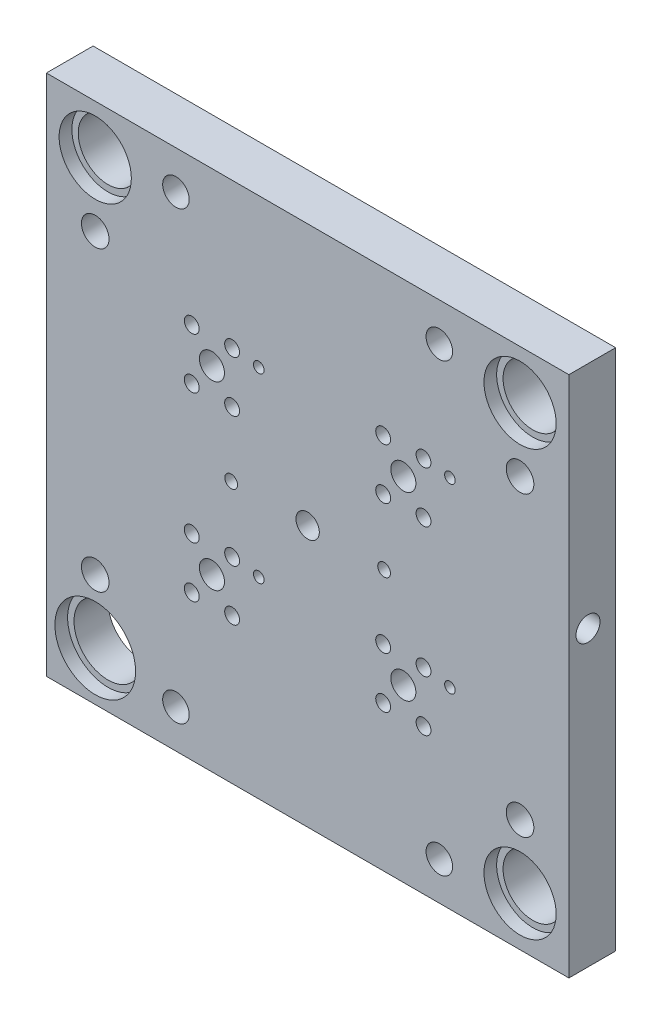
ISO-10303-21;
HEADER;
FILE_DESCRIPTION(('STEP AP214'),'2;1');
FILE_NAME('part.step','',(''),(''),'','','');
FILE_SCHEMA(('AUTOMOTIVE_DESIGN { 1 0 10303 214 1 1 1 1 }'));
ENDSEC;
DATA;
#1=APPLICATION_CONTEXT('core data for automotive mechanical design processes');
#2=APPLICATION_PROTOCOL_DEFINITION('international standard','automotive_design',2000,#1);
#3=PRODUCT_CONTEXT('',#1,'mechanical');
#4=PRODUCT('Part','Part','',(#3));
#5=PRODUCT_RELATED_PRODUCT_CATEGORY('part','',(#4));
#6=PRODUCT_DEFINITION_FORMATION('','',#4);
#7=PRODUCT_DEFINITION_CONTEXT('part definition',#1,'design');
#8=PRODUCT_DEFINITION('design','',#6,#7);
#9=PRODUCT_DEFINITION_SHAPE('','',#8);
#10=(LENGTH_UNIT() NAMED_UNIT(*) SI_UNIT(.MILLI.,.METRE.));
#11=(NAMED_UNIT(*) PLANE_ANGLE_UNIT() SI_UNIT($,.RADIAN.));
#12=(NAMED_UNIT(*) SI_UNIT($,.STERADIAN.) SOLID_ANGLE_UNIT());
#13=UNCERTAINTY_MEASURE_WITH_UNIT(LENGTH_MEASURE(1.E-05),#10,'distance_accuracy_value','');
#14=(GEOMETRIC_REPRESENTATION_CONTEXT(3) GLOBAL_UNCERTAINTY_ASSIGNED_CONTEXT((#13)) GLOBAL_UNIT_ASSIGNED_CONTEXT((#10,
#11,#12)) REPRESENTATION_CONTEXT('',''));
#15=CARTESIAN_POINT('',(0.,0.,0.));
#16=DIRECTION('',(0.,0.,1.));
#17=DIRECTION('',(1.,0.,0.));
#18=AXIS2_PLACEMENT_3D('',#15,#16,#17);
#19=CARTESIAN_POINT('',(123.,15.,13.));
#20=DIRECTION('',(-1.,0.,0.));
#21=DIRECTION('',(0.,-1.,0.));
#22=AXIS2_PLACEMENT_3D('',#19,#20,#21);
#23=CYLINDRICAL_SURFACE('',#22,4.);
#24=CARTESIAN_POINT('',(108.,15.,13.));
#25=DIRECTION('',(1.,0.,0.));
#26=DIRECTION('',(0.,1.,0.));
#27=AXIS2_PLACEMENT_3D('',#24,#25,#26);
#28=CIRCLE('',#27,4.);
#29=CARTESIAN_POINT('',(108.,19.,13.));
#30=VERTEX_POINT('',#29);
#31=EDGE_CURVE('E414',#30,#30,#28,.F.);
#32=ORIENTED_EDGE('',*,*,#31,.F.);
#33=EDGE_LOOP('',(#32));
#34=FACE_BOUND('',#33,.T.);
#35=CARTESIAN_POINT('',(-108.,15.,13.));
#36=DIRECTION('',(-1.,0.,0.));
#37=DIRECTION('',(0.,-1.,0.));
#38=AXIS2_PLACEMENT_3D('',#35,#36,#37);
#39=CIRCLE('',#38,4.);
#40=CARTESIAN_POINT('',(-108.,11.,13.));
#41=VERTEX_POINT('',#40);
#42=EDGE_CURVE('E408',#41,#41,#39,.F.);
#43=ORIENTED_EDGE('',*,*,#42,.F.);
#44=EDGE_LOOP('',(#43));
#45=FACE_BOUND('',#44,.T.);
#46=ADVANCED_FACE('F32',(#34,#45),#23,.F.);
#47=CARTESIAN_POINT('',(100.,-100.,0.));
#48=DIRECTION('',(0.,0.,1.));
#49=DIRECTION('',(1.,0.,0.));
#50=AXIS2_PLACEMENT_3D('',#47,#48,#49);
#51=CYLINDRICAL_SURFACE('',#50,14.);
#52=CARTESIAN_POINT('',(100.,-100.,0.));
#53=DIRECTION('',(0.,0.,1.));
#54=DIRECTION('',(1.,0.,0.));
#55=AXIS2_PLACEMENT_3D('',#52,#53,#54);
#56=CIRCLE('',#55,14.);
#57=CARTESIAN_POINT('',(114.,-100.,0.));
#58=VERTEX_POINT('',#57);
#59=EDGE_CURVE('E637',#58,#58,#56,.T.);
#60=ORIENTED_EDGE('',*,*,#59,.F.);
#61=EDGE_LOOP('',(#60));
#62=FACE_BOUND('',#61,.T.);
#63=CARTESIAN_POINT('',(100.,-100.,16.));
#64=DIRECTION('',(0.,0.,1.));
#65=DIRECTION('',(1.,0.,0.));
#66=AXIS2_PLACEMENT_3D('',#63,#64,#65);
#67=CIRCLE('',#66,14.);
#68=CARTESIAN_POINT('',(114.,-100.,16.));
#69=VERTEX_POINT('',#68);
#70=EDGE_CURVE('E584',#69,#69,#67,.F.);
#71=ORIENTED_EDGE('',*,*,#70,.F.);
#72=EDGE_LOOP('',(#71));
#73=FACE_BOUND('',#72,.T.);
#74=ADVANCED_FACE('F893',(#62,#73),#51,.F.);
#75=CARTESIAN_POINT('',(100.,100.,0.));
#76=DIRECTION('',(0.,0.,1.));
#77=DIRECTION('',(1.,0.,0.));
#78=AXIS2_PLACEMENT_3D('',#75,#76,#77);
#79=CYLINDRICAL_SURFACE('',#78,14.);
#80=CARTESIAN_POINT('',(100.,100.,0.));
#81=DIRECTION('',(0.,0.,1.));
#82=DIRECTION('',(1.,0.,0.));
#83=AXIS2_PLACEMENT_3D('',#80,#81,#82);
#84=CIRCLE('',#83,14.);
#85=CARTESIAN_POINT('',(114.,100.,0.));
#86=VERTEX_POINT('',#85);
#87=EDGE_CURVE('E601',#86,#86,#84,.T.);
#88=ORIENTED_EDGE('',*,*,#87,.F.);
#89=EDGE_LOOP('',(#88));
#90=FACE_BOUND('',#89,.T.);
#91=CARTESIAN_POINT('',(100.,100.,16.));
#92=DIRECTION('',(0.,0.,1.));
#93=DIRECTION('',(1.,0.,0.));
#94=AXIS2_PLACEMENT_3D('',#91,#92,#93);
#95=CIRCLE('',#94,14.);
#96=CARTESIAN_POINT('',(114.,100.,16.));
#97=VERTEX_POINT('',#96);
#98=EDGE_CURVE('E590',#97,#97,#95,.F.);
#99=ORIENTED_EDGE('',*,*,#98,.F.);
#100=EDGE_LOOP('',(#99));
#101=FACE_BOUND('',#100,.T.);
#102=ADVANCED_FACE('F899',(#90,#101),#79,.F.);
#103=CARTESIAN_POINT('',(-100.,100.,0.));
#104=DIRECTION('',(0.,0.,1.));
#105=DIRECTION('',(1.,0.,0.));
#106=AXIS2_PLACEMENT_3D('',#103,#104,#105);
#107=CYLINDRICAL_SURFACE('',#106,14.);
#108=CARTESIAN_POINT('',(-100.,100.,0.));
#109=DIRECTION('',(0.,0.,1.));
#110=DIRECTION('',(1.,0.,0.));
#111=AXIS2_PLACEMENT_3D('',#108,#109,#110);
#112=CIRCLE('',#111,14.);
#113=CARTESIAN_POINT('',(-86.,100.,0.));
#114=VERTEX_POINT('',#113);
#115=EDGE_CURVE('E604',#114,#114,#112,.T.);
#116=ORIENTED_EDGE('',*,*,#115,.F.);
#117=EDGE_LOOP('',(#116));
#118=FACE_BOUND('',#117,.T.);
#119=CARTESIAN_POINT('',(-100.,100.,16.));
#120=DIRECTION('',(0.,0.,1.));
#121=DIRECTION('',(1.,0.,0.));
#122=AXIS2_PLACEMENT_3D('',#119,#120,#121);
#123=CIRCLE('',#122,14.);
#124=CARTESIAN_POINT('',(-86.,100.,16.));
#125=VERTEX_POINT('',#124);
#126=EDGE_CURVE('E597',#125,#125,#123,.F.);
#127=ORIENTED_EDGE('',*,*,#126,.F.);
#128=EDGE_LOOP('',(#127));
#129=FACE_BOUND('',#128,.T.);
#130=ADVANCED_FACE('F1051',(#118,#129),#107,.F.);
#131=CARTESIAN_POINT('',(123.,123.,22.));
#132=DIRECTION('',(-1.,0.,0.));
#133=DIRECTION('',(0.,-1.,0.));
#134=AXIS2_PLACEMENT_3D('',#131,#132,#133);
#135=PLANE('',#134);
#136=CARTESIAN_POINT('',(123.,15.,13.));
#137=DIRECTION('',(1.,0.,0.));
#138=DIRECTION('',(0.,1.,0.));
#139=AXIS2_PLACEMENT_3D('',#136,#137,#138);
#140=CIRCLE('',#139,5.65);
#141=CARTESIAN_POINT('',(123.,20.65,13.));
#142=VERTEX_POINT('',#141);
#143=EDGE_CURVE('E415',#142,#142,#140,.T.);
#144=ORIENTED_EDGE('',*,*,#143,.F.);
#145=EDGE_LOOP('',(#144));
#146=FACE_BOUND('',#145,.T.);
#147=DIRECTION('',(0.,1.,0.));
#148=VECTOR('',#147,1.);
#149=CARTESIAN_POINT('',(123.,123.,0.));
#150=LINE('',#149,#148);
#151=CARTESIAN_POINT('',(123.,-123.,0.));
#152=VERTEX_POINT('',#151);
#153=CARTESIAN_POINT('',(123.,123.,0.));
#154=VERTEX_POINT('',#153);
#155=EDGE_CURVE('E607',#152,#154,#150,.T.);
#156=ORIENTED_EDGE('',*,*,#155,.T.);
#157=DIRECTION('',(0.,0.,-1.));
#158=VECTOR('',#157,1.);
#159=CARTESIAN_POINT('',(123.,123.,22.));
#160=LINE('',#159,#158);
#161=CARTESIAN_POINT('',(123.,123.,22.));
#162=VERTEX_POINT('',#161);
#163=EDGE_CURVE('E634',#162,#154,#160,.T.);
#164=ORIENTED_EDGE('',*,*,#163,.F.);
#165=DIRECTION('',(0.,1.,0.));
#166=VECTOR('',#165,1.);
#167=CARTESIAN_POINT('',(123.,123.,22.));
#168=LINE('',#167,#166);
#169=CARTESIAN_POINT('',(123.,-123.,22.));
#170=VERTEX_POINT('',#169);
#171=EDGE_CURVE('E608',#170,#162,#168,.T.);
#172=ORIENTED_EDGE('',*,*,#171,.F.);
#173=DIRECTION('',(0.,0.,-1.));
#174=VECTOR('',#173,1.);
#175=CARTESIAN_POINT('',(123.,-123.,22.));
#176=LINE('',#175,#174);
#177=EDGE_CURVE('E618',#170,#152,#176,.T.);
#178=ORIENTED_EDGE('',*,*,#177,.T.);
#179=EDGE_LOOP('',(#156,#164,#172,#178));
#180=FACE_BOUND('',#179,.T.);
#181=ADVANCED_FACE('F1055',(#146,#180),#135,.F.);
#182=CARTESIAN_POINT('',(-123.,123.,22.));
#183=DIRECTION('',(0.,-1.,0.));
#184=DIRECTION('',(0.,0.,-1.));
#185=AXIS2_PLACEMENT_3D('',#182,#183,#184);
#186=PLANE('',#185);
#187=DIRECTION('',(-1.,0.,0.));
#188=VECTOR('',#187,1.);
#189=CARTESIAN_POINT('',(-123.,123.,0.));
#190=LINE('',#189,#188);
#191=CARTESIAN_POINT('',(-123.,123.,0.));
#192=VERTEX_POINT('',#191);
#193=EDGE_CURVE('E621',#154,#192,#190,.T.);
#194=ORIENTED_EDGE('',*,*,#193,.T.);
#195=DIRECTION('',(0.,0.,-1.));
#196=VECTOR('',#195,1.);
#197=CARTESIAN_POINT('',(-123.,123.,22.));
#198=LINE('',#197,#196);
#199=CARTESIAN_POINT('',(-123.,123.,22.));
#200=VERTEX_POINT('',#199);
#201=EDGE_CURVE('E631',#200,#192,#198,.T.);
#202=ORIENTED_EDGE('',*,*,#201,.F.);
#203=DIRECTION('',(-1.,0.,0.));
#204=VECTOR('',#203,1.);
#205=CARTESIAN_POINT('',(-123.,123.,22.));
#206=LINE('',#205,#204);
#207=EDGE_CURVE('E611',#162,#200,#206,.T.);
#208=ORIENTED_EDGE('',*,*,#207,.F.);
#209=ORIENTED_EDGE('',*,*,#163,.T.);
#210=EDGE_LOOP('',(#194,#202,#208,#209));
#211=FACE_BOUND('',#210,.T.);
#212=ADVANCED_FACE('F1071',(#211),#186,.F.);
#213=CARTESIAN_POINT('',(-123.,123.,22.));
#214=DIRECTION('',(1.,0.,0.));
#215=DIRECTION('',(0.,1.,0.));
#216=AXIS2_PLACEMENT_3D('',#213,#214,#215);
#217=PLANE('',#216);
#218=CARTESIAN_POINT('',(-123.,15.,13.));
#219=DIRECTION('',(-1.,0.,0.));
#220=DIRECTION('',(0.,-1.,0.));
#221=AXIS2_PLACEMENT_3D('',#218,#219,#220);
#222=CIRCLE('',#221,5.65);
#223=CARTESIAN_POINT('',(-123.,9.35000000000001,13.));
#224=VERTEX_POINT('',#223);
#225=EDGE_CURVE('E401',#224,#224,#222,.T.);
#226=ORIENTED_EDGE('',*,*,#225,.F.);
#227=EDGE_LOOP('',(#226));
#228=FACE_BOUND('',#227,.T.);
#229=DIRECTION('',(0.,-1.,0.));
#230=VECTOR('',#229,1.);
#231=CARTESIAN_POINT('',(-123.,123.,0.));
#232=LINE('',#231,#230);
#233=CARTESIAN_POINT('',(-123.,-123.,0.));
#234=VERTEX_POINT('',#233);
#235=EDGE_CURVE('E623',#192,#234,#232,.T.);
#236=ORIENTED_EDGE('',*,*,#235,.T.);
#237=DIRECTION('',(0.,0.,-1.));
#238=VECTOR('',#237,1.);
#239=CARTESIAN_POINT('',(-123.,-123.,22.));
#240=LINE('',#239,#238);
#241=CARTESIAN_POINT('',(-123.,-123.,22.));
#242=VERTEX_POINT('',#241);
#243=EDGE_CURVE('E628',#242,#234,#240,.T.);
#244=ORIENTED_EDGE('',*,*,#243,.F.);
#245=DIRECTION('',(0.,-1.,0.));
#246=VECTOR('',#245,1.);
#247=CARTESIAN_POINT('',(-123.,123.,22.));
#248=LINE('',#247,#246);
#249=EDGE_CURVE('E614',#200,#242,#248,.T.);
#250=ORIENTED_EDGE('',*,*,#249,.F.);
#251=ORIENTED_EDGE('',*,*,#201,.T.);
#252=EDGE_LOOP('',(#236,#244,#250,#251));
#253=FACE_BOUND('',#252,.T.);
#254=ADVANCED_FACE('F1067',(#228,#253),#217,.F.);
#255=CARTESIAN_POINT('',(-123.,-123.,22.));
#256=DIRECTION('',(0.,1.,0.));
#257=DIRECTION('',(0.,0.,1.));
#258=AXIS2_PLACEMENT_3D('',#255,#256,#257);
#259=PLANE('',#258);
#260=DIRECTION('',(1.,0.,0.));
#261=VECTOR('',#260,1.);
#262=CARTESIAN_POINT('',(-123.,-123.,0.));
#263=LINE('',#262,#261);
#264=EDGE_CURVE('E612',#234,#152,#263,.T.);
#265=ORIENTED_EDGE('',*,*,#264,.T.);
#266=ORIENTED_EDGE('',*,*,#177,.F.);
#267=DIRECTION('',(1.,0.,0.));
#268=VECTOR('',#267,1.);
#269=CARTESIAN_POINT('',(-123.,-123.,22.));
#270=LINE('',#269,#268);
#271=EDGE_CURVE('E616',#242,#170,#270,.T.);
#272=ORIENTED_EDGE('',*,*,#271,.F.);
#273=ORIENTED_EDGE('',*,*,#243,.T.);
#274=EDGE_LOOP('',(#265,#266,#272,#273));
#275=FACE_BOUND('',#274,.T.);
#276=ADVANCED_FACE('F1060',(#275),#259,.F.);
#277=CARTESIAN_POINT('',(123.,-123.,22.));
#278=DIRECTION('',(0.,0.,1.));
#279=DIRECTION('',(1.,0.,0.));
#280=AXIS2_PLACEMENT_3D('',#277,#278,#279);
#281=PLANE('',#280);
#282=CARTESIAN_POINT('',(-23.,-32.5,22.));
#283=DIRECTION('',(0.,0.,-1.));
#284=DIRECTION('',(-1.,0.,0.));
#285=AXIS2_PLACEMENT_3D('',#282,#283,#284);
#286=CIRCLE('',#285,2.5);
#287=CARTESIAN_POINT('',(-25.5,-32.5,22.));
#288=VERTEX_POINT('',#287);
#289=EDGE_CURVE('E2293',#288,#288,#286,.T.);
#290=ORIENTED_EDGE('',*,*,#289,.T.);
#291=EDGE_LOOP('',(#290));
#292=FACE_BOUND('',#291,.T.);
#293=CARTESIAN_POINT('',(67.,-32.5,22.));
#294=DIRECTION('',(0.,0.,-1.));
#295=DIRECTION('',(-1.,0.,0.));
#296=AXIS2_PLACEMENT_3D('',#293,#294,#295);
#297=CIRCLE('',#296,2.5);
#298=CARTESIAN_POINT('',(64.5,-32.5,22.));
#299=VERTEX_POINT('',#298);
#300=EDGE_CURVE('E2287',#299,#299,#297,.T.);
#301=ORIENTED_EDGE('',*,*,#300,.T.);
#302=EDGE_LOOP('',(#301));
#303=FACE_BOUND('',#302,.T.);
#304=CARTESIAN_POINT('',(-23.,53.,22.));
#305=DIRECTION('',(0.,0.,-1.));
#306=DIRECTION('',(-1.,0.,0.));
#307=AXIS2_PLACEMENT_3D('',#304,#305,#306);
#308=CIRCLE('',#307,2.5);
#309=CARTESIAN_POINT('',(-25.5,53.,22.));
#310=VERTEX_POINT('',#309);
#311=EDGE_CURVE('E2282',#310,#310,#308,.T.);
#312=ORIENTED_EDGE('',*,*,#311,.T.);
#313=EDGE_LOOP('',(#312));
#314=FACE_BOUND('',#313,.T.);
#315=CARTESIAN_POINT('',(67.,53.,22.));
#316=DIRECTION('',(0.,0.,-1.));
#317=DIRECTION('',(-1.,0.,0.));
#318=AXIS2_PLACEMENT_3D('',#315,#316,#317);
#319=CIRCLE('',#318,2.5);
#320=CARTESIAN_POINT('',(64.5,53.,22.));
#321=VERTEX_POINT('',#320);
#322=EDGE_CURVE('E2275',#321,#321,#319,.T.);
#323=ORIENTED_EDGE('',*,*,#322,.T.);
#324=EDGE_LOOP('',(#323));
#325=FACE_BOUND('',#324,.T.);
#326=CARTESIAN_POINT('',(-100.,-100.,22.));
#327=DIRECTION('',(0.,0.,1.));
#328=DIRECTION('',(1.,0.,0.));
#329=AXIS2_PLACEMENT_3D('',#326,#327,#328);
#330=CIRCLE('',#329,19.);
#331=CARTESIAN_POINT('',(-81.,-100.,22.));
#332=VERTEX_POINT('',#331);
#333=EDGE_CURVE('E402',#332,#332,#330,.T.);
#334=ORIENTED_EDGE('',*,*,#333,.F.);
#335=EDGE_LOOP('',(#334));
#336=FACE_BOUND('',#335,.T.);
#337=CARTESIAN_POINT('',(45.06,-42.56,22.));
#338=DIRECTION('',(0.,0.,-1.));
#339=DIRECTION('',(-1.,0.,0.));
#340=AXIS2_PLACEMENT_3D('',#337,#338,#339);
#341=CIRCLE('',#340,5.9);
#342=CARTESIAN_POINT('',(39.16,-42.56,22.));
#343=VERTEX_POINT('',#342);
#344=EDGE_CURVE('E418',#343,#343,#341,.T.);
#345=ORIENTED_EDGE('',*,*,#344,.T.);
#346=EDGE_LOOP('',(#345));
#347=FACE_BOUND('',#346,.T.);
#348=CARTESIAN_POINT('',(-45.06,-42.56,22.));
#349=DIRECTION('',(0.,0.,-1.));
#350=DIRECTION('',(-1.,0.,0.));
#351=AXIS2_PLACEMENT_3D('',#348,#349,#350);
#352=CIRCLE('',#351,5.9);
#353=CARTESIAN_POINT('',(-50.96,-42.56,22.));
#354=VERTEX_POINT('',#353);
#355=EDGE_CURVE('E425',#354,#354,#352,.T.);
#356=ORIENTED_EDGE('',*,*,#355,.T.);
#357=EDGE_LOOP('',(#356));
#358=FACE_BOUND('',#357,.T.);
#359=CARTESIAN_POINT('',(-45.06,42.56,22.));
#360=DIRECTION('',(0.,0.,-1.));
#361=DIRECTION('',(-1.,0.,0.));
#362=AXIS2_PLACEMENT_3D('',#359,#360,#361);
#363=CIRCLE('',#362,5.9);
#364=CARTESIAN_POINT('',(-50.96,42.56,22.));
#365=VERTEX_POINT('',#364);
#366=EDGE_CURVE('E431',#365,#365,#363,.T.);
#367=ORIENTED_EDGE('',*,*,#366,.T.);
#368=EDGE_LOOP('',(#367));
#369=FACE_BOUND('',#368,.T.);
#370=CARTESIAN_POINT('',(45.06,42.56,22.));
#371=DIRECTION('',(0.,0.,-1.));
#372=DIRECTION('',(-1.,0.,0.));
#373=AXIS2_PLACEMENT_3D('',#370,#371,#372);
#374=CIRCLE('',#373,5.9);
#375=CARTESIAN_POINT('',(39.16,42.56,22.));
#376=VERTEX_POINT('',#375);
#377=EDGE_CURVE('E437',#376,#376,#374,.T.);
#378=ORIENTED_EDGE('',*,*,#377,.T.);
#379=EDGE_LOOP('',(#378));
#380=FACE_BOUND('',#379,.T.);
#381=CARTESIAN_POINT('',(-62.,105.,22.));
#382=DIRECTION('',(0.,0.,-1.));
#383=DIRECTION('',(-1.,0.,0.));
#384=AXIS2_PLACEMENT_3D('',#381,#382,#383);
#385=CIRCLE('',#384,6.25000000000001);
#386=CARTESIAN_POINT('',(-68.25,105.,22.));
#387=VERTEX_POINT('',#386);
#388=EDGE_CURVE('E440',#387,#387,#385,.T.);
#389=ORIENTED_EDGE('',*,*,#388,.T.);
#390=EDGE_LOOP('',(#389));
#391=FACE_BOUND('',#390,.T.);
#392=CARTESIAN_POINT('',(62.,105.,22.));
#393=DIRECTION('',(0.,0.,-1.));
#394=DIRECTION('',(-1.,0.,0.));
#395=AXIS2_PLACEMENT_3D('',#392,#393,#394);
#396=CIRCLE('',#395,6.25000000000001);
#397=CARTESIAN_POINT('',(55.75,105.,22.));
#398=VERTEX_POINT('',#397);
#399=EDGE_CURVE('E449',#398,#398,#396,.T.);
#400=ORIENTED_EDGE('',*,*,#399,.T.);
#401=EDGE_LOOP('',(#400));
#402=FACE_BOUND('',#401,.T.);
#403=CARTESIAN_POINT('',(100.,70.,22.));
#404=DIRECTION('',(0.,0.,1.));
#405=DIRECTION('',(1.,0.,0.));
#406=AXIS2_PLACEMENT_3D('',#403,#404,#405);
#407=CIRCLE('',#406,6.5);
#408=CARTESIAN_POINT('',(106.5,70.,22.));
#409=VERTEX_POINT('',#408);
#410=EDGE_CURVE('E457',#409,#409,#407,.T.);
#411=ORIENTED_EDGE('',*,*,#410,.F.);
#412=EDGE_LOOP('',(#411));
#413=FACE_BOUND('',#412,.T.);
#414=CARTESIAN_POINT('',(-100.,70.,22.));
#415=DIRECTION('',(0.,0.,1.));
#416=DIRECTION('',(1.,0.,0.));
#417=AXIS2_PLACEMENT_3D('',#414,#415,#416);
#418=CIRCLE('',#417,6.5);
#419=CARTESIAN_POINT('',(-93.5,70.,22.));
#420=VERTEX_POINT('',#419);
#421=EDGE_CURVE('E460',#420,#420,#418,.T.);
#422=ORIENTED_EDGE('',*,*,#421,.F.);
#423=EDGE_LOOP('',(#422));
#424=FACE_BOUND('',#423,.T.);
#425=CARTESIAN_POINT('',(36.,0.,22.));
#426=DIRECTION('',(0.,0.,1.));
#427=DIRECTION('',(1.,0.,0.));
#428=AXIS2_PLACEMENT_3D('',#425,#426,#427);
#429=CIRCLE('',#428,3.);
#430=CARTESIAN_POINT('',(39.,0.,22.));
#431=VERTEX_POINT('',#430);
#432=EDGE_CURVE('E464',#431,#431,#429,.T.);
#433=ORIENTED_EDGE('',*,*,#432,.F.);
#434=EDGE_LOOP('',(#433));
#435=FACE_BOUND('',#434,.T.);
#436=CARTESIAN_POINT('',(-36.,0.,22.));
#437=DIRECTION('',(0.,0.,1.));
#438=DIRECTION('',(1.,0.,0.));
#439=AXIS2_PLACEMENT_3D('',#436,#437,#438);
#440=CIRCLE('',#439,3.);
#441=CARTESIAN_POINT('',(-33.,0.,22.));
#442=VERTEX_POINT('',#441);
#443=EDGE_CURVE('E470',#442,#442,#440,.T.);
#444=ORIENTED_EDGE('',*,*,#443,.F.);
#445=EDGE_LOOP('',(#444));
#446=FACE_BOUND('',#445,.T.);
#447=CARTESIAN_POINT('',(0.,0.,22.));
#448=DIRECTION('',(0.,0.,-1.));
#449=DIRECTION('',(-1.,0.,0.));
#450=AXIS2_PLACEMENT_3D('',#447,#448,#449);
#451=CIRCLE('',#450,5.5);
#452=CARTESIAN_POINT('',(-5.5,0.,22.));
#453=VERTEX_POINT('',#452);
#454=EDGE_CURVE('E479',#453,#453,#451,.T.);
#455=ORIENTED_EDGE('',*,*,#454,.T.);
#456=EDGE_LOOP('',(#455));
#457=FACE_BOUND('',#456,.T.);
#458=CARTESIAN_POINT('',(35.56,54.56,22.));
#459=DIRECTION('',(0.,0.,1.));
#460=DIRECTION('',(1.,0.,0.));
#461=AXIS2_PLACEMENT_3D('',#458,#459,#460);
#462=CIRCLE('',#461,3.5);
#463=CARTESIAN_POINT('',(39.06,54.56,22.));
#464=VERTEX_POINT('',#463);
#465=EDGE_CURVE('E482',#464,#464,#462,.T.);
#466=ORIENTED_EDGE('',*,*,#465,.F.);
#467=EDGE_LOOP('',(#466));
#468=FACE_BOUND('',#467,.T.);
#469=CARTESIAN_POINT('',(35.56,30.56,22.));
#470=DIRECTION('',(0.,0.,1.));
#471=DIRECTION('',(1.,0.,0.));
#472=AXIS2_PLACEMENT_3D('',#469,#470,#471);
#473=CIRCLE('',#472,3.49999999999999);
#474=CARTESIAN_POINT('',(39.06,30.56,22.));
#475=VERTEX_POINT('',#474);
#476=EDGE_CURVE('E488',#475,#475,#473,.T.);
#477=ORIENTED_EDGE('',*,*,#476,.F.);
#478=EDGE_LOOP('',(#477));
#479=FACE_BOUND('',#478,.T.);
#480=CARTESIAN_POINT('',(35.56,-54.56,22.));
#481=DIRECTION('',(0.,0.,1.));
#482=DIRECTION('',(1.,0.,0.));
#483=AXIS2_PLACEMENT_3D('',#480,#481,#482);
#484=CIRCLE('',#483,3.5);
#485=CARTESIAN_POINT('',(39.06,-54.56,22.));
#486=VERTEX_POINT('',#485);
#487=EDGE_CURVE('E494',#486,#486,#484,.T.);
#488=ORIENTED_EDGE('',*,*,#487,.F.);
#489=EDGE_LOOP('',(#488));
#490=FACE_BOUND('',#489,.T.);
#491=CARTESIAN_POINT('',(35.56,-30.56,22.));
#492=DIRECTION('',(0.,0.,1.));
#493=DIRECTION('',(1.,0.,0.));
#494=AXIS2_PLACEMENT_3D('',#491,#492,#493);
#495=CIRCLE('',#494,3.5);
#496=CARTESIAN_POINT('',(39.06,-30.56,22.));
#497=VERTEX_POINT('',#496);
#498=EDGE_CURVE('E500',#497,#497,#495,.T.);
#499=ORIENTED_EDGE('',*,*,#498,.F.);
#500=EDGE_LOOP('',(#499));
#501=FACE_BOUND('',#500,.T.);
#502=CARTESIAN_POINT('',(-35.56,-54.56,22.));
#503=DIRECTION('',(0.,0.,1.));
#504=DIRECTION('',(1.,0.,0.));
#505=AXIS2_PLACEMENT_3D('',#502,#503,#504);
#506=CIRCLE('',#505,3.5);
#507=CARTESIAN_POINT('',(-32.06,-54.56,22.));
#508=VERTEX_POINT('',#507);
#509=EDGE_CURVE('E506',#508,#508,#506,.T.);
#510=ORIENTED_EDGE('',*,*,#509,.F.);
#511=EDGE_LOOP('',(#510));
#512=FACE_BOUND('',#511,.T.);
#513=CARTESIAN_POINT('',(-35.56,-30.56,22.));
#514=DIRECTION('',(0.,0.,1.));
#515=DIRECTION('',(1.,0.,0.));
#516=AXIS2_PLACEMENT_3D('',#513,#514,#515);
#517=CIRCLE('',#516,3.5);
#518=CARTESIAN_POINT('',(-32.06,-30.56,22.));
#519=VERTEX_POINT('',#518);
#520=EDGE_CURVE('E512',#519,#519,#517,.T.);
#521=ORIENTED_EDGE('',*,*,#520,.F.);
#522=EDGE_LOOP('',(#521));
#523=FACE_BOUND('',#522,.T.);
#524=CARTESIAN_POINT('',(-35.56,30.56,22.));
#525=DIRECTION('',(0.,0.,1.));
#526=DIRECTION('',(1.,0.,0.));
#527=AXIS2_PLACEMENT_3D('',#524,#525,#526);
#528=CIRCLE('',#527,3.5);
#529=CARTESIAN_POINT('',(-32.06,30.56,22.));
#530=VERTEX_POINT('',#529);
#531=EDGE_CURVE('E518',#530,#530,#528,.T.);
#532=ORIENTED_EDGE('',*,*,#531,.F.);
#533=EDGE_LOOP('',(#532));
#534=FACE_BOUND('',#533,.T.);
#535=CARTESIAN_POINT('',(-35.56,54.56,22.));
#536=DIRECTION('',(0.,0.,1.));
#537=DIRECTION('',(1.,0.,0.));
#538=AXIS2_PLACEMENT_3D('',#535,#536,#537);
#539=CIRCLE('',#538,3.5);
#540=CARTESIAN_POINT('',(-32.06,54.56,22.));
#541=VERTEX_POINT('',#540);
#542=EDGE_CURVE('E524',#541,#541,#539,.T.);
#543=ORIENTED_EDGE('',*,*,#542,.F.);
#544=EDGE_LOOP('',(#543));
#545=FACE_BOUND('',#544,.T.);
#546=CARTESIAN_POINT('',(54.56,-54.56,22.));
#547=DIRECTION('',(0.,0.,1.));
#548=DIRECTION('',(1.,0.,0.));
#549=AXIS2_PLACEMENT_3D('',#546,#547,#548);
#550=CIRCLE('',#549,3.5);
#551=CARTESIAN_POINT('',(58.06,-54.56,22.));
#552=VERTEX_POINT('',#551);
#553=EDGE_CURVE('E530',#552,#552,#550,.T.);
#554=ORIENTED_EDGE('',*,*,#553,.F.);
#555=EDGE_LOOP('',(#554));
#556=FACE_BOUND('',#555,.T.);
#557=CARTESIAN_POINT('',(54.56,-30.56,22.));
#558=DIRECTION('',(0.,0.,1.));
#559=DIRECTION('',(1.,0.,0.));
#560=AXIS2_PLACEMENT_3D('',#557,#558,#559);
#561=CIRCLE('',#560,3.5);
#562=CARTESIAN_POINT('',(58.06,-30.56,22.));
#563=VERTEX_POINT('',#562);
#564=EDGE_CURVE('E536',#563,#563,#561,.T.);
#565=ORIENTED_EDGE('',*,*,#564,.F.);
#566=EDGE_LOOP('',(#565));
#567=FACE_BOUND('',#566,.T.);
#568=CARTESIAN_POINT('',(54.56,30.56,22.));
#569=DIRECTION('',(0.,0.,1.));
#570=DIRECTION('',(1.,0.,0.));
#571=AXIS2_PLACEMENT_3D('',#568,#569,#570);
#572=CIRCLE('',#571,3.5);
#573=CARTESIAN_POINT('',(58.06,30.56,22.));
#574=VERTEX_POINT('',#573);
#575=EDGE_CURVE('E542',#574,#574,#572,.T.);
#576=ORIENTED_EDGE('',*,*,#575,.F.);
#577=EDGE_LOOP('',(#576));
#578=FACE_BOUND('',#577,.T.);
#579=CARTESIAN_POINT('',(54.56,54.56,22.));
#580=DIRECTION('',(0.,0.,1.));
#581=DIRECTION('',(1.,0.,0.));
#582=AXIS2_PLACEMENT_3D('',#579,#580,#581);
#583=CIRCLE('',#582,3.5);
#584=CARTESIAN_POINT('',(58.06,54.56,22.));
#585=VERTEX_POINT('',#584);
#586=EDGE_CURVE('E548',#585,#585,#583,.T.);
#587=ORIENTED_EDGE('',*,*,#586,.F.);
#588=EDGE_LOOP('',(#587));
#589=FACE_BOUND('',#588,.T.);
#590=CARTESIAN_POINT('',(-54.56,-54.56,22.));
#591=DIRECTION('',(0.,0.,1.));
#592=DIRECTION('',(1.,0.,0.));
#593=AXIS2_PLACEMENT_3D('',#590,#591,#592);
#594=CIRCLE('',#593,3.5);
#595=CARTESIAN_POINT('',(-51.06,-54.56,22.));
#596=VERTEX_POINT('',#595);
#597=EDGE_CURVE('E554',#596,#596,#594,.T.);
#598=ORIENTED_EDGE('',*,*,#597,.F.);
#599=EDGE_LOOP('',(#598));
#600=FACE_BOUND('',#599,.T.);
#601=CARTESIAN_POINT('',(-54.56,-30.56,22.));
#602=DIRECTION('',(0.,0.,1.));
#603=DIRECTION('',(1.,0.,0.));
#604=AXIS2_PLACEMENT_3D('',#601,#602,#603);
#605=CIRCLE('',#604,3.5);
#606=CARTESIAN_POINT('',(-51.06,-30.56,22.));
#607=VERTEX_POINT('',#606);
#608=EDGE_CURVE('E560',#607,#607,#605,.T.);
#609=ORIENTED_EDGE('',*,*,#608,.F.);
#610=EDGE_LOOP('',(#609));
#611=FACE_BOUND('',#610,.T.);
#612=CARTESIAN_POINT('',(-54.56,30.56,22.));
#613=DIRECTION('',(0.,0.,1.));
#614=DIRECTION('',(1.,0.,0.));
#615=AXIS2_PLACEMENT_3D('',#612,#613,#614);
#616=CIRCLE('',#615,3.5);
#617=CARTESIAN_POINT('',(-51.06,30.56,22.));
#618=VERTEX_POINT('',#617);
#619=EDGE_CURVE('E566',#618,#618,#616,.T.);
#620=ORIENTED_EDGE('',*,*,#619,.F.);
#621=EDGE_LOOP('',(#620));
#622=FACE_BOUND('',#621,.T.);
#623=CARTESIAN_POINT('',(-54.56,54.56,22.));
#624=DIRECTION('',(0.,0.,1.));
#625=DIRECTION('',(1.,0.,0.));
#626=AXIS2_PLACEMENT_3D('',#623,#624,#625);
#627=CIRCLE('',#626,3.5);
#628=CARTESIAN_POINT('',(-51.06,54.56,22.));
#629=VERTEX_POINT('',#628);
#630=EDGE_CURVE('E572',#629,#629,#627,.T.);
#631=ORIENTED_EDGE('',*,*,#630,.F.);
#632=EDGE_LOOP('',(#631));
#633=FACE_BOUND('',#632,.T.);
#634=CARTESIAN_POINT('',(100.,-100.,22.));
#635=DIRECTION('',(0.,0.,1.));
#636=DIRECTION('',(1.,0.,0.));
#637=AXIS2_PLACEMENT_3D('',#634,#635,#636);
#638=CIRCLE('',#637,17.);
#639=CARTESIAN_POINT('',(117.,-100.,22.));
#640=VERTEX_POINT('',#639);
#641=EDGE_CURVE('E578',#640,#640,#638,.T.);
#642=ORIENTED_EDGE('',*,*,#641,.F.);
#643=EDGE_LOOP('',(#642));
#644=FACE_BOUND('',#643,.T.);
#645=CARTESIAN_POINT('',(100.,100.,22.));
#646=DIRECTION('',(0.,0.,1.));
#647=DIRECTION('',(1.,0.,0.));
#648=AXIS2_PLACEMENT_3D('',#645,#646,#647);
#649=CIRCLE('',#648,17.);
#650=CARTESIAN_POINT('',(117.,100.,22.));
#651=VERTEX_POINT('',#650);
#652=EDGE_CURVE('E591',#651,#651,#649,.T.);
#653=ORIENTED_EDGE('',*,*,#652,.F.);
#654=EDGE_LOOP('',(#653));
#655=FACE_BOUND('',#654,.T.);
#656=CARTESIAN_POINT('',(-100.,100.,22.));
#657=DIRECTION('',(0.,0.,1.));
#658=DIRECTION('',(1.,0.,0.));
#659=AXIS2_PLACEMENT_3D('',#656,#657,#658);
#660=CIRCLE('',#659,17.);
#661=CARTESIAN_POINT('',(-83.,100.,22.));
#662=VERTEX_POINT('',#661);
#663=EDGE_CURVE('E598',#662,#662,#660,.T.);
#664=ORIENTED_EDGE('',*,*,#663,.F.);
#665=EDGE_LOOP('',(#664));
#666=FACE_BOUND('',#665,.T.);
#667=ORIENTED_EDGE('',*,*,#171,.T.);
#668=ORIENTED_EDGE('',*,*,#207,.T.);
#669=ORIENTED_EDGE('',*,*,#249,.T.);
#670=ORIENTED_EDGE('',*,*,#271,.T.);
#671=EDGE_LOOP('',(#667,#668,#669,#670));
#672=FACE_BOUND('',#671,.T.);
#673=CARTESIAN_POINT('',(-100.,-70.,22.));
#674=DIRECTION('',(0.,0.,1.));
#675=DIRECTION('',(1.,0.,0.));
#676=AXIS2_PLACEMENT_3D('',#673,#674,#675);
#677=CIRCLE('',#676,6.5);
#678=CARTESIAN_POINT('',(-93.5,-70.,22.));
#679=VERTEX_POINT('',#678);
#680=EDGE_CURVE('E649',#679,#679,#677,.T.);
#681=ORIENTED_EDGE('',*,*,#680,.F.);
#682=EDGE_LOOP('',(#681));
#683=FACE_BOUND('',#682,.T.);
#684=CARTESIAN_POINT('',(100.,-70.,22.));
#685=DIRECTION('',(0.,0.,1.));
#686=DIRECTION('',(1.,0.,0.));
#687=AXIS2_PLACEMENT_3D('',#684,#685,#686);
#688=CIRCLE('',#687,6.5);
#689=CARTESIAN_POINT('',(106.5,-70.,22.));
#690=VERTEX_POINT('',#689);
#691=EDGE_CURVE('E655',#690,#690,#688,.T.);
#692=ORIENTED_EDGE('',*,*,#691,.F.);
#693=EDGE_LOOP('',(#692));
#694=FACE_BOUND('',#693,.T.);
#695=CARTESIAN_POINT('',(62.,-105.,22.));
#696=DIRECTION('',(0.,0.,-1.));
#697=DIRECTION('',(-1.,0.,0.));
#698=AXIS2_PLACEMENT_3D('',#695,#696,#697);
#699=CIRCLE('',#698,6.25000000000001);
#700=CARTESIAN_POINT('',(55.75,-105.,22.));
#701=VERTEX_POINT('',#700);
#702=EDGE_CURVE('E658',#701,#701,#699,.T.);
#703=ORIENTED_EDGE('',*,*,#702,.T.);
#704=EDGE_LOOP('',(#703));
#705=FACE_BOUND('',#704,.T.);
#706=CARTESIAN_POINT('',(-62.,-105.,22.));
#707=DIRECTION('',(0.,0.,-1.));
#708=DIRECTION('',(-1.,0.,0.));
#709=AXIS2_PLACEMENT_3D('',#706,#707,#708);
#710=CIRCLE('',#709,6.25000000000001);
#711=CARTESIAN_POINT('',(-68.25,-105.,22.));
#712=VERTEX_POINT('',#711);
#713=EDGE_CURVE('E664',#712,#712,#710,.T.);
#714=ORIENTED_EDGE('',*,*,#713,.T.);
#715=EDGE_LOOP('',(#714));
#716=FACE_BOUND('',#715,.T.);
#717=ADVANCED_FACE('F1057',(#292,#303,#314,#325,#336,#347,#358,#369,#380,#391,#402,#413,#424,
#435,#446,#457,#468,#479,#490,#501,#512,#523,#534,#545,#556,#567,#578,#589,#600,#611,#622,#633,
#644,#655,#666,#672,#683,#694,#705,#716),#281,.T.);
#718=CARTESIAN_POINT('',(123.,-123.,0.));
#719=DIRECTION('',(0.,0.,1.));
#720=DIRECTION('',(1.,0.,0.));
#721=AXIS2_PLACEMENT_3D('',#718,#719,#720);
#722=PLANE('',#721);
#723=DIRECTION('',(-1.,0.,0.));
#724=VECTOR('',#723,1.);
#725=CARTESIAN_POINT('',(74.5,-50.5,0.));
#726=LINE('',#725,#724);
#727=CARTESIAN_POINT('',(71.5,-50.5,0.));
#728=VERTEX_POINT('',#727);
#729=CARTESIAN_POINT('',(62.5,-50.5,0.));
#730=VERTEX_POINT('',#729);
#731=EDGE_CURVE('E339',#728,#730,#726,.T.);
#732=ORIENTED_EDGE('',*,*,#731,.F.);
#733=CARTESIAN_POINT('',(71.5,-47.5,0.));
#734=DIRECTION('',(0.,0.,1.));
#735=DIRECTION('',(1.,0.,0.));
#736=AXIS2_PLACEMENT_3D('',#733,#734,#735);
#737=CIRCLE('',#736,3.);
#738=CARTESIAN_POINT('',(74.5,-47.5,0.));
#739=VERTEX_POINT('',#738);
#740=EDGE_CURVE('E345',#728,#739,#737,.T.);
#741=ORIENTED_EDGE('',*,*,#740,.T.);
#742=DIRECTION('',(0.,-1.,0.));
#743=VECTOR('',#742,1.);
#744=CARTESIAN_POINT('',(74.5,-50.5,0.));
#745=LINE('',#744,#743);
#746=CARTESIAN_POINT('',(74.5,-11.5,0.));
#747=VERTEX_POINT('',#746);
#748=EDGE_CURVE('E348',#747,#739,#745,.T.);
#749=ORIENTED_EDGE('',*,*,#748,.F.);
#750=CARTESIAN_POINT('',(71.5,-11.5,0.));
#751=DIRECTION('',(0.,0.,1.));
#752=DIRECTION('',(1.,0.,0.));
#753=AXIS2_PLACEMENT_3D('',#750,#751,#752);
#754=CIRCLE('',#753,3.);
#755=CARTESIAN_POINT('',(71.5,-8.5,0.));
#756=VERTEX_POINT('',#755);
#757=EDGE_CURVE('E299',#747,#756,#754,.T.);
#758=ORIENTED_EDGE('',*,*,#757,.T.);
#759=DIRECTION('',(1.,0.,0.));
#760=VECTOR('',#759,1.);
#761=CARTESIAN_POINT('',(74.5,-8.49999999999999,0.));
#762=LINE('',#761,#760);
#763=CARTESIAN_POINT('',(62.5,-8.49999999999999,0.));
#764=VERTEX_POINT('',#763);
#765=EDGE_CURVE('E308',#764,#756,#762,.T.);
#766=ORIENTED_EDGE('',*,*,#765,.F.);
#767=CARTESIAN_POINT('',(62.5,-11.5,0.));
#768=DIRECTION('',(0.,0.,1.));
#769=DIRECTION('',(1.,0.,0.));
#770=AXIS2_PLACEMENT_3D('',#767,#768,#769);
#771=CIRCLE('',#770,3.);
#772=CARTESIAN_POINT('',(59.5,-11.5,0.));
#773=VERTEX_POINT('',#772);
#774=EDGE_CURVE('E316',#764,#773,#771,.T.);
#775=ORIENTED_EDGE('',*,*,#774,.T.);
#776=DIRECTION('',(0.,1.,0.));
#777=VECTOR('',#776,1.);
#778=CARTESIAN_POINT('',(59.5,-50.5,0.));
#779=LINE('',#778,#777);
#780=CARTESIAN_POINT('',(59.5,-47.5,0.));
#781=VERTEX_POINT('',#780);
#782=EDGE_CURVE('E328',#781,#773,#779,.T.);
#783=ORIENTED_EDGE('',*,*,#782,.F.);
#784=CARTESIAN_POINT('',(62.5,-47.5,0.));
#785=DIRECTION('',(0.,0.,1.));
#786=DIRECTION('',(1.,0.,0.));
#787=AXIS2_PLACEMENT_3D('',#784,#785,#786);
#788=CIRCLE('',#787,3.);
#789=EDGE_CURVE('E334',#781,#730,#788,.T.);
#790=ORIENTED_EDGE('',*,*,#789,.T.);
#791=EDGE_LOOP('',(#732,#741,#749,#758,#766,#775,#783,#790));
#792=FACE_BOUND('',#791,.T.);
#793=DIRECTION('',(-1.,0.,0.));
#794=VECTOR('',#793,1.);
#795=CARTESIAN_POINT('',(74.5,35.,0.));
#796=LINE('',#795,#794);
#797=CARTESIAN_POINT('',(71.5,35.,0.));
#798=VERTEX_POINT('',#797);
#799=CARTESIAN_POINT('',(62.5,35.,0.));
#800=VERTEX_POINT('',#799);
#801=EDGE_CURVE('E387',#798,#800,#796,.T.);
#802=ORIENTED_EDGE('',*,*,#801,.F.);
#803=CARTESIAN_POINT('',(71.5,38.,0.));
#804=DIRECTION('',(0.,0.,1.));
#805=DIRECTION('',(1.,0.,0.));
#806=AXIS2_PLACEMENT_3D('',#803,#804,#805);
#807=CIRCLE('',#806,3.);
#808=CARTESIAN_POINT('',(74.5,38.,0.));
#809=VERTEX_POINT('',#808);
#810=EDGE_CURVE('E704',#798,#809,#807,.T.);
#811=ORIENTED_EDGE('',*,*,#810,.T.);
#812=DIRECTION('',(0.,-1.,0.));
#813=VECTOR('',#812,1.);
#814=CARTESIAN_POINT('',(74.5,35.,0.));
#815=LINE('',#814,#813);
#816=CARTESIAN_POINT('',(74.5,74.,0.));
#817=VERTEX_POINT('',#816);
#818=EDGE_CURVE('E370',#817,#809,#815,.T.);
#819=ORIENTED_EDGE('',*,*,#818,.F.);
#820=CARTESIAN_POINT('',(71.5,74.,0.));
#821=DIRECTION('',(0.,0.,1.));
#822=DIRECTION('',(1.,0.,0.));
#823=AXIS2_PLACEMENT_3D('',#820,#821,#822);
#824=CIRCLE('',#823,3.);
#825=CARTESIAN_POINT('',(71.5,77.,0.));
#826=VERTEX_POINT('',#825);
#827=EDGE_CURVE('E710',#817,#826,#824,.T.);
#828=ORIENTED_EDGE('',*,*,#827,.T.);
#829=DIRECTION('',(1.,0.,0.));
#830=VECTOR('',#829,1.);
#831=CARTESIAN_POINT('',(74.5,77.,0.));
#832=LINE('',#831,#830);
#833=CARTESIAN_POINT('',(62.5,77.,0.));
#834=VERTEX_POINT('',#833);
#835=EDGE_CURVE('E375',#834,#826,#832,.T.);
#836=ORIENTED_EDGE('',*,*,#835,.F.);
#837=CARTESIAN_POINT('',(62.5,74.,0.));
#838=DIRECTION('',(0.,0.,1.));
#839=DIRECTION('',(1.,0.,0.));
#840=AXIS2_PLACEMENT_3D('',#837,#838,#839);
#841=CIRCLE('',#840,3.);
#842=CARTESIAN_POINT('',(59.5,74.,0.));
#843=VERTEX_POINT('',#842);
#844=EDGE_CURVE('E708',#834,#843,#841,.T.);
#845=ORIENTED_EDGE('',*,*,#844,.T.);
#846=DIRECTION('',(0.,1.,0.));
#847=VECTOR('',#846,1.);
#848=CARTESIAN_POINT('',(59.5,35.,0.));
#849=LINE('',#848,#847);
#850=CARTESIAN_POINT('',(59.5,38.,0.));
#851=VERTEX_POINT('',#850);
#852=EDGE_CURVE('E390',#851,#843,#849,.T.);
#853=ORIENTED_EDGE('',*,*,#852,.F.);
#854=CARTESIAN_POINT('',(62.5,38.,0.));
#855=DIRECTION('',(0.,0.,1.));
#856=DIRECTION('',(1.,0.,0.));
#857=AXIS2_PLACEMENT_3D('',#854,#855,#856);
#858=CIRCLE('',#857,3.);
#859=EDGE_CURVE('E706',#851,#800,#858,.T.);
#860=ORIENTED_EDGE('',*,*,#859,.T.);
#861=EDGE_LOOP('',(#802,#811,#819,#828,#836,#845,#853,#860));
#862=FACE_BOUND('',#861,.T.);
#863=CARTESIAN_POINT('',(-100.,-100.,0.));
#864=DIRECTION('',(0.,0.,1.));
#865=DIRECTION('',(1.,0.,0.));
#866=AXIS2_PLACEMENT_3D('',#863,#864,#865);
#867=CIRCLE('',#866,16.);
#868=CARTESIAN_POINT('',(-84.,-100.,0.));
#869=VERTEX_POINT('',#868);
#870=EDGE_CURVE('E384',#869,#869,#867,.T.);
#871=ORIENTED_EDGE('',*,*,#870,.T.);
#872=EDGE_LOOP('',(#871));
#873=FACE_BOUND('',#872,.T.);
#874=CARTESIAN_POINT('',(45.06,-42.56,0.));
#875=DIRECTION('',(0.,0.,-1.));
#876=DIRECTION('',(-1.,0.,0.));
#877=AXIS2_PLACEMENT_3D('',#874,#875,#876);
#878=CIRCLE('',#877,5.9);
#879=CARTESIAN_POINT('',(39.16,-42.56,0.));
#880=VERTEX_POINT('',#879);
#881=EDGE_CURVE('E422',#880,#880,#878,.T.);
#882=ORIENTED_EDGE('',*,*,#881,.F.);
#883=EDGE_LOOP('',(#882));
#884=FACE_BOUND('',#883,.T.);
#885=CARTESIAN_POINT('',(-45.06,-42.56,0.));
#886=DIRECTION('',(0.,0.,-1.));
#887=DIRECTION('',(-1.,0.,0.));
#888=AXIS2_PLACEMENT_3D('',#885,#886,#887);
#889=CIRCLE('',#888,5.9);
#890=CARTESIAN_POINT('',(-50.96,-42.56,0.));
#891=VERTEX_POINT('',#890);
#892=EDGE_CURVE('E421',#891,#891,#889,.T.);
#893=ORIENTED_EDGE('',*,*,#892,.F.);
#894=EDGE_LOOP('',(#893));
#895=FACE_BOUND('',#894,.T.);
#896=CARTESIAN_POINT('',(-45.06,42.56,0.));
#897=DIRECTION('',(0.,0.,-1.));
#898=DIRECTION('',(-1.,0.,0.));
#899=AXIS2_PLACEMENT_3D('',#896,#897,#898);
#900=CIRCLE('',#899,5.9);
#901=CARTESIAN_POINT('',(-50.96,42.56,0.));
#902=VERTEX_POINT('',#901);
#903=EDGE_CURVE('E428',#902,#902,#900,.T.);
#904=ORIENTED_EDGE('',*,*,#903,.F.);
#905=EDGE_LOOP('',(#904));
#906=FACE_BOUND('',#905,.T.);
#907=CARTESIAN_POINT('',(45.06,42.56,0.));
#908=DIRECTION('',(0.,0.,-1.));
#909=DIRECTION('',(-1.,0.,0.));
#910=AXIS2_PLACEMENT_3D('',#907,#908,#909);
#911=CIRCLE('',#910,5.9);
#912=CARTESIAN_POINT('',(39.16,42.56,0.));
#913=VERTEX_POINT('',#912);
#914=EDGE_CURVE('E434',#913,#913,#911,.T.);
#915=ORIENTED_EDGE('',*,*,#914,.F.);
#916=EDGE_LOOP('',(#915));
#917=FACE_BOUND('',#916,.T.);
#918=CARTESIAN_POINT('',(-62.,105.,0.));
#919=DIRECTION('',(0.,0.,-1.));
#920=DIRECTION('',(-1.,0.,0.));
#921=AXIS2_PLACEMENT_3D('',#918,#919,#920);
#922=CIRCLE('',#921,6.25000000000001);
#923=CARTESIAN_POINT('',(-68.25,105.,0.));
#924=VERTEX_POINT('',#923);
#925=EDGE_CURVE('E445',#924,#924,#922,.T.);
#926=ORIENTED_EDGE('',*,*,#925,.F.);
#927=EDGE_LOOP('',(#926));
#928=FACE_BOUND('',#927,.T.);
#929=CARTESIAN_POINT('',(62.,105.,0.));
#930=DIRECTION('',(0.,0.,-1.));
#931=DIRECTION('',(-1.,0.,0.));
#932=AXIS2_PLACEMENT_3D('',#929,#930,#931);
#933=CIRCLE('',#932,6.25000000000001);
#934=CARTESIAN_POINT('',(55.75,105.,0.));
#935=VERTEX_POINT('',#934);
#936=EDGE_CURVE('E448',#935,#935,#933,.T.);
#937=ORIENTED_EDGE('',*,*,#936,.F.);
#938=EDGE_LOOP('',(#937));
#939=FACE_BOUND('',#938,.T.);
#940=CARTESIAN_POINT('',(100.,70.,0.));
#941=DIRECTION('',(0.,0.,1.));
#942=DIRECTION('',(1.,0.,0.));
#943=AXIS2_PLACEMENT_3D('',#940,#941,#942);
#944=CIRCLE('',#943,6.5);
#945=CARTESIAN_POINT('',(106.5,70.,0.));
#946=VERTEX_POINT('',#945);
#947=EDGE_CURVE('E452',#946,#946,#944,.T.);
#948=ORIENTED_EDGE('',*,*,#947,.T.);
#949=EDGE_LOOP('',(#948));
#950=FACE_BOUND('',#949,.T.);
#951=CARTESIAN_POINT('',(-100.,70.,0.));
#952=DIRECTION('',(0.,0.,1.));
#953=DIRECTION('',(1.,0.,0.));
#954=AXIS2_PLACEMENT_3D('',#951,#952,#953);
#955=CIRCLE('',#954,6.5);
#956=CARTESIAN_POINT('',(-93.5,70.,0.));
#957=VERTEX_POINT('',#956);
#958=EDGE_CURVE('E461',#957,#957,#955,.T.);
#959=ORIENTED_EDGE('',*,*,#958,.T.);
#960=EDGE_LOOP('',(#959));
#961=FACE_BOUND('',#960,.T.);
#962=CARTESIAN_POINT('',(36.,0.,0.));
#963=DIRECTION('',(0.,0.,1.));
#964=DIRECTION('',(1.,0.,0.));
#965=AXIS2_PLACEMENT_3D('',#962,#963,#964);
#966=CIRCLE('',#965,3.);
#967=CARTESIAN_POINT('',(39.,0.,0.));
#968=VERTEX_POINT('',#967);
#969=EDGE_CURVE('E467',#968,#968,#966,.T.);
#970=ORIENTED_EDGE('',*,*,#969,.T.);
#971=EDGE_LOOP('',(#970));
#972=FACE_BOUND('',#971,.T.);
#973=CARTESIAN_POINT('',(-36.,0.,0.));
#974=DIRECTION('',(0.,0.,1.));
#975=DIRECTION('',(1.,0.,0.));
#976=AXIS2_PLACEMENT_3D('',#973,#974,#975);
#977=CIRCLE('',#976,3.);
#978=CARTESIAN_POINT('',(-33.,0.,0.));
#979=VERTEX_POINT('',#978);
#980=EDGE_CURVE('E473',#979,#979,#977,.T.);
#981=ORIENTED_EDGE('',*,*,#980,.T.);
#982=EDGE_LOOP('',(#981));
#983=FACE_BOUND('',#982,.T.);
#984=CARTESIAN_POINT('',(0.,0.,0.));
#985=DIRECTION('',(0.,0.,-1.));
#986=DIRECTION('',(-1.,0.,0.));
#987=AXIS2_PLACEMENT_3D('',#984,#985,#986);
#988=CIRCLE('',#987,5.5);
#989=CARTESIAN_POINT('',(-5.5,0.,0.));
#990=VERTEX_POINT('',#989);
#991=EDGE_CURVE('E476',#990,#990,#988,.T.);
#992=ORIENTED_EDGE('',*,*,#991,.F.);
#993=EDGE_LOOP('',(#992));
#994=FACE_BOUND('',#993,.T.);
#995=CARTESIAN_POINT('',(35.56,54.56,0.));
#996=DIRECTION('',(0.,0.,1.));
#997=DIRECTION('',(1.,0.,0.));
#998=AXIS2_PLACEMENT_3D('',#995,#996,#997);
#999=CIRCLE('',#998,3.5);
#1000=CARTESIAN_POINT('',(39.06,54.56,0.));
#1001=VERTEX_POINT('',#1000);
#1002=EDGE_CURVE('E485',#1001,#1001,#999,.T.);
#1003=ORIENTED_EDGE('',*,*,#1002,.T.);
#1004=EDGE_LOOP('',(#1003));
#1005=FACE_BOUND('',#1004,.T.);
#1006=CARTESIAN_POINT('',(35.56,30.56,0.));
#1007=DIRECTION('',(0.,0.,1.));
#1008=DIRECTION('',(1.,0.,0.));
#1009=AXIS2_PLACEMENT_3D('',#1006,#1007,#1008);
#1010=CIRCLE('',#1009,3.49999999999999);
#1011=CARTESIAN_POINT('',(39.06,30.56,0.));
#1012=VERTEX_POINT('',#1011);
#1013=EDGE_CURVE('E491',#1012,#1012,#1010,.T.);
#1014=ORIENTED_EDGE('',*,*,#1013,.T.);
#1015=EDGE_LOOP('',(#1014));
#1016=FACE_BOUND('',#1015,.T.);
#1017=CARTESIAN_POINT('',(35.56,-54.56,0.));
#1018=DIRECTION('',(0.,0.,1.));
#1019=DIRECTION('',(1.,0.,0.));
#1020=AXIS2_PLACEMENT_3D('',#1017,#1018,#1019);
#1021=CIRCLE('',#1020,3.5);
#1022=CARTESIAN_POINT('',(39.06,-54.56,0.));
#1023=VERTEX_POINT('',#1022);
#1024=EDGE_CURVE('E497',#1023,#1023,#1021,.T.);
#1025=ORIENTED_EDGE('',*,*,#1024,.T.);
#1026=EDGE_LOOP('',(#1025));
#1027=FACE_BOUND('',#1026,.T.);
#1028=CARTESIAN_POINT('',(35.56,-30.56,0.));
#1029=DIRECTION('',(0.,0.,1.));
#1030=DIRECTION('',(1.,0.,0.));
#1031=AXIS2_PLACEMENT_3D('',#1028,#1029,#1030);
#1032=CIRCLE('',#1031,3.5);
#1033=CARTESIAN_POINT('',(39.06,-30.56,0.));
#1034=VERTEX_POINT('',#1033);
#1035=EDGE_CURVE('E503',#1034,#1034,#1032,.T.);
#1036=ORIENTED_EDGE('',*,*,#1035,.T.);
#1037=EDGE_LOOP('',(#1036));
#1038=FACE_BOUND('',#1037,.T.);
#1039=CARTESIAN_POINT('',(-35.56,-54.56,0.));
#1040=DIRECTION('',(0.,0.,1.));
#1041=DIRECTION('',(1.,0.,0.));
#1042=AXIS2_PLACEMENT_3D('',#1039,#1040,#1041);
#1043=CIRCLE('',#1042,3.5);
#1044=CARTESIAN_POINT('',(-32.06,-54.56,0.));
#1045=VERTEX_POINT('',#1044);
#1046=EDGE_CURVE('E509',#1045,#1045,#1043,.T.);
#1047=ORIENTED_EDGE('',*,*,#1046,.T.);
#1048=EDGE_LOOP('',(#1047));
#1049=FACE_BOUND('',#1048,.T.);
#1050=CARTESIAN_POINT('',(-35.56,-30.56,0.));
#1051=DIRECTION('',(0.,0.,1.));
#1052=DIRECTION('',(1.,0.,0.));
#1053=AXIS2_PLACEMENT_3D('',#1050,#1051,#1052);
#1054=CIRCLE('',#1053,3.5);
#1055=CARTESIAN_POINT('',(-32.06,-30.56,0.));
#1056=VERTEX_POINT('',#1055);
#1057=EDGE_CURVE('E515',#1056,#1056,#1054,.T.);
#1058=ORIENTED_EDGE('',*,*,#1057,.T.);
#1059=EDGE_LOOP('',(#1058));
#1060=FACE_BOUND('',#1059,.T.);
#1061=CARTESIAN_POINT('',(-35.56,30.56,0.));
#1062=DIRECTION('',(0.,0.,1.));
#1063=DIRECTION('',(1.,0.,0.));
#1064=AXIS2_PLACEMENT_3D('',#1061,#1062,#1063);
#1065=CIRCLE('',#1064,3.5);
#1066=CARTESIAN_POINT('',(-32.06,30.56,0.));
#1067=VERTEX_POINT('',#1066);
#1068=EDGE_CURVE('E521',#1067,#1067,#1065,.T.);
#1069=ORIENTED_EDGE('',*,*,#1068,.T.);
#1070=EDGE_LOOP('',(#1069));
#1071=FACE_BOUND('',#1070,.T.);
#1072=CARTESIAN_POINT('',(-35.56,54.56,0.));
#1073=DIRECTION('',(0.,0.,1.));
#1074=DIRECTION('',(1.,0.,0.));
#1075=AXIS2_PLACEMENT_3D('',#1072,#1073,#1074);
#1076=CIRCLE('',#1075,3.5);
#1077=CARTESIAN_POINT('',(-32.06,54.56,0.));
#1078=VERTEX_POINT('',#1077);
#1079=EDGE_CURVE('E527',#1078,#1078,#1076,.T.);
#1080=ORIENTED_EDGE('',*,*,#1079,.T.);
#1081=EDGE_LOOP('',(#1080));
#1082=FACE_BOUND('',#1081,.T.);
#1083=CARTESIAN_POINT('',(54.56,-54.56,0.));
#1084=DIRECTION('',(0.,0.,1.));
#1085=DIRECTION('',(1.,0.,0.));
#1086=AXIS2_PLACEMENT_3D('',#1083,#1084,#1085);
#1087=CIRCLE('',#1086,3.5);
#1088=CARTESIAN_POINT('',(58.06,-54.56,0.));
#1089=VERTEX_POINT('',#1088);
#1090=EDGE_CURVE('E533',#1089,#1089,#1087,.T.);
#1091=ORIENTED_EDGE('',*,*,#1090,.T.);
#1092=EDGE_LOOP('',(#1091));
#1093=FACE_BOUND('',#1092,.T.);
#1094=CARTESIAN_POINT('',(54.56,-30.56,0.));
#1095=DIRECTION('',(0.,0.,1.));
#1096=DIRECTION('',(1.,0.,0.));
#1097=AXIS2_PLACEMENT_3D('',#1094,#1095,#1096);
#1098=CIRCLE('',#1097,3.5);
#1099=CARTESIAN_POINT('',(58.06,-30.56,0.));
#1100=VERTEX_POINT('',#1099);
#1101=EDGE_CURVE('E539',#1100,#1100,#1098,.T.);
#1102=ORIENTED_EDGE('',*,*,#1101,.T.);
#1103=EDGE_LOOP('',(#1102));
#1104=FACE_BOUND('',#1103,.T.);
#1105=CARTESIAN_POINT('',(54.56,30.56,0.));
#1106=DIRECTION('',(0.,0.,1.));
#1107=DIRECTION('',(1.,0.,0.));
#1108=AXIS2_PLACEMENT_3D('',#1105,#1106,#1107);
#1109=CIRCLE('',#1108,3.5);
#1110=CARTESIAN_POINT('',(58.06,30.56,0.));
#1111=VERTEX_POINT('',#1110);
#1112=EDGE_CURVE('E545',#1111,#1111,#1109,.T.);
#1113=ORIENTED_EDGE('',*,*,#1112,.T.);
#1114=EDGE_LOOP('',(#1113));
#1115=FACE_BOUND('',#1114,.T.);
#1116=CARTESIAN_POINT('',(54.56,54.56,0.));
#1117=DIRECTION('',(0.,0.,1.));
#1118=DIRECTION('',(1.,0.,0.));
#1119=AXIS2_PLACEMENT_3D('',#1116,#1117,#1118);
#1120=CIRCLE('',#1119,3.5);
#1121=CARTESIAN_POINT('',(58.06,54.56,0.));
#1122=VERTEX_POINT('',#1121);
#1123=EDGE_CURVE('E551',#1122,#1122,#1120,.T.);
#1124=ORIENTED_EDGE('',*,*,#1123,.T.);
#1125=EDGE_LOOP('',(#1124));
#1126=FACE_BOUND('',#1125,.T.);
#1127=CARTESIAN_POINT('',(-54.56,-54.56,0.));
#1128=DIRECTION('',(0.,0.,1.));
#1129=DIRECTION('',(1.,0.,0.));
#1130=AXIS2_PLACEMENT_3D('',#1127,#1128,#1129);
#1131=CIRCLE('',#1130,3.5);
#1132=CARTESIAN_POINT('',(-51.06,-54.56,0.));
#1133=VERTEX_POINT('',#1132);
#1134=EDGE_CURVE('E557',#1133,#1133,#1131,.T.);
#1135=ORIENTED_EDGE('',*,*,#1134,.T.);
#1136=EDGE_LOOP('',(#1135));
#1137=FACE_BOUND('',#1136,.T.);
#1138=CARTESIAN_POINT('',(-54.56,-30.56,0.));
#1139=DIRECTION('',(0.,0.,1.));
#1140=DIRECTION('',(1.,0.,0.));
#1141=AXIS2_PLACEMENT_3D('',#1138,#1139,#1140);
#1142=CIRCLE('',#1141,3.5);
#1143=CARTESIAN_POINT('',(-51.06,-30.56,0.));
#1144=VERTEX_POINT('',#1143);
#1145=EDGE_CURVE('E563',#1144,#1144,#1142,.T.);
#1146=ORIENTED_EDGE('',*,*,#1145,.T.);
#1147=EDGE_LOOP('',(#1146));
#1148=FACE_BOUND('',#1147,.T.);
#1149=CARTESIAN_POINT('',(-54.56,30.56,0.));
#1150=DIRECTION('',(0.,0.,1.));
#1151=DIRECTION('',(1.,0.,0.));
#1152=AXIS2_PLACEMENT_3D('',#1149,#1150,#1151);
#1153=CIRCLE('',#1152,3.5);
#1154=CARTESIAN_POINT('',(-51.06,30.56,0.));
#1155=VERTEX_POINT('',#1154);
#1156=EDGE_CURVE('E569',#1155,#1155,#1153,.T.);
#1157=ORIENTED_EDGE('',*,*,#1156,.T.);
#1158=EDGE_LOOP('',(#1157));
#1159=FACE_BOUND('',#1158,.T.);
#1160=CARTESIAN_POINT('',(-54.56,54.56,0.));
#1161=DIRECTION('',(0.,0.,1.));
#1162=DIRECTION('',(1.,0.,0.));
#1163=AXIS2_PLACEMENT_3D('',#1160,#1161,#1162);
#1164=CIRCLE('',#1163,3.5);
#1165=CARTESIAN_POINT('',(-51.06,54.56,0.));
#1166=VERTEX_POINT('',#1165);
#1167=EDGE_CURVE('E575',#1166,#1166,#1164,.T.);
#1168=ORIENTED_EDGE('',*,*,#1167,.T.);
#1169=EDGE_LOOP('',(#1168));
#1170=FACE_BOUND('',#1169,.T.);
#1171=ORIENTED_EDGE('',*,*,#87,.T.);
#1172=EDGE_LOOP('',(#1171));
#1173=FACE_BOUND('',#1172,.T.);
#1174=ORIENTED_EDGE('',*,*,#115,.T.);
#1175=EDGE_LOOP('',(#1174));
#1176=FACE_BOUND('',#1175,.T.);
#1177=ORIENTED_EDGE('',*,*,#155,.F.);
#1178=ORIENTED_EDGE('',*,*,#264,.F.);
#1179=ORIENTED_EDGE('',*,*,#235,.F.);
#1180=ORIENTED_EDGE('',*,*,#193,.F.);
#1181=EDGE_LOOP('',(#1177,#1178,#1179,#1180));
#1182=FACE_BOUND('',#1181,.T.);
#1183=ORIENTED_EDGE('',*,*,#59,.T.);
#1184=EDGE_LOOP('',(#1183));
#1185=FACE_BOUND('',#1184,.T.);
#1186=CARTESIAN_POINT('',(-100.,-70.,0.));
#1187=DIRECTION('',(0.,0.,1.));
#1188=DIRECTION('',(1.,0.,0.));
#1189=AXIS2_PLACEMENT_3D('',#1186,#1187,#1188);
#1190=CIRCLE('',#1189,6.5);
#1191=CARTESIAN_POINT('',(-93.5,-70.,0.));
#1192=VERTEX_POINT('',#1191);
#1193=EDGE_CURVE('E640',#1192,#1192,#1190,.T.);
#1194=ORIENTED_EDGE('',*,*,#1193,.T.);
#1195=EDGE_LOOP('',(#1194));
#1196=FACE_BOUND('',#1195,.T.);
#1197=CARTESIAN_POINT('',(100.,-70.,0.));
#1198=DIRECTION('',(0.,0.,1.));
#1199=DIRECTION('',(1.,0.,0.));
#1200=AXIS2_PLACEMENT_3D('',#1197,#1198,#1199);
#1201=CIRCLE('',#1200,6.5);
#1202=CARTESIAN_POINT('',(106.5,-70.,0.));
#1203=VERTEX_POINT('',#1202);
#1204=EDGE_CURVE('E652',#1203,#1203,#1201,.T.);
#1205=ORIENTED_EDGE('',*,*,#1204,.T.);
#1206=EDGE_LOOP('',(#1205));
#1207=FACE_BOUND('',#1206,.T.);
#1208=CARTESIAN_POINT('',(62.,-105.,0.));
#1209=DIRECTION('',(0.,0.,-1.));
#1210=DIRECTION('',(-1.,0.,0.));
#1211=AXIS2_PLACEMENT_3D('',#1208,#1209,#1210);
#1212=CIRCLE('',#1211,6.25000000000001);
#1213=CARTESIAN_POINT('',(55.75,-105.,0.));
#1214=VERTEX_POINT('',#1213);
#1215=EDGE_CURVE('E661',#1214,#1214,#1212,.T.);
#1216=ORIENTED_EDGE('',*,*,#1215,.F.);
#1217=EDGE_LOOP('',(#1216));
#1218=FACE_BOUND('',#1217,.T.);
#1219=CARTESIAN_POINT('',(-62.,-105.,0.));
#1220=DIRECTION('',(0.,0.,-1.));
#1221=DIRECTION('',(-1.,0.,0.));
#1222=AXIS2_PLACEMENT_3D('',#1219,#1220,#1221);
#1223=CIRCLE('',#1222,6.25000000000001);
#1224=CARTESIAN_POINT('',(-68.25,-105.,0.));
#1225=VERTEX_POINT('',#1224);
#1226=EDGE_CURVE('E667',#1225,#1225,#1223,.T.);
#1227=ORIENTED_EDGE('',*,*,#1226,.F.);
#1228=EDGE_LOOP('',(#1227));
#1229=FACE_BOUND('',#1228,.T.);
#1230=DIRECTION('',(1.,0.,0.));
#1231=VECTOR('',#1230,1.);
#1232=CARTESIAN_POINT('',(-15.5,77.,0.));
#1233=LINE('',#1232,#1231);
#1234=CARTESIAN_POINT('',(-27.5,77.,0.));
#1235=VERTEX_POINT('',#1234);
#1236=CARTESIAN_POINT('',(-18.5,77.,0.));
#1237=VERTEX_POINT('',#1236);
#1238=EDGE_CURVE('E712',#1235,#1237,#1233,.T.);
#1239=ORIENTED_EDGE('',*,*,#1238,.F.);
#1240=CARTESIAN_POINT('',(-27.5,74.,0.));
#1241=DIRECTION('',(0.,0.,1.));
#1242=DIRECTION('',(1.,0.,0.));
#1243=AXIS2_PLACEMENT_3D('',#1240,#1241,#1242);
#1244=CIRCLE('',#1243,3.);
#1245=CARTESIAN_POINT('',(-30.5,74.,0.));
#1246=VERTEX_POINT('',#1245);
#1247=EDGE_CURVE('E714',#1235,#1246,#1244,.T.);
#1248=ORIENTED_EDGE('',*,*,#1247,.T.);
#1249=DIRECTION('',(0.,1.,0.));
#1250=VECTOR('',#1249,1.);
#1251=CARTESIAN_POINT('',(-30.5,35.,0.));
#1252=LINE('',#1251,#1250);
#1253=CARTESIAN_POINT('',(-30.5,38.,0.));
#1254=VERTEX_POINT('',#1253);
#1255=EDGE_CURVE('E716',#1254,#1246,#1252,.T.);
#1256=ORIENTED_EDGE('',*,*,#1255,.F.);
#1257=CARTESIAN_POINT('',(-27.5,38.,0.));
#1258=DIRECTION('',(0.,0.,1.));
#1259=DIRECTION('',(1.,0.,0.));
#1260=AXIS2_PLACEMENT_3D('',#1257,#1258,#1259);
#1261=CIRCLE('',#1260,3.);
#1262=CARTESIAN_POINT('',(-27.5,35.,0.));
#1263=VERTEX_POINT('',#1262);
#1264=EDGE_CURVE('E719',#1254,#1263,#1261,.T.);
#1265=ORIENTED_EDGE('',*,*,#1264,.T.);
#1266=DIRECTION('',(-1.,0.,0.));
#1267=VECTOR('',#1266,1.);
#1268=CARTESIAN_POINT('',(-15.5,35.,0.));
#1269=LINE('',#1268,#1267);
#1270=CARTESIAN_POINT('',(-18.5,35.,0.));
#1271=VERTEX_POINT('',#1270);
#1272=EDGE_CURVE('E721',#1271,#1263,#1269,.T.);
#1273=ORIENTED_EDGE('',*,*,#1272,.F.);
#1274=CARTESIAN_POINT('',(-18.5,38.,0.));
#1275=DIRECTION('',(0.,0.,1.));
#1276=DIRECTION('',(1.,0.,0.));
#1277=AXIS2_PLACEMENT_3D('',#1274,#1275,#1276);
#1278=CIRCLE('',#1277,3.);
#1279=CARTESIAN_POINT('',(-15.5,38.,0.));
#1280=VERTEX_POINT('',#1279);
#1281=EDGE_CURVE('E724',#1271,#1280,#1278,.T.);
#1282=ORIENTED_EDGE('',*,*,#1281,.T.);
#1283=DIRECTION('',(0.,-1.,0.));
#1284=VECTOR('',#1283,1.);
#1285=CARTESIAN_POINT('',(-15.5,35.,0.));
#1286=LINE('',#1285,#1284);
#1287=CARTESIAN_POINT('',(-15.5,74.,0.));
#1288=VERTEX_POINT('',#1287);
#1289=EDGE_CURVE('E726',#1288,#1280,#1286,.T.);
#1290=ORIENTED_EDGE('',*,*,#1289,.F.);
#1291=CARTESIAN_POINT('',(-18.5,74.,0.));
#1292=DIRECTION('',(0.,0.,1.));
#1293=DIRECTION('',(1.,0.,0.));
#1294=AXIS2_PLACEMENT_3D('',#1291,#1292,#1293);
#1295=CIRCLE('',#1294,3.);
#1296=EDGE_CURVE('E729',#1288,#1237,#1295,.T.);
#1297=ORIENTED_EDGE('',*,*,#1296,.T.);
#1298=EDGE_LOOP('',(#1239,#1248,#1256,#1265,#1273,#1282,#1290,#1297));
#1299=FACE_BOUND('',#1298,.T.);
#1300=DIRECTION('',(1.,0.,0.));
#1301=VECTOR('',#1300,1.);
#1302=CARTESIAN_POINT('',(-15.5,-8.49999999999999,0.));
#1303=LINE('',#1302,#1301);
#1304=CARTESIAN_POINT('',(-27.5,-8.49999999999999,0.));
#1305=VERTEX_POINT('',#1304);
#1306=CARTESIAN_POINT('',(-18.5,-8.49999999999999,0.));
#1307=VERTEX_POINT('',#1306);
#1308=EDGE_CURVE('E786',#1305,#1307,#1303,.T.);
#1309=ORIENTED_EDGE('',*,*,#1308,.F.);
#1310=CARTESIAN_POINT('',(-27.5,-11.5,0.));
#1311=DIRECTION('',(0.,0.,1.));
#1312=DIRECTION('',(1.,0.,0.));
#1313=AXIS2_PLACEMENT_3D('',#1310,#1311,#1312);
#1314=CIRCLE('',#1313,3.);
#1315=CARTESIAN_POINT('',(-30.5,-11.5,0.));
#1316=VERTEX_POINT('',#1315);
#1317=EDGE_CURVE('E788',#1305,#1316,#1314,.T.);
#1318=ORIENTED_EDGE('',*,*,#1317,.T.);
#1319=DIRECTION('',(0.,1.,0.));
#1320=VECTOR('',#1319,1.);
#1321=CARTESIAN_POINT('',(-30.5,-50.5,0.));
#1322=LINE('',#1321,#1320);
#1323=CARTESIAN_POINT('',(-30.5,-47.5,0.));
#1324=VERTEX_POINT('',#1323);
#1325=EDGE_CURVE('E790',#1324,#1316,#1322,.T.);
#1326=ORIENTED_EDGE('',*,*,#1325,.F.);
#1327=CARTESIAN_POINT('',(-27.5,-47.5,0.));
#1328=DIRECTION('',(0.,0.,1.));
#1329=DIRECTION('',(1.,0.,0.));
#1330=AXIS2_PLACEMENT_3D('',#1327,#1328,#1329);
#1331=CIRCLE('',#1330,3.);
#1332=CARTESIAN_POINT('',(-27.5,-50.5,0.));
#1333=VERTEX_POINT('',#1332);
#1334=EDGE_CURVE('E793',#1324,#1333,#1331,.T.);
#1335=ORIENTED_EDGE('',*,*,#1334,.T.);
#1336=DIRECTION('',(-1.,0.,0.));
#1337=VECTOR('',#1336,1.);
#1338=CARTESIAN_POINT('',(-15.5,-50.5,0.));
#1339=LINE('',#1338,#1337);
#1340=CARTESIAN_POINT('',(-18.5,-50.5,0.));
#1341=VERTEX_POINT('',#1340);
#1342=EDGE_CURVE('E795',#1341,#1333,#1339,.T.);
#1343=ORIENTED_EDGE('',*,*,#1342,.F.);
#1344=CARTESIAN_POINT('',(-18.5,-47.5,0.));
#1345=DIRECTION('',(0.,0.,1.));
#1346=DIRECTION('',(1.,0.,0.));
#1347=AXIS2_PLACEMENT_3D('',#1344,#1345,#1346);
#1348=CIRCLE('',#1347,3.);
#1349=CARTESIAN_POINT('',(-15.5,-47.5,0.));
#1350=VERTEX_POINT('',#1349);
#1351=EDGE_CURVE('E798',#1341,#1350,#1348,.T.);
#1352=ORIENTED_EDGE('',*,*,#1351,.T.);
#1353=DIRECTION('',(0.,-1.,0.));
#1354=VECTOR('',#1353,1.);
#1355=CARTESIAN_POINT('',(-15.5,-50.5,0.));
#1356=LINE('',#1355,#1354);
#1357=CARTESIAN_POINT('',(-15.5,-11.5,0.));
#1358=VERTEX_POINT('',#1357);
#1359=EDGE_CURVE('E800',#1358,#1350,#1356,.T.);
#1360=ORIENTED_EDGE('',*,*,#1359,.F.);
#1361=CARTESIAN_POINT('',(-18.5,-11.5,0.));
#1362=DIRECTION('',(0.,0.,1.));
#1363=DIRECTION('',(1.,0.,0.));
#1364=AXIS2_PLACEMENT_3D('',#1361,#1362,#1363);
#1365=CIRCLE('',#1364,3.);
#1366=EDGE_CURVE('E803',#1358,#1307,#1365,.T.);
#1367=ORIENTED_EDGE('',*,*,#1366,.T.);
#1368=EDGE_LOOP('',(#1309,#1318,#1326,#1335,#1343,#1352,#1360,#1367));
#1369=FACE_BOUND('',#1368,.T.);
#1370=ADVANCED_FACE('F881',(#792,#862,#873,#884,#895,#906,#917,#928,#939,#950,#961,#972,#983,
#994,#1005,#1016,#1027,#1038,#1049,#1060,#1071,#1082,#1093,#1104,#1115,#1126,#1137,#1148,#1159,
#1170,#1173,#1176,#1182,#1185,#1196,#1207,#1218,#1229,#1299,#1369),#722,.F.);
#1371=CARTESIAN_POINT('',(-100.,100.,16.));
#1372=DIRECTION('',(0.,0.,1.));
#1373=DIRECTION('',(1.,0.,0.));
#1374=AXIS2_PLACEMENT_3D('',#1371,#1372,#1373);
#1375=PLANE('',#1374);
#1376=CARTESIAN_POINT('',(-100.,100.,16.));
#1377=DIRECTION('',(0.,0.,1.));
#1378=DIRECTION('',(1.,0.,0.));
#1379=AXIS2_PLACEMENT_3D('',#1376,#1377,#1378);
#1380=CIRCLE('',#1379,17.);
#1381=CARTESIAN_POINT('',(-83.,100.,16.));
#1382=VERTEX_POINT('',#1381);
#1383=EDGE_CURVE('E594',#1382,#1382,#1380,.T.);
#1384=ORIENTED_EDGE('',*,*,#1383,.T.);
#1385=EDGE_LOOP('',(#1384));
#1386=FACE_BOUND('',#1385,.T.);
#1387=ORIENTED_EDGE('',*,*,#126,.T.);
#1388=EDGE_LOOP('',(#1387));
#1389=FACE_BOUND('',#1388,.T.);
#1390=ADVANCED_FACE('F1042',(#1386,#1389),#1375,.T.);
#1391=CARTESIAN_POINT('',(-100.,100.,16.));
#1392=DIRECTION('',(0.,0.,1.));
#1393=DIRECTION('',(1.,0.,0.));
#1394=AXIS2_PLACEMENT_3D('',#1391,#1392,#1393);
#1395=CYLINDRICAL_SURFACE('',#1394,17.);
#1396=ORIENTED_EDGE('',*,*,#1383,.F.);
#1397=EDGE_LOOP('',(#1396));
#1398=FACE_BOUND('',#1397,.T.);
#1399=ORIENTED_EDGE('',*,*,#663,.T.);
#1400=EDGE_LOOP('',(#1399));
#1401=FACE_BOUND('',#1400,.T.);
#1402=ADVANCED_FACE('F1040',(#1398,#1401),#1395,.F.);
#1403=CARTESIAN_POINT('',(-100.,-100.,16.));
#1404=DIRECTION('',(0.,0.,1.));
#1405=DIRECTION('',(1.,0.,0.));
#1406=AXIS2_PLACEMENT_3D('',#1403,#1404,#1405);
#1407=PLANE('',#1406);
#1408=CARTESIAN_POINT('',(-100.,-100.,16.));
#1409=DIRECTION('',(0.,0.,1.));
#1410=DIRECTION('',(1.,0.,0.));
#1411=AXIS2_PLACEMENT_3D('',#1408,#1409,#1410);
#1412=CIRCLE('',#1411,16.);
#1413=CARTESIAN_POINT('',(-84.,-100.,16.));
#1414=VERTEX_POINT('',#1413);
#1415=EDGE_CURVE('E397',#1414,#1414,#1412,.T.);
#1416=ORIENTED_EDGE('',*,*,#1415,.F.);
#1417=EDGE_LOOP('',(#1416));
#1418=FACE_BOUND('',#1417,.T.);
#1419=CARTESIAN_POINT('',(-100.,-100.,16.));
#1420=DIRECTION('',(0.,0.,1.));
#1421=DIRECTION('',(1.,0.,0.));
#1422=AXIS2_PLACEMENT_3D('',#1419,#1420,#1421);
#1423=CIRCLE('',#1422,19.);
#1424=CARTESIAN_POINT('',(-81.,-100.,16.));
#1425=VERTEX_POINT('',#1424);
#1426=EDGE_CURVE('E398',#1425,#1425,#1423,.T.);
#1427=ORIENTED_EDGE('',*,*,#1426,.T.);
#1428=EDGE_LOOP('',(#1427));
#1429=FACE_BOUND('',#1428,.T.);
#1430=ADVANCED_FACE('F1033',(#1418,#1429),#1407,.T.);
#1431=CARTESIAN_POINT('',(100.,100.,16.));
#1432=DIRECTION('',(0.,0.,1.));
#1433=DIRECTION('',(1.,0.,0.));
#1434=AXIS2_PLACEMENT_3D('',#1431,#1432,#1433);
#1435=PLANE('',#1434);
#1436=CARTESIAN_POINT('',(100.,100.,16.));
#1437=DIRECTION('',(0.,0.,1.));
#1438=DIRECTION('',(1.,0.,0.));
#1439=AXIS2_PLACEMENT_3D('',#1436,#1437,#1438);
#1440=CIRCLE('',#1439,17.);
#1441=CARTESIAN_POINT('',(117.,100.,16.));
#1442=VERTEX_POINT('',#1441);
#1443=EDGE_CURVE('E587',#1442,#1442,#1440,.T.);
#1444=ORIENTED_EDGE('',*,*,#1443,.T.);
#1445=EDGE_LOOP('',(#1444));
#1446=FACE_BOUND('',#1445,.T.);
#1447=ORIENTED_EDGE('',*,*,#98,.T.);
#1448=EDGE_LOOP('',(#1447));
#1449=FACE_BOUND('',#1448,.T.);
#1450=ADVANCED_FACE('F1030',(#1446,#1449),#1435,.T.);
#1451=CARTESIAN_POINT('',(100.,100.,16.));
#1452=DIRECTION('',(0.,0.,1.));
#1453=DIRECTION('',(1.,0.,0.));
#1454=AXIS2_PLACEMENT_3D('',#1451,#1452,#1453);
#1455=CYLINDRICAL_SURFACE('',#1454,17.);
#1456=ORIENTED_EDGE('',*,*,#1443,.F.);
#1457=EDGE_LOOP('',(#1456));
#1458=FACE_BOUND('',#1457,.T.);
#1459=ORIENTED_EDGE('',*,*,#652,.T.);
#1460=EDGE_LOOP('',(#1459));
#1461=FACE_BOUND('',#1460,.T.);
#1462=ADVANCED_FACE('F1025',(#1458,#1461),#1455,.F.);
#1463=CARTESIAN_POINT('',(100.,-100.,16.));
#1464=DIRECTION('',(0.,0.,1.));
#1465=DIRECTION('',(1.,0.,0.));
#1466=AXIS2_PLACEMENT_3D('',#1463,#1464,#1465);
#1467=PLANE('',#1466);
#1468=CARTESIAN_POINT('',(100.,-100.,16.));
#1469=DIRECTION('',(0.,0.,1.));
#1470=DIRECTION('',(1.,0.,0.));
#1471=AXIS2_PLACEMENT_3D('',#1468,#1469,#1470);
#1472=CIRCLE('',#1471,17.);
#1473=CARTESIAN_POINT('',(117.,-100.,16.));
#1474=VERTEX_POINT('',#1473);
#1475=EDGE_CURVE('E581',#1474,#1474,#1472,.T.);
#1476=ORIENTED_EDGE('',*,*,#1475,.T.);
#1477=EDGE_LOOP('',(#1476));
#1478=FACE_BOUND('',#1477,.T.);
#1479=ORIENTED_EDGE('',*,*,#70,.T.);
#1480=EDGE_LOOP('',(#1479));
#1481=FACE_BOUND('',#1480,.T.);
#1482=ADVANCED_FACE('F1022',(#1478,#1481),#1467,.T.);
#1483=CARTESIAN_POINT('',(100.,-100.,16.));
#1484=DIRECTION('',(0.,0.,1.));
#1485=DIRECTION('',(1.,0.,0.));
#1486=AXIS2_PLACEMENT_3D('',#1483,#1484,#1485);
#1487=CYLINDRICAL_SURFACE('',#1486,17.);
#1488=ORIENTED_EDGE('',*,*,#1475,.F.);
#1489=EDGE_LOOP('',(#1488));
#1490=FACE_BOUND('',#1489,.T.);
#1491=ORIENTED_EDGE('',*,*,#641,.T.);
#1492=EDGE_LOOP('',(#1491));
#1493=FACE_BOUND('',#1492,.T.);
#1494=ADVANCED_FACE('F1020',(#1490,#1493),#1487,.F.);
#1495=CARTESIAN_POINT('',(-54.56,54.56,0.));
#1496=DIRECTION('',(0.,0.,1.));
#1497=DIRECTION('',(1.,0.,0.));
#1498=AXIS2_PLACEMENT_3D('',#1495,#1496,#1497);
#1499=CYLINDRICAL_SURFACE('',#1498,3.5);
#1500=ORIENTED_EDGE('',*,*,#1167,.F.);
#1501=EDGE_LOOP('',(#1500));
#1502=FACE_BOUND('',#1501,.T.);
#1503=ORIENTED_EDGE('',*,*,#630,.T.);
#1504=EDGE_LOOP('',(#1503));
#1505=FACE_BOUND('',#1504,.T.);
#1506=ADVANCED_FACE('F1016',(#1502,#1505),#1499,.F.);
#1507=CARTESIAN_POINT('',(-54.56,30.56,0.));
#1508=DIRECTION('',(0.,0.,1.));
#1509=DIRECTION('',(1.,0.,0.));
#1510=AXIS2_PLACEMENT_3D('',#1507,#1508,#1509);
#1511=CYLINDRICAL_SURFACE('',#1510,3.5);
#1512=ORIENTED_EDGE('',*,*,#1156,.F.);
#1513=EDGE_LOOP('',(#1512));
#1514=FACE_BOUND('',#1513,.T.);
#1515=ORIENTED_EDGE('',*,*,#619,.T.);
#1516=EDGE_LOOP('',(#1515));
#1517=FACE_BOUND('',#1516,.T.);
#1518=ADVANCED_FACE('F1012',(#1514,#1517),#1511,.F.);
#1519=CARTESIAN_POINT('',(-54.56,-30.56,0.));
#1520=DIRECTION('',(0.,0.,1.));
#1521=DIRECTION('',(1.,0.,0.));
#1522=AXIS2_PLACEMENT_3D('',#1519,#1520,#1521);
#1523=CYLINDRICAL_SURFACE('',#1522,3.5);
#1524=ORIENTED_EDGE('',*,*,#1145,.F.);
#1525=EDGE_LOOP('',(#1524));
#1526=FACE_BOUND('',#1525,.T.);
#1527=ORIENTED_EDGE('',*,*,#608,.T.);
#1528=EDGE_LOOP('',(#1527));
#1529=FACE_BOUND('',#1528,.T.);
#1530=ADVANCED_FACE('F1008',(#1526,#1529),#1523,.F.);
#1531=CARTESIAN_POINT('',(-54.56,-54.56,0.));
#1532=DIRECTION('',(0.,0.,1.));
#1533=DIRECTION('',(1.,0.,0.));
#1534=AXIS2_PLACEMENT_3D('',#1531,#1532,#1533);
#1535=CYLINDRICAL_SURFACE('',#1534,3.5);
#1536=ORIENTED_EDGE('',*,*,#1134,.F.);
#1537=EDGE_LOOP('',(#1536));
#1538=FACE_BOUND('',#1537,.T.);
#1539=ORIENTED_EDGE('',*,*,#597,.T.);
#1540=EDGE_LOOP('',(#1539));
#1541=FACE_BOUND('',#1540,.T.);
#1542=ADVANCED_FACE('F1004',(#1538,#1541),#1535,.F.);
#1543=CARTESIAN_POINT('',(54.56,54.56,0.));
#1544=DIRECTION('',(0.,0.,1.));
#1545=DIRECTION('',(1.,0.,0.));
#1546=AXIS2_PLACEMENT_3D('',#1543,#1544,#1545);
#1547=CYLINDRICAL_SURFACE('',#1546,3.5);
#1548=ORIENTED_EDGE('',*,*,#1123,.F.);
#1549=EDGE_LOOP('',(#1548));
#1550=FACE_BOUND('',#1549,.T.);
#1551=ORIENTED_EDGE('',*,*,#586,.T.);
#1552=EDGE_LOOP('',(#1551));
#1553=FACE_BOUND('',#1552,.T.);
#1554=ADVANCED_FACE('F1000',(#1550,#1553),#1547,.F.);
#1555=CARTESIAN_POINT('',(54.56,30.56,0.));
#1556=DIRECTION('',(0.,0.,1.));
#1557=DIRECTION('',(1.,0.,0.));
#1558=AXIS2_PLACEMENT_3D('',#1555,#1556,#1557);
#1559=CYLINDRICAL_SURFACE('',#1558,3.5);
#1560=ORIENTED_EDGE('',*,*,#1112,.F.);
#1561=EDGE_LOOP('',(#1560));
#1562=FACE_BOUND('',#1561,.T.);
#1563=ORIENTED_EDGE('',*,*,#575,.T.);
#1564=EDGE_LOOP('',(#1563));
#1565=FACE_BOUND('',#1564,.T.);
#1566=ADVANCED_FACE('F996',(#1562,#1565),#1559,.F.);
#1567=CARTESIAN_POINT('',(54.56,-30.56,0.));
#1568=DIRECTION('',(0.,0.,1.));
#1569=DIRECTION('',(1.,0.,0.));
#1570=AXIS2_PLACEMENT_3D('',#1567,#1568,#1569);
#1571=CYLINDRICAL_SURFACE('',#1570,3.5);
#1572=ORIENTED_EDGE('',*,*,#1101,.F.);
#1573=EDGE_LOOP('',(#1572));
#1574=FACE_BOUND('',#1573,.T.);
#1575=ORIENTED_EDGE('',*,*,#564,.T.);
#1576=EDGE_LOOP('',(#1575));
#1577=FACE_BOUND('',#1576,.T.);
#1578=ADVANCED_FACE('F992',(#1574,#1577),#1571,.F.);
#1579=CARTESIAN_POINT('',(54.56,-54.56,0.));
#1580=DIRECTION('',(0.,0.,1.));
#1581=DIRECTION('',(1.,0.,0.));
#1582=AXIS2_PLACEMENT_3D('',#1579,#1580,#1581);
#1583=CYLINDRICAL_SURFACE('',#1582,3.5);
#1584=ORIENTED_EDGE('',*,*,#1090,.F.);
#1585=EDGE_LOOP('',(#1584));
#1586=FACE_BOUND('',#1585,.T.);
#1587=ORIENTED_EDGE('',*,*,#553,.T.);
#1588=EDGE_LOOP('',(#1587));
#1589=FACE_BOUND('',#1588,.T.);
#1590=ADVANCED_FACE('F988',(#1586,#1589),#1583,.F.);
#1591=CARTESIAN_POINT('',(-35.56,54.56,0.));
#1592=DIRECTION('',(0.,0.,1.));
#1593=DIRECTION('',(1.,0.,0.));
#1594=AXIS2_PLACEMENT_3D('',#1591,#1592,#1593);
#1595=CYLINDRICAL_SURFACE('',#1594,3.5);
#1596=ORIENTED_EDGE('',*,*,#1079,.F.);
#1597=EDGE_LOOP('',(#1596));
#1598=FACE_BOUND('',#1597,.T.);
#1599=ORIENTED_EDGE('',*,*,#542,.T.);
#1600=EDGE_LOOP('',(#1599));
#1601=FACE_BOUND('',#1600,.T.);
#1602=ADVANCED_FACE('F984',(#1598,#1601),#1595,.F.);
#1603=CARTESIAN_POINT('',(-35.56,30.56,0.));
#1604=DIRECTION('',(0.,0.,1.));
#1605=DIRECTION('',(1.,0.,0.));
#1606=AXIS2_PLACEMENT_3D('',#1603,#1604,#1605);
#1607=CYLINDRICAL_SURFACE('',#1606,3.5);
#1608=ORIENTED_EDGE('',*,*,#1068,.F.);
#1609=EDGE_LOOP('',(#1608));
#1610=FACE_BOUND('',#1609,.T.);
#1611=ORIENTED_EDGE('',*,*,#531,.T.);
#1612=EDGE_LOOP('',(#1611));
#1613=FACE_BOUND('',#1612,.T.);
#1614=ADVANCED_FACE('F980',(#1610,#1613),#1607,.F.);
#1615=CARTESIAN_POINT('',(-35.56,-30.56,0.));
#1616=DIRECTION('',(0.,0.,1.));
#1617=DIRECTION('',(1.,0.,0.));
#1618=AXIS2_PLACEMENT_3D('',#1615,#1616,#1617);
#1619=CYLINDRICAL_SURFACE('',#1618,3.5);
#1620=ORIENTED_EDGE('',*,*,#1057,.F.);
#1621=EDGE_LOOP('',(#1620));
#1622=FACE_BOUND('',#1621,.T.);
#1623=ORIENTED_EDGE('',*,*,#520,.T.);
#1624=EDGE_LOOP('',(#1623));
#1625=FACE_BOUND('',#1624,.T.);
#1626=ADVANCED_FACE('F976',(#1622,#1625),#1619,.F.);
#1627=CARTESIAN_POINT('',(-35.56,-54.56,0.));
#1628=DIRECTION('',(0.,0.,1.));
#1629=DIRECTION('',(1.,0.,0.));
#1630=AXIS2_PLACEMENT_3D('',#1627,#1628,#1629);
#1631=CYLINDRICAL_SURFACE('',#1630,3.5);
#1632=ORIENTED_EDGE('',*,*,#1046,.F.);
#1633=EDGE_LOOP('',(#1632));
#1634=FACE_BOUND('',#1633,.T.);
#1635=ORIENTED_EDGE('',*,*,#509,.T.);
#1636=EDGE_LOOP('',(#1635));
#1637=FACE_BOUND('',#1636,.T.);
#1638=ADVANCED_FACE('F972',(#1634,#1637),#1631,.F.);
#1639=CARTESIAN_POINT('',(35.56,-30.56,0.));
#1640=DIRECTION('',(0.,0.,1.));
#1641=DIRECTION('',(1.,0.,0.));
#1642=AXIS2_PLACEMENT_3D('',#1639,#1640,#1641);
#1643=CYLINDRICAL_SURFACE('',#1642,3.5);
#1644=ORIENTED_EDGE('',*,*,#1035,.F.);
#1645=EDGE_LOOP('',(#1644));
#1646=FACE_BOUND('',#1645,.T.);
#1647=ORIENTED_EDGE('',*,*,#498,.T.);
#1648=EDGE_LOOP('',(#1647));
#1649=FACE_BOUND('',#1648,.T.);
#1650=ADVANCED_FACE('F968',(#1646,#1649),#1643,.F.);
#1651=CARTESIAN_POINT('',(35.56,-54.56,0.));
#1652=DIRECTION('',(0.,0.,1.));
#1653=DIRECTION('',(1.,0.,0.));
#1654=AXIS2_PLACEMENT_3D('',#1651,#1652,#1653);
#1655=CYLINDRICAL_SURFACE('',#1654,3.5);
#1656=ORIENTED_EDGE('',*,*,#1024,.F.);
#1657=EDGE_LOOP('',(#1656));
#1658=FACE_BOUND('',#1657,.T.);
#1659=ORIENTED_EDGE('',*,*,#487,.T.);
#1660=EDGE_LOOP('',(#1659));
#1661=FACE_BOUND('',#1660,.T.);
#1662=ADVANCED_FACE('F964',(#1658,#1661),#1655,.F.);
#1663=CARTESIAN_POINT('',(35.56,30.56,0.));
#1664=DIRECTION('',(0.,0.,1.));
#1665=DIRECTION('',(1.,0.,0.));
#1666=AXIS2_PLACEMENT_3D('',#1663,#1664,#1665);
#1667=CYLINDRICAL_SURFACE('',#1666,3.49999999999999);
#1668=ORIENTED_EDGE('',*,*,#1013,.F.);
#1669=EDGE_LOOP('',(#1668));
#1670=FACE_BOUND('',#1669,.T.);
#1671=ORIENTED_EDGE('',*,*,#476,.T.);
#1672=EDGE_LOOP('',(#1671));
#1673=FACE_BOUND('',#1672,.T.);
#1674=ADVANCED_FACE('F960',(#1670,#1673),#1667,.F.);
#1675=CARTESIAN_POINT('',(35.56,54.56,0.));
#1676=DIRECTION('',(0.,0.,1.));
#1677=DIRECTION('',(1.,0.,0.));
#1678=AXIS2_PLACEMENT_3D('',#1675,#1676,#1677);
#1679=CYLINDRICAL_SURFACE('',#1678,3.5);
#1680=ORIENTED_EDGE('',*,*,#1002,.F.);
#1681=EDGE_LOOP('',(#1680));
#1682=FACE_BOUND('',#1681,.T.);
#1683=ORIENTED_EDGE('',*,*,#465,.T.);
#1684=EDGE_LOOP('',(#1683));
#1685=FACE_BOUND('',#1684,.T.);
#1686=ADVANCED_FACE('F956',(#1682,#1685),#1679,.F.);
#1687=CARTESIAN_POINT('',(0.,0.,22.));
#1688=DIRECTION('',(0.,0.,-1.));
#1689=DIRECTION('',(-1.,0.,0.));
#1690=AXIS2_PLACEMENT_3D('',#1687,#1688,#1689);
#1691=CYLINDRICAL_SURFACE('',#1690,5.5);
#1692=ORIENTED_EDGE('',*,*,#454,.F.);
#1693=EDGE_LOOP('',(#1692));
#1694=FACE_BOUND('',#1693,.T.);
#1695=ORIENTED_EDGE('',*,*,#991,.T.);
#1696=EDGE_LOOP('',(#1695));
#1697=FACE_BOUND('',#1696,.T.);
#1698=ADVANCED_FACE('F952',(#1694,#1697),#1691,.F.);
#1699=CARTESIAN_POINT('',(-36.,0.,0.));
#1700=DIRECTION('',(0.,0.,1.));
#1701=DIRECTION('',(1.,0.,0.));
#1702=AXIS2_PLACEMENT_3D('',#1699,#1700,#1701);
#1703=CYLINDRICAL_SURFACE('',#1702,3.);
#1704=ORIENTED_EDGE('',*,*,#980,.F.);
#1705=EDGE_LOOP('',(#1704));
#1706=FACE_BOUND('',#1705,.T.);
#1707=ORIENTED_EDGE('',*,*,#443,.T.);
#1708=EDGE_LOOP('',(#1707));
#1709=FACE_BOUND('',#1708,.T.);
#1710=ADVANCED_FACE('F948',(#1706,#1709),#1703,.F.);
#1711=CARTESIAN_POINT('',(36.,0.,0.));
#1712=DIRECTION('',(0.,0.,1.));
#1713=DIRECTION('',(1.,0.,0.));
#1714=AXIS2_PLACEMENT_3D('',#1711,#1712,#1713);
#1715=CYLINDRICAL_SURFACE('',#1714,3.);
#1716=ORIENTED_EDGE('',*,*,#969,.F.);
#1717=EDGE_LOOP('',(#1716));
#1718=FACE_BOUND('',#1717,.T.);
#1719=ORIENTED_EDGE('',*,*,#432,.T.);
#1720=EDGE_LOOP('',(#1719));
#1721=FACE_BOUND('',#1720,.T.);
#1722=ADVANCED_FACE('F944',(#1718,#1721),#1715,.F.);
#1723=CARTESIAN_POINT('',(-100.,70.,0.));
#1724=DIRECTION('',(0.,0.,1.));
#1725=DIRECTION('',(1.,0.,0.));
#1726=AXIS2_PLACEMENT_3D('',#1723,#1724,#1725);
#1727=CYLINDRICAL_SURFACE('',#1726,6.5);
#1728=ORIENTED_EDGE('',*,*,#958,.F.);
#1729=EDGE_LOOP('',(#1728));
#1730=FACE_BOUND('',#1729,.T.);
#1731=ORIENTED_EDGE('',*,*,#421,.T.);
#1732=EDGE_LOOP('',(#1731));
#1733=FACE_BOUND('',#1732,.T.);
#1734=ADVANCED_FACE('F940',(#1730,#1733),#1727,.F.);
#1735=CARTESIAN_POINT('',(100.,70.,0.));
#1736=DIRECTION('',(0.,0.,1.));
#1737=DIRECTION('',(1.,0.,0.));
#1738=AXIS2_PLACEMENT_3D('',#1735,#1736,#1737);
#1739=CYLINDRICAL_SURFACE('',#1738,6.5);
#1740=ORIENTED_EDGE('',*,*,#947,.F.);
#1741=EDGE_LOOP('',(#1740));
#1742=FACE_BOUND('',#1741,.T.);
#1743=ORIENTED_EDGE('',*,*,#410,.T.);
#1744=EDGE_LOOP('',(#1743));
#1745=FACE_BOUND('',#1744,.T.);
#1746=ADVANCED_FACE('F936',(#1742,#1745),#1739,.F.);
#1747=CARTESIAN_POINT('',(-100.,-70.,0.));
#1748=DIRECTION('',(0.,0.,1.));
#1749=DIRECTION('',(1.,0.,0.));
#1750=AXIS2_PLACEMENT_3D('',#1747,#1748,#1749);
#1751=CYLINDRICAL_SURFACE('',#1750,6.5);
#1752=ORIENTED_EDGE('',*,*,#1193,.F.);
#1753=EDGE_LOOP('',(#1752));
#1754=FACE_BOUND('',#1753,.T.);
#1755=ORIENTED_EDGE('',*,*,#680,.T.);
#1756=EDGE_LOOP('',(#1755));
#1757=FACE_BOUND('',#1756,.T.);
#1758=ADVANCED_FACE('F939',(#1754,#1757),#1751,.F.);
#1759=CARTESIAN_POINT('',(100.,-70.,0.));
#1760=DIRECTION('',(0.,0.,1.));
#1761=DIRECTION('',(1.,0.,0.));
#1762=AXIS2_PLACEMENT_3D('',#1759,#1760,#1761);
#1763=CYLINDRICAL_SURFACE('',#1762,6.5);
#1764=ORIENTED_EDGE('',*,*,#1204,.F.);
#1765=EDGE_LOOP('',(#1764));
#1766=FACE_BOUND('',#1765,.T.);
#1767=ORIENTED_EDGE('',*,*,#691,.T.);
#1768=EDGE_LOOP('',(#1767));
#1769=FACE_BOUND('',#1768,.T.);
#1770=ADVANCED_FACE('F934',(#1766,#1769),#1763,.F.);
#1771=CARTESIAN_POINT('',(62.,105.,22.));
#1772=DIRECTION('',(0.,0.,-1.));
#1773=DIRECTION('',(-1.,0.,0.));
#1774=AXIS2_PLACEMENT_3D('',#1771,#1772,#1773);
#1775=CYLINDRICAL_SURFACE('',#1774,6.25000000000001);
#1776=ORIENTED_EDGE('',*,*,#399,.F.);
#1777=EDGE_LOOP('',(#1776));
#1778=FACE_BOUND('',#1777,.T.);
#1779=ORIENTED_EDGE('',*,*,#936,.T.);
#1780=EDGE_LOOP('',(#1779));
#1781=FACE_BOUND('',#1780,.T.);
#1782=ADVANCED_FACE('F930',(#1778,#1781),#1775,.F.);
#1783=CARTESIAN_POINT('',(-62.,105.,22.));
#1784=DIRECTION('',(0.,0.,-1.));
#1785=DIRECTION('',(-1.,0.,0.));
#1786=AXIS2_PLACEMENT_3D('',#1783,#1784,#1785);
#1787=CYLINDRICAL_SURFACE('',#1786,6.25000000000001);
#1788=ORIENTED_EDGE('',*,*,#388,.F.);
#1789=EDGE_LOOP('',(#1788));
#1790=FACE_BOUND('',#1789,.T.);
#1791=ORIENTED_EDGE('',*,*,#925,.T.);
#1792=EDGE_LOOP('',(#1791));
#1793=FACE_BOUND('',#1792,.T.);
#1794=ADVANCED_FACE('F926',(#1790,#1793),#1787,.F.);
#1795=CARTESIAN_POINT('',(62.,-105.,22.));
#1796=DIRECTION('',(0.,0.,-1.));
#1797=DIRECTION('',(-1.,0.,0.));
#1798=AXIS2_PLACEMENT_3D('',#1795,#1796,#1797);
#1799=CYLINDRICAL_SURFACE('',#1798,6.25000000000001);
#1800=ORIENTED_EDGE('',*,*,#702,.F.);
#1801=EDGE_LOOP('',(#1800));
#1802=FACE_BOUND('',#1801,.T.);
#1803=ORIENTED_EDGE('',*,*,#1215,.T.);
#1804=EDGE_LOOP('',(#1803));
#1805=FACE_BOUND('',#1804,.T.);
#1806=ADVANCED_FACE('F929',(#1802,#1805),#1799,.F.);
#1807=CARTESIAN_POINT('',(-62.,-105.,22.));
#1808=DIRECTION('',(0.,0.,-1.));
#1809=DIRECTION('',(-1.,0.,0.));
#1810=AXIS2_PLACEMENT_3D('',#1807,#1808,#1809);
#1811=CYLINDRICAL_SURFACE('',#1810,6.25000000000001);
#1812=ORIENTED_EDGE('',*,*,#713,.F.);
#1813=EDGE_LOOP('',(#1812));
#1814=FACE_BOUND('',#1813,.T.);
#1815=ORIENTED_EDGE('',*,*,#1226,.T.);
#1816=EDGE_LOOP('',(#1815));
#1817=FACE_BOUND('',#1816,.T.);
#1818=ADVANCED_FACE('F924',(#1814,#1817),#1811,.F.);
#1819=CARTESIAN_POINT('',(45.06,42.56,22.));
#1820=DIRECTION('',(0.,0.,-1.));
#1821=DIRECTION('',(-1.,0.,0.));
#1822=AXIS2_PLACEMENT_3D('',#1819,#1820,#1821);
#1823=CYLINDRICAL_SURFACE('',#1822,5.9);
#1824=ORIENTED_EDGE('',*,*,#377,.F.);
#1825=EDGE_LOOP('',(#1824));
#1826=FACE_BOUND('',#1825,.T.);
#1827=ORIENTED_EDGE('',*,*,#914,.T.);
#1828=EDGE_LOOP('',(#1827));
#1829=FACE_BOUND('',#1828,.T.);
#1830=ADVANCED_FACE('F920',(#1826,#1829),#1823,.F.);
#1831=CARTESIAN_POINT('',(-45.06,42.56,22.));
#1832=DIRECTION('',(0.,0.,-1.));
#1833=DIRECTION('',(-1.,0.,0.));
#1834=AXIS2_PLACEMENT_3D('',#1831,#1832,#1833);
#1835=CYLINDRICAL_SURFACE('',#1834,5.9);
#1836=ORIENTED_EDGE('',*,*,#366,.F.);
#1837=EDGE_LOOP('',(#1836));
#1838=FACE_BOUND('',#1837,.T.);
#1839=ORIENTED_EDGE('',*,*,#903,.T.);
#1840=EDGE_LOOP('',(#1839));
#1841=FACE_BOUND('',#1840,.T.);
#1842=ADVANCED_FACE('F916',(#1838,#1841),#1835,.F.);
#1843=CARTESIAN_POINT('',(-45.06,-42.56,22.));
#1844=DIRECTION('',(0.,0.,-1.));
#1845=DIRECTION('',(-1.,0.,0.));
#1846=AXIS2_PLACEMENT_3D('',#1843,#1844,#1845);
#1847=CYLINDRICAL_SURFACE('',#1846,5.9);
#1848=ORIENTED_EDGE('',*,*,#355,.F.);
#1849=EDGE_LOOP('',(#1848));
#1850=FACE_BOUND('',#1849,.T.);
#1851=ORIENTED_EDGE('',*,*,#892,.T.);
#1852=EDGE_LOOP('',(#1851));
#1853=FACE_BOUND('',#1852,.T.);
#1854=ADVANCED_FACE('F912',(#1850,#1853),#1847,.F.);
#1855=CARTESIAN_POINT('',(45.06,-42.56,22.));
#1856=DIRECTION('',(0.,0.,-1.));
#1857=DIRECTION('',(-1.,0.,0.));
#1858=AXIS2_PLACEMENT_3D('',#1855,#1856,#1857);
#1859=CYLINDRICAL_SURFACE('',#1858,5.9);
#1860=ORIENTED_EDGE('',*,*,#344,.F.);
#1861=EDGE_LOOP('',(#1860));
#1862=FACE_BOUND('',#1861,.T.);
#1863=ORIENTED_EDGE('',*,*,#881,.T.);
#1864=EDGE_LOOP('',(#1863));
#1865=FACE_BOUND('',#1864,.T.);
#1866=ADVANCED_FACE('F908',(#1862,#1865),#1859,.F.);
#1867=CARTESIAN_POINT('',(108.,15.,13.));
#1868=DIRECTION('',(1.,0.,0.));
#1869=DIRECTION('',(0.,1.,0.));
#1870=AXIS2_PLACEMENT_3D('',#1867,#1868,#1869);
#1871=PLANE('',#1870);
#1872=CARTESIAN_POINT('',(108.,15.,13.));
#1873=DIRECTION('',(1.,0.,0.));
#1874=DIRECTION('',(0.,1.,0.));
#1875=AXIS2_PLACEMENT_3D('',#1872,#1873,#1874);
#1876=CIRCLE('',#1875,5.65);
#1877=CARTESIAN_POINT('',(108.,20.65,13.));
#1878=VERTEX_POINT('',#1877);
#1879=EDGE_CURVE('E411',#1878,#1878,#1876,.T.);
#1880=ORIENTED_EDGE('',*,*,#1879,.T.);
#1881=EDGE_LOOP('',(#1880));
#1882=FACE_BOUND('',#1881,.T.);
#1883=ORIENTED_EDGE('',*,*,#31,.T.);
#1884=EDGE_LOOP('',(#1883));
#1885=FACE_BOUND('',#1884,.T.);
#1886=ADVANCED_FACE('F911',(#1882,#1885),#1871,.T.);
#1887=CARTESIAN_POINT('',(108.,15.,13.));
#1888=DIRECTION('',(1.,0.,0.));
#1889=DIRECTION('',(0.,1.,0.));
#1890=AXIS2_PLACEMENT_3D('',#1887,#1888,#1889);
#1891=CYLINDRICAL_SURFACE('',#1890,5.65);
#1892=ORIENTED_EDGE('',*,*,#1879,.F.);
#1893=EDGE_LOOP('',(#1892));
#1894=FACE_BOUND('',#1893,.T.);
#1895=ORIENTED_EDGE('',*,*,#143,.T.);
#1896=EDGE_LOOP('',(#1895));
#1897=FACE_BOUND('',#1896,.T.);
#1898=ADVANCED_FACE('F906',(#1894,#1897),#1891,.F.);
#1899=CARTESIAN_POINT('',(-108.,15.,13.));
#1900=DIRECTION('',(-1.,0.,0.));
#1901=DIRECTION('',(0.,-1.,0.));
#1902=AXIS2_PLACEMENT_3D('',#1899,#1900,#1901);
#1903=PLANE('',#1902);
#1904=CARTESIAN_POINT('',(-108.,15.,13.));
#1905=DIRECTION('',(-1.,0.,0.));
#1906=DIRECTION('',(0.,-1.,0.));
#1907=AXIS2_PLACEMENT_3D('',#1904,#1905,#1906);
#1908=CIRCLE('',#1907,5.65);
#1909=CARTESIAN_POINT('',(-108.,9.35000000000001,13.));
#1910=VERTEX_POINT('',#1909);
#1911=EDGE_CURVE('E405',#1910,#1910,#1908,.T.);
#1912=ORIENTED_EDGE('',*,*,#1911,.T.);
#1913=EDGE_LOOP('',(#1912));
#1914=FACE_BOUND('',#1913,.T.);
#1915=ORIENTED_EDGE('',*,*,#42,.T.);
#1916=EDGE_LOOP('',(#1915));
#1917=FACE_BOUND('',#1916,.T.);
#1918=ADVANCED_FACE('F1417',(#1914,#1917),#1903,.T.);
#1919=CARTESIAN_POINT('',(-108.,15.,13.));
#1920=DIRECTION('',(-1.,0.,0.));
#1921=DIRECTION('',(0.,-1.,0.));
#1922=AXIS2_PLACEMENT_3D('',#1919,#1920,#1921);
#1923=CYLINDRICAL_SURFACE('',#1922,5.65);
#1924=ORIENTED_EDGE('',*,*,#1911,.F.);
#1925=EDGE_LOOP('',(#1924));
#1926=FACE_BOUND('',#1925,.T.);
#1927=ORIENTED_EDGE('',*,*,#225,.T.);
#1928=EDGE_LOOP('',(#1927));
#1929=FACE_BOUND('',#1928,.T.);
#1930=ADVANCED_FACE('F1415',(#1926,#1929),#1923,.F.);
#1931=CARTESIAN_POINT('',(-100.,-100.,16.));
#1932=DIRECTION('',(0.,0.,1.));
#1933=DIRECTION('',(1.,0.,0.));
#1934=AXIS2_PLACEMENT_3D('',#1931,#1932,#1933);
#1935=CYLINDRICAL_SURFACE('',#1934,19.);
#1936=ORIENTED_EDGE('',*,*,#1426,.F.);
#1937=EDGE_LOOP('',(#1936));
#1938=FACE_BOUND('',#1937,.T.);
#1939=ORIENTED_EDGE('',*,*,#333,.T.);
#1940=EDGE_LOOP('',(#1939));
#1941=FACE_BOUND('',#1940,.T.);
#1942=ADVANCED_FACE('F1411',(#1938,#1941),#1935,.F.);
#1943=CARTESIAN_POINT('',(-100.,-100.,0.));
#1944=DIRECTION('',(0.,0.,1.));
#1945=DIRECTION('',(1.,0.,0.));
#1946=AXIS2_PLACEMENT_3D('',#1943,#1944,#1945);
#1947=CYLINDRICAL_SURFACE('',#1946,16.);
#1948=ORIENTED_EDGE('',*,*,#1415,.T.);
#1949=EDGE_LOOP('',(#1948));
#1950=FACE_BOUND('',#1949,.T.);
#1951=ORIENTED_EDGE('',*,*,#870,.F.);
#1952=EDGE_LOOP('',(#1951));
#1953=FACE_BOUND('',#1952,.T.);
#1954=ADVANCED_FACE('F1407',(#1950,#1953),#1947,.F.);
#1955=CARTESIAN_POINT('',(74.5,35.,7.));
#1956=DIRECTION('',(1.,0.,0.));
#1957=DIRECTION('',(0.,0.,-1.));
#1958=AXIS2_PLACEMENT_3D('',#1955,#1956,#1957);
#1959=PLANE('',#1958);
#1960=ORIENTED_EDGE('',*,*,#818,.T.);
#1961=DIRECTION('',(0.,0.,-1.));
#1962=VECTOR('',#1961,1.);
#1963=CARTESIAN_POINT('',(74.5,38.,7.));
#1964=LINE('',#1963,#1962);
#1965=CARTESIAN_POINT('',(74.5,38.,7.));
#1966=VERTEX_POINT('',#1965);
#1967=EDGE_CURVE('E684',#809,#1966,#1964,.F.);
#1968=ORIENTED_EDGE('',*,*,#1967,.T.);
#1969=DIRECTION('',(0.,-1.,0.));
#1970=VECTOR('',#1969,1.);
#1971=CARTESIAN_POINT('',(74.5,35.,7.));
#1972=LINE('',#1971,#1970);
#1973=CARTESIAN_POINT('',(74.5,74.,7.));
#1974=VERTEX_POINT('',#1973);
#1975=EDGE_CURVE('E371',#1974,#1966,#1972,.T.);
#1976=ORIENTED_EDGE('',*,*,#1975,.F.);
#1977=DIRECTION('',(0.,0.,-1.));
#1978=VECTOR('',#1977,1.);
#1979=CARTESIAN_POINT('',(74.5,74.,0.));
#1980=LINE('',#1979,#1978);
#1981=EDGE_CURVE('E681',#1974,#817,#1980,.T.);
#1982=ORIENTED_EDGE('',*,*,#1981,.T.);
#1983=EDGE_LOOP('',(#1960,#1968,#1976,#1982));
#1984=FACE_BOUND('',#1983,.T.);
#1985=ADVANCED_FACE('F1398',(#1984),#1959,.F.);
#1986=CARTESIAN_POINT('',(74.5,77.,7.));
#1987=DIRECTION('',(0.,1.,0.));
#1988=DIRECTION('',(0.,0.,1.));
#1989=AXIS2_PLACEMENT_3D('',#1986,#1987,#1988);
#1990=PLANE('',#1989);
#1991=DIRECTION('',(1.,0.,0.));
#1992=VECTOR('',#1991,1.);
#1993=CARTESIAN_POINT('',(74.5,77.,7.));
#1994=LINE('',#1993,#1992);
#1995=CARTESIAN_POINT('',(62.5,77.,7.));
#1996=VERTEX_POINT('',#1995);
#1997=CARTESIAN_POINT('',(71.5,77.,7.));
#1998=VERTEX_POINT('',#1997);
#1999=EDGE_CURVE('E381',#1996,#1998,#1994,.T.);
#2000=ORIENTED_EDGE('',*,*,#1999,.F.);
#2001=DIRECTION('',(0.,0.,-1.));
#2002=VECTOR('',#2001,1.);
#2003=CARTESIAN_POINT('',(62.5,77.,0.));
#2004=LINE('',#2003,#2002);
#2005=EDGE_CURVE('E701',#1996,#834,#2004,.T.);
#2006=ORIENTED_EDGE('',*,*,#2005,.T.);
#2007=ORIENTED_EDGE('',*,*,#835,.T.);
#2008=DIRECTION('',(0.,0.,-1.));
#2009=VECTOR('',#2008,1.);
#2010=CARTESIAN_POINT('',(71.5,77.,7.));
#2011=LINE('',#2010,#2009);
#2012=EDGE_CURVE('E699',#826,#1998,#2011,.F.);
#2013=ORIENTED_EDGE('',*,*,#2012,.T.);
#2014=EDGE_LOOP('',(#2000,#2006,#2007,#2013));
#2015=FACE_BOUND('',#2014,.T.);
#2016=ADVANCED_FACE('F1394',(#2015),#1990,.F.);
#2017=CARTESIAN_POINT('',(59.5,35.,7.));
#2018=DIRECTION('',(-1.,0.,0.));
#2019=DIRECTION('',(0.,0.,1.));
#2020=AXIS2_PLACEMENT_3D('',#2017,#2018,#2019);
#2021=PLANE('',#2020);
#2022=DIRECTION('',(0.,1.,0.));
#2023=VECTOR('',#2022,1.);
#2024=CARTESIAN_POINT('',(59.5,35.,7.));
#2025=LINE('',#2024,#2023);
#2026=CARTESIAN_POINT('',(59.5,38.,7.));
#2027=VERTEX_POINT('',#2026);
#2028=CARTESIAN_POINT('',(59.5,74.,7.));
#2029=VERTEX_POINT('',#2028);
#2030=EDGE_CURVE('E378',#2027,#2029,#2025,.T.);
#2031=ORIENTED_EDGE('',*,*,#2030,.F.);
#2032=DIRECTION('',(0.,0.,-1.));
#2033=VECTOR('',#2032,1.);
#2034=CARTESIAN_POINT('',(59.5,38.,0.));
#2035=LINE('',#2034,#2033);
#2036=EDGE_CURVE('E696',#2027,#851,#2035,.T.);
#2037=ORIENTED_EDGE('',*,*,#2036,.T.);
#2038=ORIENTED_EDGE('',*,*,#852,.T.);
#2039=DIRECTION('',(0.,0.,-1.));
#2040=VECTOR('',#2039,1.);
#2041=CARTESIAN_POINT('',(59.5,74.,7.));
#2042=LINE('',#2041,#2040);
#2043=EDGE_CURVE('E694',#843,#2029,#2042,.F.);
#2044=ORIENTED_EDGE('',*,*,#2043,.T.);
#2045=EDGE_LOOP('',(#2031,#2037,#2038,#2044));
#2046=FACE_BOUND('',#2045,.T.);
#2047=ADVANCED_FACE('F1397',(#2046),#2021,.F.);
#2048=CARTESIAN_POINT('',(74.5,35.,7.));
#2049=DIRECTION('',(0.,-1.,0.));
#2050=DIRECTION('',(0.,0.,-1.));
#2051=AXIS2_PLACEMENT_3D('',#2048,#2049,#2050);
#2052=PLANE('',#2051);
#2053=DIRECTION('',(-1.,0.,0.));
#2054=VECTOR('',#2053,1.);
#2055=CARTESIAN_POINT('',(74.5,35.,7.));
#2056=LINE('',#2055,#2054);
#2057=CARTESIAN_POINT('',(71.5,35.,7.));
#2058=VERTEX_POINT('',#2057);
#2059=CARTESIAN_POINT('',(62.5,35.,7.));
#2060=VERTEX_POINT('',#2059);
#2061=EDGE_CURVE('E374',#2058,#2060,#2056,.T.);
#2062=ORIENTED_EDGE('',*,*,#2061,.F.);
#2063=DIRECTION('',(0.,0.,-1.));
#2064=VECTOR('',#2063,1.);
#2065=CARTESIAN_POINT('',(71.5,35.,0.));
#2066=LINE('',#2065,#2064);
#2067=EDGE_CURVE('E678',#2058,#798,#2066,.T.);
#2068=ORIENTED_EDGE('',*,*,#2067,.T.);
#2069=ORIENTED_EDGE('',*,*,#801,.T.);
#2070=DIRECTION('',(0.,0.,-1.));
#2071=VECTOR('',#2070,1.);
#2072=CARTESIAN_POINT('',(62.5,35.,7.));
#2073=LINE('',#2072,#2071);
#2074=EDGE_CURVE('E670',#800,#2060,#2073,.F.);
#2075=ORIENTED_EDGE('',*,*,#2074,.T.);
#2076=EDGE_LOOP('',(#2062,#2068,#2069,#2075));
#2077=FACE_BOUND('',#2076,.T.);
#2078=ADVANCED_FACE('F1255',(#2077),#2052,.F.);
#2079=CARTESIAN_POINT('',(74.5,77.,7.));
#2080=DIRECTION('',(0.,0.,1.));
#2081=DIRECTION('',(1.,0.,0.));
#2082=AXIS2_PLACEMENT_3D('',#2079,#2080,#2081);
#2083=PLANE('',#2082);
#2084=CARTESIAN_POINT('',(67.,53.,7.));
#2085=DIRECTION('',(0.,0.,-1.));
#2086=DIRECTION('',(-1.,0.,0.));
#2087=AXIS2_PLACEMENT_3D('',#2084,#2085,#2086);
#2088=CIRCLE('',#2087,2.5);
#2089=CARTESIAN_POINT('',(64.5,53.,7.));
#2090=VERTEX_POINT('',#2089);
#2091=EDGE_CURVE('E2278',#2090,#2090,#2088,.T.);
#2092=ORIENTED_EDGE('',*,*,#2091,.F.);
#2093=EDGE_LOOP('',(#2092));
#2094=FACE_BOUND('',#2093,.T.);
#2095=CARTESIAN_POINT('',(67.,41.5,7.));
#2096=DIRECTION('',(0.,0.,-1.));
#2097=DIRECTION('',(-1.,0.,0.));
#2098=AXIS2_PLACEMENT_3D('',#2095,#2096,#2097);
#2099=CIRCLE('',#2098,1.65);
#2100=CARTESIAN_POINT('',(65.35,41.5,7.));
#2101=VERTEX_POINT('',#2100);
#2102=EDGE_CURVE('E358',#2101,#2101,#2099,.T.);
#2103=ORIENTED_EDGE('',*,*,#2102,.F.);
#2104=EDGE_LOOP('',(#2103));
#2105=FACE_BOUND('',#2104,.T.);
#2106=CARTESIAN_POINT('',(67.,70.5,7.));
#2107=DIRECTION('',(0.,0.,-1.));
#2108=DIRECTION('',(-1.,0.,0.));
#2109=AXIS2_PLACEMENT_3D('',#2106,#2107,#2108);
#2110=CIRCLE('',#2109,1.65);
#2111=CARTESIAN_POINT('',(65.35,70.5,7.));
#2112=VERTEX_POINT('',#2111);
#2113=EDGE_CURVE('E364',#2112,#2112,#2110,.T.);
#2114=ORIENTED_EDGE('',*,*,#2113,.F.);
#2115=EDGE_LOOP('',(#2114));
#2116=FACE_BOUND('',#2115,.T.);
#2117=ORIENTED_EDGE('',*,*,#1975,.T.);
#2118=CARTESIAN_POINT('',(71.5,38.,7.));
#2119=DIRECTION('',(0.,0.,1.));
#2120=DIRECTION('',(1.,0.,0.));
#2121=AXIS2_PLACEMENT_3D('',#2118,#2119,#2120);
#2122=CIRCLE('',#2121,3.);
#2123=EDGE_CURVE('E692',#1966,#2058,#2122,.F.);
#2124=ORIENTED_EDGE('',*,*,#2123,.T.);
#2125=ORIENTED_EDGE('',*,*,#2061,.T.);
#2126=CARTESIAN_POINT('',(62.5,38.,7.));
#2127=DIRECTION('',(0.,0.,1.));
#2128=DIRECTION('',(1.,0.,0.));
#2129=AXIS2_PLACEMENT_3D('',#2126,#2127,#2128);
#2130=CIRCLE('',#2129,3.);
#2131=EDGE_CURVE('E690',#2060,#2027,#2130,.F.);
#2132=ORIENTED_EDGE('',*,*,#2131,.T.);
#2133=ORIENTED_EDGE('',*,*,#2030,.T.);
#2134=CARTESIAN_POINT('',(62.5,74.,7.));
#2135=DIRECTION('',(0.,0.,1.));
#2136=DIRECTION('',(1.,0.,0.));
#2137=AXIS2_PLACEMENT_3D('',#2134,#2135,#2136);
#2138=CIRCLE('',#2137,3.);
#2139=EDGE_CURVE('E688',#2029,#1996,#2138,.F.);
#2140=ORIENTED_EDGE('',*,*,#2139,.T.);
#2141=ORIENTED_EDGE('',*,*,#1999,.T.);
#2142=CARTESIAN_POINT('',(71.5,74.,7.));
#2143=DIRECTION('',(0.,0.,1.));
#2144=DIRECTION('',(1.,0.,0.));
#2145=AXIS2_PLACEMENT_3D('',#2142,#2143,#2144);
#2146=CIRCLE('',#2145,3.);
#2147=EDGE_CURVE('E686',#1998,#1974,#2146,.F.);
#2148=ORIENTED_EDGE('',*,*,#2147,.T.);
#2149=EDGE_LOOP('',(#2117,#2124,#2125,#2132,#2133,#2140,#2141,#2148));
#2150=FACE_BOUND('',#2149,.T.);
#2151=ADVANCED_FACE('F1095',(#2094,#2105,#2116,#2150),#2083,.F.);
#2152=CARTESIAN_POINT('',(71.5,38.,7.));
#2153=DIRECTION('',(0.,0.,1.));
#2154=DIRECTION('',(1.,0.,0.));
#2155=AXIS2_PLACEMENT_3D('',#2152,#2153,#2154);
#2156=CYLINDRICAL_SURFACE('',#2155,3.);
#2157=ORIENTED_EDGE('',*,*,#2123,.F.);
#2158=ORIENTED_EDGE('',*,*,#1967,.F.);
#2159=ORIENTED_EDGE('',*,*,#810,.F.);
#2160=ORIENTED_EDGE('',*,*,#2067,.F.);
#2161=EDGE_LOOP('',(#2157,#2158,#2159,#2160));
#2162=FACE_BOUND('',#2161,.T.);
#2163=ADVANCED_FACE('F1091',(#2162),#2156,.F.);
#2164=CARTESIAN_POINT('',(62.5,38.,7.));
#2165=DIRECTION('',(0.,0.,1.));
#2166=DIRECTION('',(1.,0.,0.));
#2167=AXIS2_PLACEMENT_3D('',#2164,#2165,#2166);
#2168=CYLINDRICAL_SURFACE('',#2167,3.);
#2169=ORIENTED_EDGE('',*,*,#2131,.F.);
#2170=ORIENTED_EDGE('',*,*,#2074,.F.);
#2171=ORIENTED_EDGE('',*,*,#859,.F.);
#2172=ORIENTED_EDGE('',*,*,#2036,.F.);
#2173=EDGE_LOOP('',(#2169,#2170,#2171,#2172));
#2174=FACE_BOUND('',#2173,.T.);
#2175=ADVANCED_FACE('F1094',(#2174),#2168,.F.);
#2176=CARTESIAN_POINT('',(62.5,74.,7.));
#2177=DIRECTION('',(0.,0.,1.));
#2178=DIRECTION('',(1.,0.,0.));
#2179=AXIS2_PLACEMENT_3D('',#2176,#2177,#2178);
#2180=CYLINDRICAL_SURFACE('',#2179,3.);
#2181=ORIENTED_EDGE('',*,*,#2139,.F.);
#2182=ORIENTED_EDGE('',*,*,#2043,.F.);
#2183=ORIENTED_EDGE('',*,*,#844,.F.);
#2184=ORIENTED_EDGE('',*,*,#2005,.F.);
#2185=EDGE_LOOP('',(#2181,#2182,#2183,#2184));
#2186=FACE_BOUND('',#2185,.T.);
#2187=ADVANCED_FACE('F1099',(#2186),#2180,.F.);
#2188=CARTESIAN_POINT('',(71.5,74.,7.));
#2189=DIRECTION('',(0.,0.,1.));
#2190=DIRECTION('',(1.,0.,0.));
#2191=AXIS2_PLACEMENT_3D('',#2188,#2189,#2190);
#2192=CYLINDRICAL_SURFACE('',#2191,3.);
#2193=ORIENTED_EDGE('',*,*,#2147,.F.);
#2194=ORIENTED_EDGE('',*,*,#2012,.F.);
#2195=ORIENTED_EDGE('',*,*,#827,.F.);
#2196=ORIENTED_EDGE('',*,*,#1981,.F.);
#2197=EDGE_LOOP('',(#2193,#2194,#2195,#2196));
#2198=FACE_BOUND('',#2197,.T.);
#2199=ADVANCED_FACE('F1103',(#2198),#2192,.F.);
#2200=CARTESIAN_POINT('',(67.,70.5,18.5));
#2201=DIRECTION('',(0.,0.,-1.));
#2202=DIRECTION('',(-1.,0.,0.));
#2203=AXIS2_PLACEMENT_3D('',#2200,#2201,#2202);
#2204=CONICAL_SURFACE('',#2203,1.65,1.02974425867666);
#2205=CARTESIAN_POINT('',(67.,70.5,19.4914200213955));
#2206=VERTEX_POINT('',#2205);
#2207=VERTEX_LOOP('',#2206);
#2208=FACE_BOUND('',#2207,.T.);
#2209=CARTESIAN_POINT('',(67.,70.5,18.5));
#2210=DIRECTION('',(0.,0.,-1.));
#2211=DIRECTION('',(-1.,0.,0.));
#2212=AXIS2_PLACEMENT_3D('',#2209,#2210,#2211);
#2213=CIRCLE('',#2212,1.65);
#2214=CARTESIAN_POINT('',(65.35,70.5,18.5));
#2215=VERTEX_POINT('',#2214);
#2216=EDGE_CURVE('E367',#2215,#2215,#2213,.T.);
#2217=ORIENTED_EDGE('',*,*,#2216,.T.);
#2218=EDGE_LOOP('',(#2217));
#2219=FACE_BOUND('',#2218,.T.);
#2220=ADVANCED_FACE('F1107',(#2208,#2219),#2204,.F.);
#2221=CARTESIAN_POINT('',(67.,70.5,7.));
#2222=DIRECTION('',(0.,0.,-1.));
#2223=DIRECTION('',(-1.,0.,0.));
#2224=AXIS2_PLACEMENT_3D('',#2221,#2222,#2223);
#2225=CYLINDRICAL_SURFACE('',#2224,1.65);
#2226=ORIENTED_EDGE('',*,*,#2216,.F.);
#2227=EDGE_LOOP('',(#2226));
#2228=FACE_BOUND('',#2227,.T.);
#2229=ORIENTED_EDGE('',*,*,#2113,.T.);
#2230=EDGE_LOOP('',(#2229));
#2231=FACE_BOUND('',#2230,.T.);
#2232=ADVANCED_FACE('F1384',(#2228,#2231),#2225,.F.);
#2233=CARTESIAN_POINT('',(67.,41.5,18.5));
#2234=DIRECTION('',(0.,0.,-1.));
#2235=DIRECTION('',(-1.,0.,0.));
#2236=AXIS2_PLACEMENT_3D('',#2233,#2234,#2235);
#2237=CONICAL_SURFACE('',#2236,1.65,1.02974425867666);
#2238=CARTESIAN_POINT('',(67.,41.5,19.4914200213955));
#2239=VERTEX_POINT('',#2238);
#2240=VERTEX_LOOP('',#2239);
#2241=FACE_BOUND('',#2240,.T.);
#2242=CARTESIAN_POINT('',(67.,41.5,18.5));
#2243=DIRECTION('',(0.,0.,-1.));
#2244=DIRECTION('',(-1.,0.,0.));
#2245=AXIS2_PLACEMENT_3D('',#2242,#2243,#2244);
#2246=CIRCLE('',#2245,1.65);
#2247=CARTESIAN_POINT('',(65.35,41.5,18.5));
#2248=VERTEX_POINT('',#2247);
#2249=EDGE_CURVE('E361',#2248,#2248,#2246,.T.);
#2250=ORIENTED_EDGE('',*,*,#2249,.T.);
#2251=EDGE_LOOP('',(#2250));
#2252=FACE_BOUND('',#2251,.T.);
#2253=ADVANCED_FACE('F1339',(#2241,#2252),#2237,.F.);
#2254=CARTESIAN_POINT('',(67.,41.5,7.));
#2255=DIRECTION('',(0.,0.,-1.));
#2256=DIRECTION('',(-1.,0.,0.));
#2257=AXIS2_PLACEMENT_3D('',#2254,#2255,#2256);
#2258=CYLINDRICAL_SURFACE('',#2257,1.65);
#2259=ORIENTED_EDGE('',*,*,#2249,.F.);
#2260=EDGE_LOOP('',(#2259));
#2261=FACE_BOUND('',#2260,.T.);
#2262=ORIENTED_EDGE('',*,*,#2102,.T.);
#2263=EDGE_LOOP('',(#2262));
#2264=FACE_BOUND('',#2263,.T.);
#2265=ADVANCED_FACE('F1379',(#2261,#2264),#2258,.F.);
#2266=CARTESIAN_POINT('',(67.,-44.,18.5));
#2267=DIRECTION('',(0.,0.,-1.));
#2268=DIRECTION('',(-1.,0.,0.));
#2269=AXIS2_PLACEMENT_3D('',#2266,#2267,#2268);
#2270=CONICAL_SURFACE('',#2269,1.65,1.02974425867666);
#2271=CARTESIAN_POINT('',(67.,-44.,19.4914200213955));
#2272=VERTEX_POINT('',#2271);
#2273=VERTEX_LOOP('',#2272);
#2274=FACE_BOUND('',#2273,.T.);
#2275=CARTESIAN_POINT('',(67.,-44.,18.5));
#2276=DIRECTION('',(0.,0.,-1.));
#2277=DIRECTION('',(-1.,0.,0.));
#2278=AXIS2_PLACEMENT_3D('',#2275,#2276,#2277);
#2279=CIRCLE('',#2278,1.65);
#2280=CARTESIAN_POINT('',(65.35,-44.,18.5));
#2281=VERTEX_POINT('',#2280);
#2282=EDGE_CURVE('E355',#2281,#2281,#2279,.T.);
#2283=ORIENTED_EDGE('',*,*,#2282,.T.);
#2284=EDGE_LOOP('',(#2283));
#2285=FACE_BOUND('',#2284,.T.);
#2286=ADVANCED_FACE('F1161',(#2274,#2285),#2270,.F.);
#2287=CARTESIAN_POINT('',(67.,-44.,7.));
#2288=DIRECTION('',(0.,0.,-1.));
#2289=DIRECTION('',(-1.,0.,0.));
#2290=AXIS2_PLACEMENT_3D('',#2287,#2288,#2289);
#2291=CYLINDRICAL_SURFACE('',#2290,1.65);
#2292=ORIENTED_EDGE('',*,*,#2282,.F.);
#2293=EDGE_LOOP('',(#2292));
#2294=FACE_BOUND('',#2293,.T.);
#2295=CARTESIAN_POINT('',(67.,-44.,7.));
#2296=DIRECTION('',(0.,0.,-1.));
#2297=DIRECTION('',(-1.,0.,0.));
#2298=AXIS2_PLACEMENT_3D('',#2295,#2296,#2297);
#2299=CIRCLE('',#2298,1.65);
#2300=CARTESIAN_POINT('',(65.35,-44.,7.));
#2301=VERTEX_POINT('',#2300);
#2302=EDGE_CURVE('E2253',#2301,#2301,#2299,.T.);
#2303=ORIENTED_EDGE('',*,*,#2302,.T.);
#2304=EDGE_LOOP('',(#2303));
#2305=FACE_BOUND('',#2304,.T.);
#2306=ADVANCED_FACE('F1372',(#2294,#2305),#2291,.F.);
#2307=CARTESIAN_POINT('',(67.,-15.,18.5));
#2308=DIRECTION('',(0.,0.,-1.));
#2309=DIRECTION('',(-1.,0.,0.));
#2310=AXIS2_PLACEMENT_3D('',#2307,#2308,#2309);
#2311=CONICAL_SURFACE('',#2310,1.65,1.02974425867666);
#2312=CARTESIAN_POINT('',(67.,-15.,19.4914200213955));
#2313=VERTEX_POINT('',#2312);
#2314=VERTEX_LOOP('',#2313);
#2315=FACE_BOUND('',#2314,.T.);
#2316=CARTESIAN_POINT('',(67.,-15.,18.5));
#2317=DIRECTION('',(0.,0.,-1.));
#2318=DIRECTION('',(-1.,0.,0.));
#2319=AXIS2_PLACEMENT_3D('',#2316,#2317,#2318);
#2320=CIRCLE('',#2319,1.65);
#2321=CARTESIAN_POINT('',(65.35,-15.,18.5));
#2322=VERTEX_POINT('',#2321);
#2323=EDGE_CURVE('E352',#2322,#2322,#2320,.T.);
#2324=ORIENTED_EDGE('',*,*,#2323,.T.);
#2325=EDGE_LOOP('',(#2324));
#2326=FACE_BOUND('',#2325,.T.);
#2327=ADVANCED_FACE('F1368',(#2315,#2326),#2311,.F.);
#2328=CARTESIAN_POINT('',(67.,-15.,7.));
#2329=DIRECTION('',(0.,0.,-1.));
#2330=DIRECTION('',(-1.,0.,0.));
#2331=AXIS2_PLACEMENT_3D('',#2328,#2329,#2330);
#2332=CYLINDRICAL_SURFACE('',#2331,1.65);
#2333=ORIENTED_EDGE('',*,*,#2323,.F.);
#2334=EDGE_LOOP('',(#2333));
#2335=FACE_BOUND('',#2334,.T.);
#2336=CARTESIAN_POINT('',(67.,-15.,7.));
#2337=DIRECTION('',(0.,0.,-1.));
#2338=DIRECTION('',(-1.,0.,0.));
#2339=AXIS2_PLACEMENT_3D('',#2336,#2337,#2338);
#2340=CIRCLE('',#2339,1.65);
#2341=CARTESIAN_POINT('',(65.35,-15.,7.));
#2342=VERTEX_POINT('',#2341);
#2343=EDGE_CURVE('E2255',#2342,#2342,#2340,.T.);
#2344=ORIENTED_EDGE('',*,*,#2343,.T.);
#2345=EDGE_LOOP('',(#2344));
#2346=FACE_BOUND('',#2345,.T.);
#2347=ADVANCED_FACE('F1365',(#2335,#2346),#2332,.F.);
#2348=CARTESIAN_POINT('',(74.5,-8.49999999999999,7.));
#2349=DIRECTION('',(0.,1.,0.));
#2350=DIRECTION('',(0.,0.,1.));
#2351=AXIS2_PLACEMENT_3D('',#2348,#2349,#2350);
#2352=PLANE('',#2351);
#2353=DIRECTION('',(1.,0.,0.));
#2354=VECTOR('',#2353,1.);
#2355=CARTESIAN_POINT('',(74.5,-8.49999999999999,7.));
#2356=LINE('',#2355,#2354);
#2357=CARTESIAN_POINT('',(62.5,-8.49999999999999,7.));
#2358=VERTEX_POINT('',#2357);
#2359=CARTESIAN_POINT('',(71.5,-8.49999999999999,7.));
#2360=VERTEX_POINT('',#2359);
#2361=EDGE_CURVE('E305',#2358,#2360,#2356,.T.);
#2362=ORIENTED_EDGE('',*,*,#2361,.F.);
#2363=DIRECTION('',(0.,0.,-1.));
#2364=VECTOR('',#2363,1.);
#2365=CARTESIAN_POINT('',(62.5,-8.49999999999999,0.));
#2366=LINE('',#2365,#2364);
#2367=EDGE_CURVE('E324',#2358,#764,#2366,.T.);
#2368=ORIENTED_EDGE('',*,*,#2367,.T.);
#2369=ORIENTED_EDGE('',*,*,#765,.T.);
#2370=DIRECTION('',(0.,0.,-1.));
#2371=VECTOR('',#2370,1.);
#2372=CARTESIAN_POINT('',(71.5,-8.49999999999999,7.));
#2373=LINE('',#2372,#2371);
#2374=EDGE_CURVE('E292',#756,#2360,#2373,.F.);
#2375=ORIENTED_EDGE('',*,*,#2374,.T.);
#2376=EDGE_LOOP('',(#2362,#2368,#2369,#2375));
#2377=FACE_BOUND('',#2376,.T.);
#2378=ADVANCED_FACE('F303',(#2377),#2352,.F.);
#2379=CARTESIAN_POINT('',(74.5,-50.5,7.));
#2380=DIRECTION('',(1.,0.,0.));
#2381=DIRECTION('',(0.,0.,-1.));
#2382=AXIS2_PLACEMENT_3D('',#2379,#2380,#2381);
#2383=PLANE('',#2382);
#2384=ORIENTED_EDGE('',*,*,#748,.T.);
#2385=DIRECTION('',(0.,0.,-1.));
#2386=VECTOR('',#2385,1.);
#2387=CARTESIAN_POINT('',(74.5,-47.5,7.));
#2388=LINE('',#2387,#2386);
#2389=CARTESIAN_POINT('',(74.5,-47.5,7.));
#2390=VERTEX_POINT('',#2389);
#2391=EDGE_CURVE('E342',#739,#2390,#2388,.F.);
#2392=ORIENTED_EDGE('',*,*,#2391,.T.);
#2393=DIRECTION('',(0.,-1.,0.));
#2394=VECTOR('',#2393,1.);
#2395=CARTESIAN_POINT('',(74.5,-50.5,7.));
#2396=LINE('',#2395,#2394);
#2397=CARTESIAN_POINT('',(74.5,-11.5,7.));
#2398=VERTEX_POINT('',#2397);
#2399=EDGE_CURVE('E2258',#2398,#2390,#2396,.T.);
#2400=ORIENTED_EDGE('',*,*,#2399,.F.);
#2401=DIRECTION('',(0.,0.,-1.));
#2402=VECTOR('',#2401,1.);
#2403=CARTESIAN_POINT('',(74.5,-11.5,0.));
#2404=LINE('',#2403,#2402);
#2405=EDGE_CURVE('E295',#2398,#747,#2404,.T.);
#2406=ORIENTED_EDGE('',*,*,#2405,.T.);
#2407=EDGE_LOOP('',(#2384,#2392,#2400,#2406));
#2408=FACE_BOUND('',#2407,.T.);
#2409=ADVANCED_FACE('F1358',(#2408),#2383,.F.);
#2410=CARTESIAN_POINT('',(71.5,-47.5,7.));
#2411=DIRECTION('',(0.,0.,1.));
#2412=DIRECTION('',(1.,0.,0.));
#2413=AXIS2_PLACEMENT_3D('',#2410,#2411,#2412);
#2414=CYLINDRICAL_SURFACE('',#2413,3.);
#2415=CARTESIAN_POINT('',(71.5,-47.5,7.));
#2416=DIRECTION('',(0.,0.,1.));
#2417=DIRECTION('',(1.,0.,0.));
#2418=AXIS2_PLACEMENT_3D('',#2415,#2416,#2417);
#2419=CIRCLE('',#2418,3.);
#2420=CARTESIAN_POINT('',(71.5,-50.5,7.));
#2421=VERTEX_POINT('',#2420);
#2422=EDGE_CURVE('E2263',#2390,#2421,#2419,.F.);
#2423=ORIENTED_EDGE('',*,*,#2422,.F.);
#2424=ORIENTED_EDGE('',*,*,#2391,.F.);
#2425=ORIENTED_EDGE('',*,*,#740,.F.);
#2426=DIRECTION('',(0.,0.,-1.));
#2427=VECTOR('',#2426,1.);
#2428=CARTESIAN_POINT('',(71.5,-50.5,0.));
#2429=LINE('',#2428,#2427);
#2430=EDGE_CURVE('E337',#2421,#728,#2429,.T.);
#2431=ORIENTED_EDGE('',*,*,#2430,.F.);
#2432=EDGE_LOOP('',(#2423,#2424,#2425,#2431));
#2433=FACE_BOUND('',#2432,.T.);
#2434=ADVANCED_FACE('F1354',(#2433),#2414,.F.);
#2435=CARTESIAN_POINT('',(74.5,-50.5,7.));
#2436=DIRECTION('',(0.,-1.,0.));
#2437=DIRECTION('',(0.,0.,-1.));
#2438=AXIS2_PLACEMENT_3D('',#2435,#2436,#2437);
#2439=PLANE('',#2438);
#2440=DIRECTION('',(-1.,0.,0.));
#2441=VECTOR('',#2440,1.);
#2442=CARTESIAN_POINT('',(74.5,-50.5,7.));
#2443=LINE('',#2442,#2441);
#2444=CARTESIAN_POINT('',(62.5,-50.5,7.));
#2445=VERTEX_POINT('',#2444);
#2446=EDGE_CURVE('E2265',#2421,#2445,#2443,.T.);
#2447=ORIENTED_EDGE('',*,*,#2446,.F.);
#2448=ORIENTED_EDGE('',*,*,#2430,.T.);
#2449=ORIENTED_EDGE('',*,*,#731,.T.);
#2450=DIRECTION('',(0.,0.,-1.));
#2451=VECTOR('',#2450,1.);
#2452=CARTESIAN_POINT('',(62.5,-50.5,7.));
#2453=LINE('',#2452,#2451);
#2454=EDGE_CURVE('E331',#730,#2445,#2453,.F.);
#2455=ORIENTED_EDGE('',*,*,#2454,.T.);
#2456=EDGE_LOOP('',(#2447,#2448,#2449,#2455));
#2457=FACE_BOUND('',#2456,.T.);
#2458=ADVANCED_FACE('F1350',(#2457),#2439,.F.);
#2459=CARTESIAN_POINT('',(62.5,-47.5,7.));
#2460=DIRECTION('',(0.,0.,1.));
#2461=DIRECTION('',(1.,0.,0.));
#2462=AXIS2_PLACEMENT_3D('',#2459,#2460,#2461);
#2463=CYLINDRICAL_SURFACE('',#2462,3.);
#2464=CARTESIAN_POINT('',(62.5,-47.5,7.));
#2465=DIRECTION('',(0.,0.,1.));
#2466=DIRECTION('',(1.,0.,0.));
#2467=AXIS2_PLACEMENT_3D('',#2464,#2465,#2466);
#2468=CIRCLE('',#2467,3.);
#2469=CARTESIAN_POINT('',(59.5,-47.5,7.));
#2470=VERTEX_POINT('',#2469);
#2471=EDGE_CURVE('E2267',#2445,#2470,#2468,.F.);
#2472=ORIENTED_EDGE('',*,*,#2471,.F.);
#2473=ORIENTED_EDGE('',*,*,#2454,.F.);
#2474=ORIENTED_EDGE('',*,*,#789,.F.);
#2475=DIRECTION('',(0.,0.,-1.));
#2476=VECTOR('',#2475,1.);
#2477=CARTESIAN_POINT('',(59.5,-47.5,0.));
#2478=LINE('',#2477,#2476);
#2479=EDGE_CURVE('E326',#2470,#781,#2478,.T.);
#2480=ORIENTED_EDGE('',*,*,#2479,.F.);
#2481=EDGE_LOOP('',(#2472,#2473,#2474,#2480));
#2482=FACE_BOUND('',#2481,.T.);
#2483=ADVANCED_FACE('F1346',(#2482),#2463,.F.);
#2484=CARTESIAN_POINT('',(59.5,-50.5,7.));
#2485=DIRECTION('',(-1.,0.,0.));
#2486=DIRECTION('',(0.,0.,1.));
#2487=AXIS2_PLACEMENT_3D('',#2484,#2485,#2486);
#2488=PLANE('',#2487);
#2489=DIRECTION('',(0.,1.,0.));
#2490=VECTOR('',#2489,1.);
#2491=CARTESIAN_POINT('',(59.5,-50.5,7.));
#2492=LINE('',#2491,#2490);
#2493=CARTESIAN_POINT('',(59.5,-11.5,7.));
#2494=VERTEX_POINT('',#2493);
#2495=EDGE_CURVE('E318',#2470,#2494,#2492,.T.);
#2496=ORIENTED_EDGE('',*,*,#2495,.F.);
#2497=ORIENTED_EDGE('',*,*,#2479,.T.);
#2498=ORIENTED_EDGE('',*,*,#782,.T.);
#2499=DIRECTION('',(0.,0.,-1.));
#2500=VECTOR('',#2499,1.);
#2501=CARTESIAN_POINT('',(59.5,-11.5,7.));
#2502=LINE('',#2501,#2500);
#2503=EDGE_CURVE('E313',#773,#2494,#2502,.F.);
#2504=ORIENTED_EDGE('',*,*,#2503,.T.);
#2505=EDGE_LOOP('',(#2496,#2497,#2498,#2504));
#2506=FACE_BOUND('',#2505,.T.);
#2507=ADVANCED_FACE('F1342',(#2506),#2488,.F.);
#2508=CARTESIAN_POINT('',(62.5,-11.5,7.));
#2509=DIRECTION('',(0.,0.,1.));
#2510=DIRECTION('',(1.,0.,0.));
#2511=AXIS2_PLACEMENT_3D('',#2508,#2509,#2510);
#2512=CYLINDRICAL_SURFACE('',#2511,3.);
#2513=CARTESIAN_POINT('',(62.5,-11.5,7.));
#2514=DIRECTION('',(0.,0.,1.));
#2515=DIRECTION('',(1.,0.,0.));
#2516=AXIS2_PLACEMENT_3D('',#2513,#2514,#2515);
#2517=CIRCLE('',#2516,3.);
#2518=EDGE_CURVE('E312',#2494,#2358,#2517,.F.);
#2519=ORIENTED_EDGE('',*,*,#2518,.F.);
#2520=ORIENTED_EDGE('',*,*,#2503,.F.);
#2521=ORIENTED_EDGE('',*,*,#774,.F.);
#2522=ORIENTED_EDGE('',*,*,#2367,.F.);
#2523=EDGE_LOOP('',(#2519,#2520,#2521,#2522));
#2524=FACE_BOUND('',#2523,.T.);
#2525=ADVANCED_FACE('F1286',(#2524),#2512,.F.);
#2526=CARTESIAN_POINT('',(74.5,-8.49999999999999,7.));
#2527=DIRECTION('',(0.,0.,1.));
#2528=DIRECTION('',(1.,0.,0.));
#2529=AXIS2_PLACEMENT_3D('',#2526,#2527,#2528);
#2530=PLANE('',#2529);
#2531=CARTESIAN_POINT('',(67.,-32.5,7.));
#2532=DIRECTION('',(0.,0.,-1.));
#2533=DIRECTION('',(-1.,0.,0.));
#2534=AXIS2_PLACEMENT_3D('',#2531,#2532,#2533);
#2535=CIRCLE('',#2534,2.5);
#2536=CARTESIAN_POINT('',(64.5,-32.5,7.));
#2537=VERTEX_POINT('',#2536);
#2538=EDGE_CURVE('E2290',#2537,#2537,#2535,.T.);
#2539=ORIENTED_EDGE('',*,*,#2538,.F.);
#2540=EDGE_LOOP('',(#2539));
#2541=FACE_BOUND('',#2540,.T.);
#2542=ORIENTED_EDGE('',*,*,#2302,.F.);
#2543=EDGE_LOOP('',(#2542));
#2544=FACE_BOUND('',#2543,.T.);
#2545=ORIENTED_EDGE('',*,*,#2343,.F.);
#2546=EDGE_LOOP('',(#2545));
#2547=FACE_BOUND('',#2546,.T.);
#2548=ORIENTED_EDGE('',*,*,#2399,.T.);
#2549=ORIENTED_EDGE('',*,*,#2422,.T.);
#2550=ORIENTED_EDGE('',*,*,#2446,.T.);
#2551=ORIENTED_EDGE('',*,*,#2471,.T.);
#2552=ORIENTED_EDGE('',*,*,#2495,.T.);
#2553=ORIENTED_EDGE('',*,*,#2518,.T.);
#2554=ORIENTED_EDGE('',*,*,#2361,.T.);
#2555=CARTESIAN_POINT('',(71.5,-11.5,7.));
#2556=DIRECTION('',(0.,0.,1.));
#2557=DIRECTION('',(1.,0.,0.));
#2558=AXIS2_PLACEMENT_3D('',#2555,#2556,#2557);
#2559=CIRCLE('',#2558,3.);
#2560=EDGE_CURVE('E289',#2360,#2398,#2559,.F.);
#2561=ORIENTED_EDGE('',*,*,#2560,.T.);
#2562=EDGE_LOOP('',(#2548,#2549,#2550,#2551,#2552,#2553,#2554,#2561));
#2563=FACE_BOUND('',#2562,.T.);
#2564=ADVANCED_FACE('F310',(#2541,#2544,#2547,#2563),#2530,.F.);
#2565=CARTESIAN_POINT('',(71.5,-11.5,7.));
#2566=DIRECTION('',(0.,0.,1.));
#2567=DIRECTION('',(1.,0.,0.));
#2568=AXIS2_PLACEMENT_3D('',#2565,#2566,#2567);
#2569=CYLINDRICAL_SURFACE('',#2568,3.);
#2570=ORIENTED_EDGE('',*,*,#2560,.F.);
#2571=ORIENTED_EDGE('',*,*,#2374,.F.);
#2572=ORIENTED_EDGE('',*,*,#757,.F.);
#2573=ORIENTED_EDGE('',*,*,#2405,.F.);
#2574=EDGE_LOOP('',(#2570,#2571,#2572,#2573));
#2575=FACE_BOUND('',#2574,.T.);
#2576=ADVANCED_FACE('F291',(#2575),#2569,.F.);
#2577=CARTESIAN_POINT('',(-18.5,74.,7.));
#2578=DIRECTION('',(0.,0.,1.));
#2579=DIRECTION('',(1.,0.,0.));
#2580=AXIS2_PLACEMENT_3D('',#2577,#2578,#2579);
#2581=CYLINDRICAL_SURFACE('',#2580,3.);
#2582=CARTESIAN_POINT('',(-18.5,74.,7.));
#2583=DIRECTION('',(0.,0.,1.));
#2584=DIRECTION('',(1.,0.,0.));
#2585=AXIS2_PLACEMENT_3D('',#2582,#2583,#2584);
#2586=CIRCLE('',#2585,3.);
#2587=CARTESIAN_POINT('',(-18.5,77.,7.));
#2588=VERTEX_POINT('',#2587);
#2589=CARTESIAN_POINT('',(-15.5,74.,7.));
#2590=VERTEX_POINT('',#2589);
#2591=EDGE_CURVE('E783',#2588,#2590,#2586,.F.);
#2592=ORIENTED_EDGE('',*,*,#2591,.F.);
#2593=DIRECTION('',(0.,0.,-1.));
#2594=VECTOR('',#2593,1.);
#2595=CARTESIAN_POINT('',(-18.5,77.,7.));
#2596=LINE('',#2595,#2594);
#2597=EDGE_CURVE('E749',#1237,#2588,#2596,.F.);
#2598=ORIENTED_EDGE('',*,*,#2597,.F.);
#2599=ORIENTED_EDGE('',*,*,#1296,.F.);
#2600=DIRECTION('',(0.,0.,-1.));
#2601=VECTOR('',#2600,1.);
#2602=CARTESIAN_POINT('',(-15.5,74.,0.));
#2603=LINE('',#2602,#2601);
#2604=EDGE_CURVE('E757',#2590,#1288,#2603,.T.);
#2605=ORIENTED_EDGE('',*,*,#2604,.F.);
#2606=EDGE_LOOP('',(#2592,#2598,#2599,#2605));
#2607=FACE_BOUND('',#2606,.T.);
#2608=ADVANCED_FACE('F1156',(#2607),#2581,.F.);
#2609=CARTESIAN_POINT('',(-15.5,77.,7.));
#2610=DIRECTION('',(0.,0.,1.));
#2611=DIRECTION('',(1.,0.,0.));
#2612=AXIS2_PLACEMENT_3D('',#2609,#2610,#2611);
#2613=PLANE('',#2612);
#2614=CARTESIAN_POINT('',(-23.,53.,7.));
#2615=DIRECTION('',(0.,0.,-1.));
#2616=DIRECTION('',(-1.,0.,0.));
#2617=AXIS2_PLACEMENT_3D('',#2614,#2615,#2616);
#2618=CIRCLE('',#2617,2.5);
#2619=CARTESIAN_POINT('',(-25.5,53.,7.));
#2620=VERTEX_POINT('',#2619);
#2621=EDGE_CURVE('E2284',#2620,#2620,#2618,.T.);
#2622=ORIENTED_EDGE('',*,*,#2621,.F.);
#2623=EDGE_LOOP('',(#2622));
#2624=FACE_BOUND('',#2623,.T.);
#2625=CARTESIAN_POINT('',(-23.,41.5,7.));
#2626=DIRECTION('',(0.,0.,-1.));
#2627=DIRECTION('',(-1.,0.,0.));
#2628=AXIS2_PLACEMENT_3D('',#2625,#2626,#2627);
#2629=CIRCLE('',#2628,1.65);
#2630=CARTESIAN_POINT('',(-24.65,41.5,7.));
#2631=VERTEX_POINT('',#2630);
#2632=EDGE_CURVE('E735',#2631,#2631,#2629,.T.);
#2633=ORIENTED_EDGE('',*,*,#2632,.F.);
#2634=EDGE_LOOP('',(#2633));
#2635=FACE_BOUND('',#2634,.T.);
#2636=CARTESIAN_POINT('',(-23.,70.5,7.));
#2637=DIRECTION('',(0.,0.,-1.));
#2638=DIRECTION('',(-1.,0.,0.));
#2639=AXIS2_PLACEMENT_3D('',#2636,#2637,#2638);
#2640=CIRCLE('',#2639,1.65);
#2641=CARTESIAN_POINT('',(-24.65,70.5,7.));
#2642=VERTEX_POINT('',#2641);
#2643=EDGE_CURVE('E741',#2642,#2642,#2640,.T.);
#2644=ORIENTED_EDGE('',*,*,#2643,.F.);
#2645=EDGE_LOOP('',(#2644));
#2646=FACE_BOUND('',#2645,.T.);
#2647=DIRECTION('',(0.,-1.,0.));
#2648=VECTOR('',#2647,1.);
#2649=CARTESIAN_POINT('',(-15.5,35.,7.));
#2650=LINE('',#2649,#2648);
#2651=CARTESIAN_POINT('',(-15.5,38.,7.));
#2652=VERTEX_POINT('',#2651);
#2653=EDGE_CURVE('E754',#2590,#2652,#2650,.T.);
#2654=ORIENTED_EDGE('',*,*,#2653,.T.);
#2655=CARTESIAN_POINT('',(-18.5,38.,7.));
#2656=DIRECTION('',(0.,0.,1.));
#2657=DIRECTION('',(1.,0.,0.));
#2658=AXIS2_PLACEMENT_3D('',#2655,#2656,#2657);
#2659=CIRCLE('',#2658,3.);
#2660=CARTESIAN_POINT('',(-18.5,35.,7.));
#2661=VERTEX_POINT('',#2660);
#2662=EDGE_CURVE('E760',#2652,#2661,#2659,.F.);
#2663=ORIENTED_EDGE('',*,*,#2662,.T.);
#2664=DIRECTION('',(-1.,0.,0.));
#2665=VECTOR('',#2664,1.);
#2666=CARTESIAN_POINT('',(-15.5,35.,7.));
#2667=LINE('',#2666,#2665);
#2668=CARTESIAN_POINT('',(-27.5,35.,7.));
#2669=VERTEX_POINT('',#2668);
#2670=EDGE_CURVE('E765',#2661,#2669,#2667,.T.);
#2671=ORIENTED_EDGE('',*,*,#2670,.T.);
#2672=CARTESIAN_POINT('',(-27.5,38.,7.));
#2673=DIRECTION('',(0.,0.,1.));
#2674=DIRECTION('',(1.,0.,0.));
#2675=AXIS2_PLACEMENT_3D('',#2672,#2673,#2674);
#2676=CIRCLE('',#2675,3.);
#2677=CARTESIAN_POINT('',(-30.5,38.,7.));
#2678=VERTEX_POINT('',#2677);
#2679=EDGE_CURVE('E770',#2669,#2678,#2676,.F.);
#2680=ORIENTED_EDGE('',*,*,#2679,.T.);
#2681=DIRECTION('',(0.,1.,0.));
#2682=VECTOR('',#2681,1.);
#2683=CARTESIAN_POINT('',(-30.5,35.,7.));
#2684=LINE('',#2683,#2682);
#2685=CARTESIAN_POINT('',(-30.5,74.,7.));
#2686=VERTEX_POINT('',#2685);
#2687=EDGE_CURVE('E775',#2678,#2686,#2684,.T.);
#2688=ORIENTED_EDGE('',*,*,#2687,.T.);
#2689=CARTESIAN_POINT('',(-27.5,74.,7.));
#2690=DIRECTION('',(0.,0.,1.));
#2691=DIRECTION('',(1.,0.,0.));
#2692=AXIS2_PLACEMENT_3D('',#2689,#2690,#2691);
#2693=CIRCLE('',#2692,3.);
#2694=CARTESIAN_POINT('',(-27.5,77.,7.));
#2695=VERTEX_POINT('',#2694);
#2696=EDGE_CURVE('E780',#2686,#2695,#2693,.F.);
#2697=ORIENTED_EDGE('',*,*,#2696,.T.);
#2698=DIRECTION('',(1.,0.,0.));
#2699=VECTOR('',#2698,1.);
#2700=CARTESIAN_POINT('',(-15.5,77.,7.));
#2701=LINE('',#2700,#2699);
#2702=EDGE_CURVE('E744',#2695,#2588,#2701,.T.);
#2703=ORIENTED_EDGE('',*,*,#2702,.T.);
#2704=ORIENTED_EDGE('',*,*,#2591,.T.);
#2705=EDGE_LOOP('',(#2654,#2663,#2671,#2680,#2688,#2697,#2703,#2704));
#2706=FACE_BOUND('',#2705,.T.);
#2707=ADVANCED_FACE('F1152',(#2624,#2635,#2646,#2706),#2613,.F.);
#2708=CARTESIAN_POINT('',(-27.5,74.,7.));
#2709=DIRECTION('',(0.,0.,1.));
#2710=DIRECTION('',(1.,0.,0.));
#2711=AXIS2_PLACEMENT_3D('',#2708,#2709,#2710);
#2712=CYLINDRICAL_SURFACE('',#2711,3.);
#2713=ORIENTED_EDGE('',*,*,#2696,.F.);
#2714=DIRECTION('',(0.,0.,-1.));
#2715=VECTOR('',#2714,1.);
#2716=CARTESIAN_POINT('',(-30.5,74.,7.));
#2717=LINE('',#2716,#2715);
#2718=EDGE_CURVE('E777',#1246,#2686,#2717,.F.);
#2719=ORIENTED_EDGE('',*,*,#2718,.F.);
#2720=ORIENTED_EDGE('',*,*,#1247,.F.);
#2721=DIRECTION('',(0.,0.,-1.));
#2722=VECTOR('',#2721,1.);
#2723=CARTESIAN_POINT('',(-27.5,77.,0.));
#2724=LINE('',#2723,#2722);
#2725=EDGE_CURVE('E746',#2695,#1235,#2724,.T.);
#2726=ORIENTED_EDGE('',*,*,#2725,.F.);
#2727=EDGE_LOOP('',(#2713,#2719,#2720,#2726));
#2728=FACE_BOUND('',#2727,.T.);
#2729=ADVANCED_FACE('F1148',(#2728),#2712,.F.);
#2730=CARTESIAN_POINT('',(-30.5,35.,7.));
#2731=DIRECTION('',(-1.,0.,0.));
#2732=DIRECTION('',(0.,0.,1.));
#2733=AXIS2_PLACEMENT_3D('',#2730,#2731,#2732);
#2734=PLANE('',#2733);
#2735=ORIENTED_EDGE('',*,*,#2687,.F.);
#2736=DIRECTION('',(0.,0.,-1.));
#2737=VECTOR('',#2736,1.);
#2738=CARTESIAN_POINT('',(-30.5,38.,0.));
#2739=LINE('',#2738,#2737);
#2740=EDGE_CURVE('E772',#2678,#1254,#2739,.T.);
#2741=ORIENTED_EDGE('',*,*,#2740,.T.);
#2742=ORIENTED_EDGE('',*,*,#1255,.T.);
#2743=ORIENTED_EDGE('',*,*,#2718,.T.);
#2744=EDGE_LOOP('',(#2735,#2741,#2742,#2743));
#2745=FACE_BOUND('',#2744,.T.);
#2746=ADVANCED_FACE('F1144',(#2745),#2734,.F.);
#2747=CARTESIAN_POINT('',(-27.5,38.,7.));
#2748=DIRECTION('',(0.,0.,1.));
#2749=DIRECTION('',(1.,0.,0.));
#2750=AXIS2_PLACEMENT_3D('',#2747,#2748,#2749);
#2751=CYLINDRICAL_SURFACE('',#2750,3.);
#2752=ORIENTED_EDGE('',*,*,#2679,.F.);
#2753=DIRECTION('',(0.,0.,-1.));
#2754=VECTOR('',#2753,1.);
#2755=CARTESIAN_POINT('',(-27.5,35.,7.));
#2756=LINE('',#2755,#2754);
#2757=EDGE_CURVE('E767',#1263,#2669,#2756,.F.);
#2758=ORIENTED_EDGE('',*,*,#2757,.F.);
#2759=ORIENTED_EDGE('',*,*,#1264,.F.);
#2760=ORIENTED_EDGE('',*,*,#2740,.F.);
#2761=EDGE_LOOP('',(#2752,#2758,#2759,#2760));
#2762=FACE_BOUND('',#2761,.T.);
#2763=ADVANCED_FACE('F1140',(#2762),#2751,.F.);
#2764=CARTESIAN_POINT('',(-15.5,35.,7.));
#2765=DIRECTION('',(0.,-1.,0.));
#2766=DIRECTION('',(0.,0.,-1.));
#2767=AXIS2_PLACEMENT_3D('',#2764,#2765,#2766);
#2768=PLANE('',#2767);
#2769=ORIENTED_EDGE('',*,*,#2670,.F.);
#2770=DIRECTION('',(0.,0.,-1.));
#2771=VECTOR('',#2770,1.);
#2772=CARTESIAN_POINT('',(-18.5,35.,0.));
#2773=LINE('',#2772,#2771);
#2774=EDGE_CURVE('E762',#2661,#1271,#2773,.T.);
#2775=ORIENTED_EDGE('',*,*,#2774,.T.);
#2776=ORIENTED_EDGE('',*,*,#1272,.T.);
#2777=ORIENTED_EDGE('',*,*,#2757,.T.);
#2778=EDGE_LOOP('',(#2769,#2775,#2776,#2777));
#2779=FACE_BOUND('',#2778,.T.);
#2780=ADVANCED_FACE('F1136',(#2779),#2768,.F.);
#2781=CARTESIAN_POINT('',(-18.5,38.,7.));
#2782=DIRECTION('',(0.,0.,1.));
#2783=DIRECTION('',(1.,0.,0.));
#2784=AXIS2_PLACEMENT_3D('',#2781,#2782,#2783);
#2785=CYLINDRICAL_SURFACE('',#2784,3.);
#2786=ORIENTED_EDGE('',*,*,#2662,.F.);
#2787=DIRECTION('',(0.,0.,-1.));
#2788=VECTOR('',#2787,1.);
#2789=CARTESIAN_POINT('',(-15.5,38.,7.));
#2790=LINE('',#2789,#2788);
#2791=EDGE_CURVE('E752',#1280,#2652,#2790,.F.);
#2792=ORIENTED_EDGE('',*,*,#2791,.F.);
#2793=ORIENTED_EDGE('',*,*,#1281,.F.);
#2794=ORIENTED_EDGE('',*,*,#2774,.F.);
#2795=EDGE_LOOP('',(#2786,#2792,#2793,#2794));
#2796=FACE_BOUND('',#2795,.T.);
#2797=ADVANCED_FACE('F1132',(#2796),#2785,.F.);
#2798=CARTESIAN_POINT('',(-15.5,35.,7.));
#2799=DIRECTION('',(1.,0.,0.));
#2800=DIRECTION('',(0.,0.,-1.));
#2801=AXIS2_PLACEMENT_3D('',#2798,#2799,#2800);
#2802=PLANE('',#2801);
#2803=ORIENTED_EDGE('',*,*,#1289,.T.);
#2804=ORIENTED_EDGE('',*,*,#2791,.T.);
#2805=ORIENTED_EDGE('',*,*,#2653,.F.);
#2806=ORIENTED_EDGE('',*,*,#2604,.T.);
#2807=EDGE_LOOP('',(#2803,#2804,#2805,#2806));
#2808=FACE_BOUND('',#2807,.T.);
#2809=ADVANCED_FACE('F1128',(#2808),#2802,.F.);
#2810=CARTESIAN_POINT('',(-15.5,77.,7.));
#2811=DIRECTION('',(0.,1.,0.));
#2812=DIRECTION('',(0.,0.,1.));
#2813=AXIS2_PLACEMENT_3D('',#2810,#2811,#2812);
#2814=PLANE('',#2813);
#2815=ORIENTED_EDGE('',*,*,#2702,.F.);
#2816=ORIENTED_EDGE('',*,*,#2725,.T.);
#2817=ORIENTED_EDGE('',*,*,#1238,.T.);
#2818=ORIENTED_EDGE('',*,*,#2597,.T.);
#2819=EDGE_LOOP('',(#2815,#2816,#2817,#2818));
#2820=FACE_BOUND('',#2819,.T.);
#2821=ADVANCED_FACE('F1124',(#2820),#2814,.F.);
#2822=CARTESIAN_POINT('',(-23.,70.5,7.));
#2823=DIRECTION('',(0.,0.,-1.));
#2824=DIRECTION('',(-1.,0.,0.));
#2825=AXIS2_PLACEMENT_3D('',#2822,#2823,#2824);
#2826=CYLINDRICAL_SURFACE('',#2825,1.65);
#2827=CARTESIAN_POINT('',(-23.,70.5,18.5));
#2828=DIRECTION('',(0.,0.,-1.));
#2829=DIRECTION('',(-1.,0.,0.));
#2830=AXIS2_PLACEMENT_3D('',#2827,#2828,#2829);
#2831=CIRCLE('',#2830,1.65);
#2832=CARTESIAN_POINT('',(-24.65,70.5,18.5));
#2833=VERTEX_POINT('',#2832);
#2834=EDGE_CURVE('E738',#2833,#2833,#2831,.T.);
#2835=ORIENTED_EDGE('',*,*,#2834,.F.);
#2836=EDGE_LOOP('',(#2835));
#2837=FACE_BOUND('',#2836,.T.);
#2838=ORIENTED_EDGE('',*,*,#2643,.T.);
#2839=EDGE_LOOP('',(#2838));
#2840=FACE_BOUND('',#2839,.T.);
#2841=ADVANCED_FACE('F1120',(#2837,#2840),#2826,.F.);
#2842=CARTESIAN_POINT('',(-23.,70.5,18.5));
#2843=DIRECTION('',(0.,0.,-1.));
#2844=DIRECTION('',(-1.,0.,0.));
#2845=AXIS2_PLACEMENT_3D('',#2842,#2843,#2844);
#2846=CONICAL_SURFACE('',#2845,1.65,1.02974425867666);
#2847=CARTESIAN_POINT('',(-23.,70.5,19.4914200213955));
#2848=VERTEX_POINT('',#2847);
#2849=VERTEX_LOOP('',#2848);
#2850=FACE_BOUND('',#2849,.T.);
#2851=ORIENTED_EDGE('',*,*,#2834,.T.);
#2852=EDGE_LOOP('',(#2851));
#2853=FACE_BOUND('',#2852,.T.);
#2854=ADVANCED_FACE('F1116',(#2850,#2853),#2846,.F.);
#2855=CARTESIAN_POINT('',(-23.,41.5,7.));
#2856=DIRECTION('',(0.,0.,-1.));
#2857=DIRECTION('',(-1.,0.,0.));
#2858=AXIS2_PLACEMENT_3D('',#2855,#2856,#2857);
#2859=CYLINDRICAL_SURFACE('',#2858,1.65);
#2860=CARTESIAN_POINT('',(-23.,41.5,18.5));
#2861=DIRECTION('',(0.,0.,-1.));
#2862=DIRECTION('',(-1.,0.,0.));
#2863=AXIS2_PLACEMENT_3D('',#2860,#2861,#2862);
#2864=CIRCLE('',#2863,1.65);
#2865=CARTESIAN_POINT('',(-24.65,41.5,18.5));
#2866=VERTEX_POINT('',#2865);
#2867=EDGE_CURVE('E732',#2866,#2866,#2864,.T.);
#2868=ORIENTED_EDGE('',*,*,#2867,.F.);
#2869=EDGE_LOOP('',(#2868));
#2870=FACE_BOUND('',#2869,.T.);
#2871=ORIENTED_EDGE('',*,*,#2632,.T.);
#2872=EDGE_LOOP('',(#2871));
#2873=FACE_BOUND('',#2872,.T.);
#2874=ADVANCED_FACE('F1112',(#2870,#2873),#2859,.F.);
#2875=CARTESIAN_POINT('',(-23.,41.5,18.5));
#2876=DIRECTION('',(0.,0.,-1.));
#2877=DIRECTION('',(-1.,0.,0.));
#2878=AXIS2_PLACEMENT_3D('',#2875,#2876,#2877);
#2879=CONICAL_SURFACE('',#2878,1.65,1.02974425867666);
#2880=CARTESIAN_POINT('',(-23.,41.5,19.4914200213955));
#2881=VERTEX_POINT('',#2880);
#2882=VERTEX_LOOP('',#2881);
#2883=FACE_BOUND('',#2882,.T.);
#2884=ORIENTED_EDGE('',*,*,#2867,.T.);
#2885=EDGE_LOOP('',(#2884));
#2886=FACE_BOUND('',#2885,.T.);
#2887=ADVANCED_FACE('F1109',(#2883,#2886),#2879,.F.);
#2888=CARTESIAN_POINT('',(-18.5,-11.5,7.));
#2889=DIRECTION('',(0.,0.,1.));
#2890=DIRECTION('',(1.,0.,0.));
#2891=AXIS2_PLACEMENT_3D('',#2888,#2889,#2890);
#2892=CYLINDRICAL_SURFACE('',#2891,3.);
#2893=CARTESIAN_POINT('',(-18.5,-11.5,7.));
#2894=DIRECTION('',(0.,0.,1.));
#2895=DIRECTION('',(1.,0.,0.));
#2896=AXIS2_PLACEMENT_3D('',#2893,#2894,#2895);
#2897=CIRCLE('',#2896,3.);
#2898=CARTESIAN_POINT('',(-18.5,-8.49999999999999,7.));
#2899=VERTEX_POINT('',#2898);
#2900=CARTESIAN_POINT('',(-15.5,-11.5,7.));
#2901=VERTEX_POINT('',#2900);
#2902=EDGE_CURVE('E11',#2899,#2901,#2897,.F.);
#2903=ORIENTED_EDGE('',*,*,#2902,.F.);
#2904=DIRECTION('',(0.,0.,-1.));
#2905=VECTOR('',#2904,1.);
#2906=CARTESIAN_POINT('',(-18.5,-8.49999999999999,7.));
#2907=LINE('',#2906,#2905);
#2908=EDGE_CURVE('E823',#1307,#2899,#2907,.F.);
#2909=ORIENTED_EDGE('',*,*,#2908,.F.);
#2910=ORIENTED_EDGE('',*,*,#1366,.F.);
#2911=DIRECTION('',(0.,0.,-1.));
#2912=VECTOR('',#2911,1.);
#2913=CARTESIAN_POINT('',(-15.5,-11.5,0.));
#2914=LINE('',#2913,#2912);
#2915=EDGE_CURVE('E831',#2901,#1358,#2914,.T.);
#2916=ORIENTED_EDGE('',*,*,#2915,.F.);
#2917=EDGE_LOOP('',(#2903,#2909,#2910,#2916));
#2918=FACE_BOUND('',#2917,.T.);
#2919=ADVANCED_FACE('F34',(#2918),#2892,.F.);
#2920=CARTESIAN_POINT('',(-15.5,-8.49999999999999,7.));
#2921=DIRECTION('',(0.,0.,1.));
#2922=DIRECTION('',(1.,0.,0.));
#2923=AXIS2_PLACEMENT_3D('',#2920,#2921,#2922);
#2924=PLANE('',#2923);
#2925=CARTESIAN_POINT('',(-23.,-32.5,7.));
#2926=DIRECTION('',(0.,0.,-1.));
#2927=DIRECTION('',(-1.,0.,0.));
#2928=AXIS2_PLACEMENT_3D('',#2925,#2926,#2927);
#2929=CIRCLE('',#2928,2.5);
#2930=CARTESIAN_POINT('',(-25.5,-32.5,7.));
#2931=VERTEX_POINT('',#2930);
#2932=EDGE_CURVE('E2296',#2931,#2931,#2929,.T.);
#2933=ORIENTED_EDGE('',*,*,#2932,.F.);
#2934=EDGE_LOOP('',(#2933));
#2935=FACE_BOUND('',#2934,.T.);
#2936=CARTESIAN_POINT('',(-23.,-44.,7.));
#2937=DIRECTION('',(0.,0.,-1.));
#2938=DIRECTION('',(-1.,0.,0.));
#2939=AXIS2_PLACEMENT_3D('',#2936,#2937,#2938);
#2940=CIRCLE('',#2939,1.65);
#2941=CARTESIAN_POINT('',(-24.65,-44.,7.));
#2942=VERTEX_POINT('',#2941);
#2943=EDGE_CURVE('E809',#2942,#2942,#2940,.T.);
#2944=ORIENTED_EDGE('',*,*,#2943,.F.);
#2945=EDGE_LOOP('',(#2944));
#2946=FACE_BOUND('',#2945,.T.);
#2947=CARTESIAN_POINT('',(-23.,-15.,7.));
#2948=DIRECTION('',(0.,0.,-1.));
#2949=DIRECTION('',(-1.,0.,0.));
#2950=AXIS2_PLACEMENT_3D('',#2947,#2948,#2949);
#2951=CIRCLE('',#2950,1.65);
#2952=CARTESIAN_POINT('',(-24.65,-15.,7.));
#2953=VERTEX_POINT('',#2952);
#2954=EDGE_CURVE('E815',#2953,#2953,#2951,.T.);
#2955=ORIENTED_EDGE('',*,*,#2954,.F.);
#2956=EDGE_LOOP('',(#2955));
#2957=FACE_BOUND('',#2956,.T.);
#2958=DIRECTION('',(0.,-1.,0.));
#2959=VECTOR('',#2958,1.);
#2960=CARTESIAN_POINT('',(-15.5,-50.5,7.));
#2961=LINE('',#2960,#2959);
#2962=CARTESIAN_POINT('',(-15.5,-47.5,7.));
#2963=VERTEX_POINT('',#2962);
#2964=EDGE_CURVE('E828',#2901,#2963,#2961,.T.);
#2965=ORIENTED_EDGE('',*,*,#2964,.T.);
#2966=CARTESIAN_POINT('',(-18.5,-47.5,7.));
#2967=DIRECTION('',(0.,0.,1.));
#2968=DIRECTION('',(1.,0.,0.));
#2969=AXIS2_PLACEMENT_3D('',#2966,#2967,#2968);
#2970=CIRCLE('',#2969,3.);
#2971=CARTESIAN_POINT('',(-18.5,-50.5,7.));
#2972=VERTEX_POINT('',#2971);
#2973=EDGE_CURVE('E834',#2963,#2972,#2970,.F.);
#2974=ORIENTED_EDGE('',*,*,#2973,.T.);
#2975=DIRECTION('',(-1.,0.,0.));
#2976=VECTOR('',#2975,1.);
#2977=CARTESIAN_POINT('',(-15.5,-50.5,7.));
#2978=LINE('',#2977,#2976);
#2979=CARTESIAN_POINT('',(-27.5,-50.5,7.));
#2980=VERTEX_POINT('',#2979);
#2981=EDGE_CURVE('E839',#2972,#2980,#2978,.T.);
#2982=ORIENTED_EDGE('',*,*,#2981,.T.);
#2983=CARTESIAN_POINT('',(-27.5,-47.5,7.));
#2984=DIRECTION('',(0.,0.,1.));
#2985=DIRECTION('',(1.,0.,0.));
#2986=AXIS2_PLACEMENT_3D('',#2983,#2984,#2985);
#2987=CIRCLE('',#2986,3.);
#2988=CARTESIAN_POINT('',(-30.5,-47.5,7.));
#2989=VERTEX_POINT('',#2988);
#2990=EDGE_CURVE('E52',#2980,#2989,#2987,.F.);
#2991=ORIENTED_EDGE('',*,*,#2990,.T.);
#2992=DIRECTION('',(0.,1.,0.));
#2993=VECTOR('',#2992,1.);
#2994=CARTESIAN_POINT('',(-30.5,-50.5,7.));
#2995=LINE('',#2994,#2993);
#2996=CARTESIAN_POINT('',(-30.5,-11.5,7.));
#2997=VERTEX_POINT('',#2996);
#2998=EDGE_CURVE('E47',#2989,#2997,#2995,.T.);
#2999=ORIENTED_EDGE('',*,*,#2998,.T.);
#3000=CARTESIAN_POINT('',(-27.5,-11.5,7.));
#3001=DIRECTION('',(0.,0.,1.));
#3002=DIRECTION('',(1.,0.,0.));
#3003=AXIS2_PLACEMENT_3D('',#3000,#3001,#3002);
#3004=CIRCLE('',#3003,3.);
#3005=CARTESIAN_POINT('',(-27.5,-8.49999999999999,7.));
#3006=VERTEX_POINT('',#3005);
#3007=EDGE_CURVE('E40',#2997,#3006,#3004,.F.);
#3008=ORIENTED_EDGE('',*,*,#3007,.T.);
#3009=DIRECTION('',(1.,0.,0.));
#3010=VECTOR('',#3009,1.);
#3011=CARTESIAN_POINT('',(-15.5,-8.49999999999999,7.));
#3012=LINE('',#3011,#3010);
#3013=EDGE_CURVE('E818',#3006,#2899,#3012,.T.);
#3014=ORIENTED_EDGE('',*,*,#3013,.T.);
#3015=ORIENTED_EDGE('',*,*,#2902,.T.);
#3016=EDGE_LOOP('',(#2965,#2974,#2982,#2991,#2999,#3008,#3014,#3015));
#3017=FACE_BOUND('',#3016,.T.);
#3018=ADVANCED_FACE('F851',(#2935,#2946,#2957,#3017),#2924,.F.);
#3019=CARTESIAN_POINT('',(-27.5,-11.5,7.));
#3020=DIRECTION('',(0.,0.,1.));
#3021=DIRECTION('',(1.,0.,0.));
#3022=AXIS2_PLACEMENT_3D('',#3019,#3020,#3021);
#3023=CYLINDRICAL_SURFACE('',#3022,3.);
#3024=ORIENTED_EDGE('',*,*,#3007,.F.);
#3025=DIRECTION('',(0.,0.,-1.));
#3026=VECTOR('',#3025,1.);
#3027=CARTESIAN_POINT('',(-30.5,-11.5,7.));
#3028=LINE('',#3027,#3026);
#3029=EDGE_CURVE('E849',#1316,#2997,#3028,.F.);
#3030=ORIENTED_EDGE('',*,*,#3029,.F.);
#3031=ORIENTED_EDGE('',*,*,#1317,.F.);
#3032=DIRECTION('',(0.,0.,-1.));
#3033=VECTOR('',#3032,1.);
#3034=CARTESIAN_POINT('',(-27.5,-8.49999999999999,0.));
#3035=LINE('',#3034,#3033);
#3036=EDGE_CURVE('E820',#3006,#1305,#3035,.T.);
#3037=ORIENTED_EDGE('',*,*,#3036,.F.);
#3038=EDGE_LOOP('',(#3024,#3030,#3031,#3037));
#3039=FACE_BOUND('',#3038,.T.);
#3040=ADVANCED_FACE('F855',(#3039),#3023,.F.);
#3041=CARTESIAN_POINT('',(-30.5,-50.5,7.));
#3042=DIRECTION('',(-1.,0.,0.));
#3043=DIRECTION('',(0.,0.,1.));
#3044=AXIS2_PLACEMENT_3D('',#3041,#3042,#3043);
#3045=PLANE('',#3044);
#3046=ORIENTED_EDGE('',*,*,#2998,.F.);
#3047=DIRECTION('',(0.,0.,-1.));
#3048=VECTOR('',#3047,1.);
#3049=CARTESIAN_POINT('',(-30.5,-47.5,0.));
#3050=LINE('',#3049,#3048);
#3051=EDGE_CURVE('E845',#2989,#1324,#3050,.T.);
#3052=ORIENTED_EDGE('',*,*,#3051,.T.);
#3053=ORIENTED_EDGE('',*,*,#1325,.T.);
#3054=ORIENTED_EDGE('',*,*,#3029,.T.);
#3055=EDGE_LOOP('',(#3046,#3052,#3053,#3054));
#3056=FACE_BOUND('',#3055,.T.);
#3057=ADVANCED_FACE('F879',(#3056),#3045,.F.);
#3058=CARTESIAN_POINT('',(-27.5,-47.5,7.));
#3059=DIRECTION('',(0.,0.,1.));
#3060=DIRECTION('',(1.,0.,0.));
#3061=AXIS2_PLACEMENT_3D('',#3058,#3059,#3060);
#3062=CYLINDRICAL_SURFACE('',#3061,3.);
#3063=ORIENTED_EDGE('',*,*,#2990,.F.);
#3064=DIRECTION('',(0.,0.,-1.));
#3065=VECTOR('',#3064,1.);
#3066=CARTESIAN_POINT('',(-27.5,-50.5,7.));
#3067=LINE('',#3066,#3065);
#3068=EDGE_CURVE('E841',#1333,#2980,#3067,.F.);
#3069=ORIENTED_EDGE('',*,*,#3068,.F.);
#3070=ORIENTED_EDGE('',*,*,#1334,.F.);
#3071=ORIENTED_EDGE('',*,*,#3051,.F.);
#3072=EDGE_LOOP('',(#3063,#3069,#3070,#3071));
#3073=FACE_BOUND('',#3072,.T.);
#3074=ADVANCED_FACE('F877',(#3073),#3062,.F.);
#3075=CARTESIAN_POINT('',(-15.5,-50.5,7.));
#3076=DIRECTION('',(0.,-1.,0.));
#3077=DIRECTION('',(0.,0.,-1.));
#3078=AXIS2_PLACEMENT_3D('',#3075,#3076,#3077);
#3079=PLANE('',#3078);
#3080=ORIENTED_EDGE('',*,*,#2981,.F.);
#3081=DIRECTION('',(0.,0.,-1.));
#3082=VECTOR('',#3081,1.);
#3083=CARTESIAN_POINT('',(-18.5,-50.5,0.));
#3084=LINE('',#3083,#3082);
#3085=EDGE_CURVE('E836',#2972,#1341,#3084,.T.);
#3086=ORIENTED_EDGE('',*,*,#3085,.T.);
#3087=ORIENTED_EDGE('',*,*,#1342,.T.);
#3088=ORIENTED_EDGE('',*,*,#3068,.T.);
#3089=EDGE_LOOP('',(#3080,#3086,#3087,#3088));
#3090=FACE_BOUND('',#3089,.T.);
#3091=ADVANCED_FACE('F873',(#3090),#3079,.F.);
#3092=CARTESIAN_POINT('',(-18.5,-47.5,7.));
#3093=DIRECTION('',(0.,0.,1.));
#3094=DIRECTION('',(1.,0.,0.));
#3095=AXIS2_PLACEMENT_3D('',#3092,#3093,#3094);
#3096=CYLINDRICAL_SURFACE('',#3095,3.);
#3097=ORIENTED_EDGE('',*,*,#2973,.F.);
#3098=DIRECTION('',(0.,0.,-1.));
#3099=VECTOR('',#3098,1.);
#3100=CARTESIAN_POINT('',(-15.5,-47.5,7.));
#3101=LINE('',#3100,#3099);
#3102=EDGE_CURVE('E826',#1350,#2963,#3101,.F.);
#3103=ORIENTED_EDGE('',*,*,#3102,.F.);
#3104=ORIENTED_EDGE('',*,*,#1351,.F.);
#3105=ORIENTED_EDGE('',*,*,#3085,.F.);
#3106=EDGE_LOOP('',(#3097,#3103,#3104,#3105));
#3107=FACE_BOUND('',#3106,.T.);
#3108=ADVANCED_FACE('F869',(#3107),#3096,.F.);
#3109=CARTESIAN_POINT('',(-15.5,-50.5,7.));
#3110=DIRECTION('',(1.,0.,0.));
#3111=DIRECTION('',(0.,0.,-1.));
#3112=AXIS2_PLACEMENT_3D('',#3109,#3110,#3111);
#3113=PLANE('',#3112);
#3114=ORIENTED_EDGE('',*,*,#1359,.T.);
#3115=ORIENTED_EDGE('',*,*,#3102,.T.);
#3116=ORIENTED_EDGE('',*,*,#2964,.F.);
#3117=ORIENTED_EDGE('',*,*,#2915,.T.);
#3118=EDGE_LOOP('',(#3114,#3115,#3116,#3117));
#3119=FACE_BOUND('',#3118,.T.);
#3120=ADVANCED_FACE('F882',(#3119),#3113,.F.);
#3121=CARTESIAN_POINT('',(-15.5,-8.49999999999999,7.));
#3122=DIRECTION('',(0.,1.,0.));
#3123=DIRECTION('',(0.,0.,1.));
#3124=AXIS2_PLACEMENT_3D('',#3121,#3122,#3123);
#3125=PLANE('',#3124);
#3126=ORIENTED_EDGE('',*,*,#3013,.F.);
#3127=ORIENTED_EDGE('',*,*,#3036,.T.);
#3128=ORIENTED_EDGE('',*,*,#1308,.T.);
#3129=ORIENTED_EDGE('',*,*,#2908,.T.);
#3130=EDGE_LOOP('',(#3126,#3127,#3128,#3129));
#3131=FACE_BOUND('',#3130,.T.);
#3132=ADVANCED_FACE('F858',(#3131),#3125,.F.);
#3133=CARTESIAN_POINT('',(-23.,-15.,7.));
#3134=DIRECTION('',(0.,0.,-1.));
#3135=DIRECTION('',(-1.,0.,0.));
#3136=AXIS2_PLACEMENT_3D('',#3133,#3134,#3135);
#3137=CYLINDRICAL_SURFACE('',#3136,1.65);
#3138=CARTESIAN_POINT('',(-23.,-15.,18.5));
#3139=DIRECTION('',(0.,0.,-1.));
#3140=DIRECTION('',(-1.,0.,0.));
#3141=AXIS2_PLACEMENT_3D('',#3138,#3139,#3140);
#3142=CIRCLE('',#3141,1.65);
#3143=CARTESIAN_POINT('',(-24.65,-15.,18.5));
#3144=VERTEX_POINT('',#3143);
#3145=EDGE_CURVE('E812',#3144,#3144,#3142,.T.);
#3146=ORIENTED_EDGE('',*,*,#3145,.F.);
#3147=EDGE_LOOP('',(#3146));
#3148=FACE_BOUND('',#3147,.T.);
#3149=ORIENTED_EDGE('',*,*,#2954,.T.);
#3150=EDGE_LOOP('',(#3149));
#3151=FACE_BOUND('',#3150,.T.);
#3152=ADVANCED_FACE('F889',(#3148,#3151),#3137,.F.);
#3153=CARTESIAN_POINT('',(-23.,-15.,18.5));
#3154=DIRECTION('',(0.,0.,-1.));
#3155=DIRECTION('',(-1.,0.,0.));
#3156=AXIS2_PLACEMENT_3D('',#3153,#3154,#3155);
#3157=CONICAL_SURFACE('',#3156,1.65,1.02974425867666);
#3158=CARTESIAN_POINT('',(-23.,-15.,19.4914200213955));
#3159=VERTEX_POINT('',#3158);
#3160=VERTEX_LOOP('',#3159);
#3161=FACE_BOUND('',#3160,.T.);
#3162=ORIENTED_EDGE('',*,*,#3145,.T.);
#3163=EDGE_LOOP('',(#3162));
#3164=FACE_BOUND('',#3163,.T.);
#3165=ADVANCED_FACE('F1170',(#3161,#3164),#3157,.F.);
#3166=CARTESIAN_POINT('',(-23.,-44.,7.));
#3167=DIRECTION('',(0.,0.,-1.));
#3168=DIRECTION('',(-1.,0.,0.));
#3169=AXIS2_PLACEMENT_3D('',#3166,#3167,#3168);
#3170=CYLINDRICAL_SURFACE('',#3169,1.65);
#3171=CARTESIAN_POINT('',(-23.,-44.,18.5));
#3172=DIRECTION('',(0.,0.,-1.));
#3173=DIRECTION('',(-1.,0.,0.));
#3174=AXIS2_PLACEMENT_3D('',#3171,#3172,#3173);
#3175=CIRCLE('',#3174,1.65);
#3176=CARTESIAN_POINT('',(-24.65,-44.,18.5));
#3177=VERTEX_POINT('',#3176);
#3178=EDGE_CURVE('E806',#3177,#3177,#3175,.T.);
#3179=ORIENTED_EDGE('',*,*,#3178,.F.);
#3180=EDGE_LOOP('',(#3179));
#3181=FACE_BOUND('',#3180,.T.);
#3182=ORIENTED_EDGE('',*,*,#2943,.T.);
#3183=EDGE_LOOP('',(#3182));
#3184=FACE_BOUND('',#3183,.T.);
#3185=ADVANCED_FACE('F1166',(#3181,#3184),#3170,.F.);
#3186=CARTESIAN_POINT('',(-23.,-44.,18.5));
#3187=DIRECTION('',(0.,0.,-1.));
#3188=DIRECTION('',(-1.,0.,0.));
#3189=AXIS2_PLACEMENT_3D('',#3186,#3187,#3188);
#3190=CONICAL_SURFACE('',#3189,1.65,1.02974425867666);
#3191=CARTESIAN_POINT('',(-23.,-44.,19.4914200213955));
#3192=VERTEX_POINT('',#3191);
#3193=VERTEX_LOOP('',#3192);
#3194=FACE_BOUND('',#3193,.T.);
#3195=ORIENTED_EDGE('',*,*,#3178,.T.);
#3196=EDGE_LOOP('',(#3195));
#3197=FACE_BOUND('',#3196,.T.);
#3198=ADVANCED_FACE('F1162',(#3194,#3197),#3190,.F.);
#3199=CARTESIAN_POINT('',(67.,53.,22.));
#3200=DIRECTION('',(0.,0.,-1.));
#3201=DIRECTION('',(-1.,0.,0.));
#3202=AXIS2_PLACEMENT_3D('',#3199,#3200,#3201);
#3203=CYLINDRICAL_SURFACE('',#3202,2.5);
#3204=ORIENTED_EDGE('',*,*,#322,.F.);
#3205=EDGE_LOOP('',(#3204));
#3206=FACE_BOUND('',#3205,.T.);
#3207=ORIENTED_EDGE('',*,*,#2091,.T.);
#3208=EDGE_LOOP('',(#3207));
#3209=FACE_BOUND('',#3208,.T.);
#3210=ADVANCED_FACE('F1165',(#3206,#3209),#3203,.F.);
#3211=CARTESIAN_POINT('',(-23.,53.,22.));
#3212=DIRECTION('',(0.,0.,-1.));
#3213=DIRECTION('',(-1.,0.,0.));
#3214=AXIS2_PLACEMENT_3D('',#3211,#3212,#3213);
#3215=CYLINDRICAL_SURFACE('',#3214,2.5);
#3216=ORIENTED_EDGE('',*,*,#311,.F.);
#3217=EDGE_LOOP('',(#3216));
#3218=FACE_BOUND('',#3217,.T.);
#3219=ORIENTED_EDGE('',*,*,#2621,.T.);
#3220=EDGE_LOOP('',(#3219));
#3221=FACE_BOUND('',#3220,.T.);
#3222=ADVANCED_FACE('F1266',(#3218,#3221),#3215,.F.);
#3223=CARTESIAN_POINT('',(67.,-32.5,22.));
#3224=DIRECTION('',(0.,0.,-1.));
#3225=DIRECTION('',(-1.,0.,0.));
#3226=AXIS2_PLACEMENT_3D('',#3223,#3224,#3225);
#3227=CYLINDRICAL_SURFACE('',#3226,2.5);
#3228=ORIENTED_EDGE('',*,*,#300,.F.);
#3229=EDGE_LOOP('',(#3228));
#3230=FACE_BOUND('',#3229,.T.);
#3231=ORIENTED_EDGE('',*,*,#2538,.T.);
#3232=EDGE_LOOP('',(#3231));
#3233=FACE_BOUND('',#3232,.T.);
#3234=ADVANCED_FACE('F1312',(#3230,#3233),#3227,.F.);
#3235=CARTESIAN_POINT('',(-23.,-32.5,22.));
#3236=DIRECTION('',(0.,0.,-1.));
#3237=DIRECTION('',(-1.,0.,0.));
#3238=AXIS2_PLACEMENT_3D('',#3235,#3236,#3237);
#3239=CYLINDRICAL_SURFACE('',#3238,2.5);
#3240=ORIENTED_EDGE('',*,*,#289,.F.);
#3241=EDGE_LOOP('',(#3240));
#3242=FACE_BOUND('',#3241,.T.);
#3243=ORIENTED_EDGE('',*,*,#2932,.T.);
#3244=EDGE_LOOP('',(#3243));
#3245=FACE_BOUND('',#3244,.T.);
#3246=ADVANCED_FACE('F1322',(#3242,#3245),#3239,.F.);
#3247=CLOSED_SHELL('',(#46,#74,#102,#130,#181,#212,#254,#276,#717,#1370,#1390,#1402,#1430,#1450,
#1462,#1482,#1494,#1506,#1518,#1530,#1542,#1554,#1566,#1578,#1590,#1602,#1614,#1626,#1638,#1650,
#1662,#1674,#1686,#1698,#1710,#1722,#1734,#1746,#1758,#1770,#1782,#1794,#1806,#1818,#1830,#1842,
#1854,#1866,#1886,#1898,#1918,#1930,#1942,#1954,#1985,#2016,#2047,#2078,#2151,#2163,#2175,#2187,
#2199,#2220,#2232,#2253,#2265,#2286,#2306,#2327,#2347,#2378,#2409,#2434,#2458,#2483,#2507,#2525,
#2564,#2576,#2608,#2707,#2729,#2746,#2763,#2780,#2797,#2809,#2821,#2841,#2854,#2874,#2887,#2919,
#3018,#3040,#3057,#3074,#3091,#3108,#3120,#3132,#3152,#3165,#3185,#3198,#3210,#3222,#3234,#3246));
#3248=MANIFOLD_SOLID_BREP('B2',#3247);
#3249=ADVANCED_BREP_SHAPE_REPRESENTATION('',(#18,#3248),#14);
#3250=SHAPE_DEFINITION_REPRESENTATION(#9,#3249);
ENDSEC;
END-ISO-10303-21;
